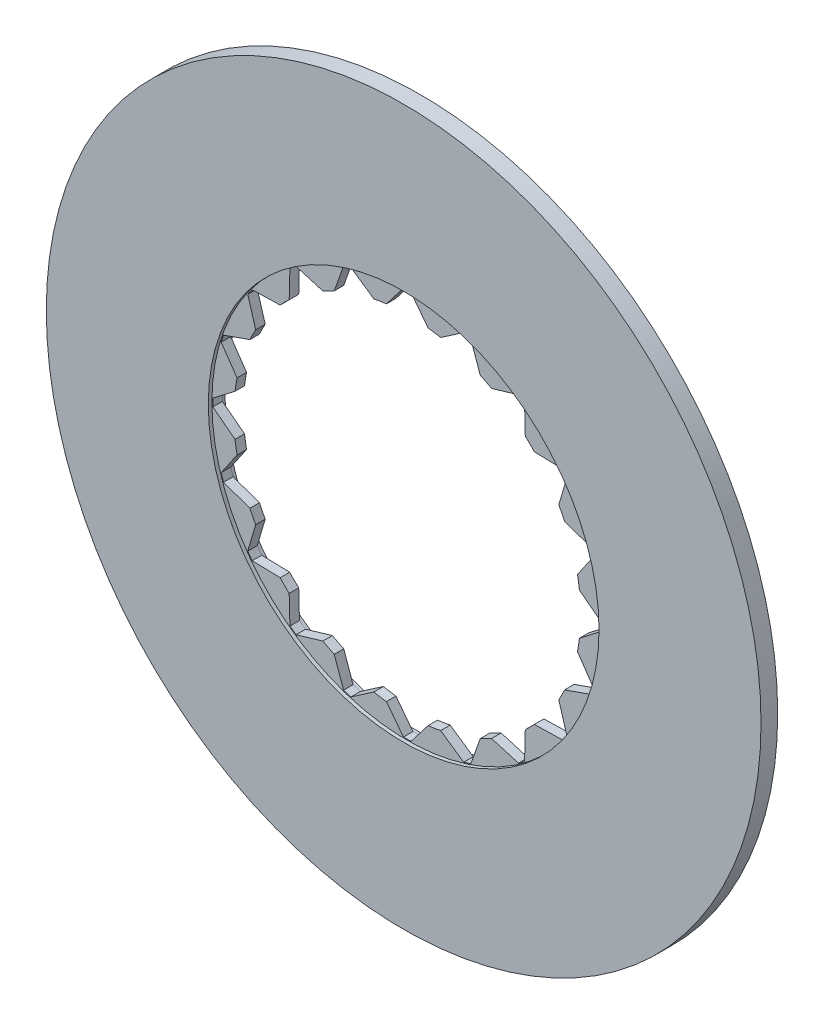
ISO-10303-21;
HEADER;
FILE_DESCRIPTION(('STEP AP214'),'2;1');
FILE_NAME('part.step','',(''),(''),'','','');
FILE_SCHEMA(('AUTOMOTIVE_DESIGN { 1 0 10303 214 1 1 1 1 }'));
ENDSEC;
DATA;
#1=APPLICATION_CONTEXT('core data for automotive mechanical design processes');
#2=APPLICATION_PROTOCOL_DEFINITION('international standard','automotive_design',2000,#1);
#3=PRODUCT_CONTEXT('',#1,'mechanical');
#4=PRODUCT('Part','Part','',(#3));
#5=PRODUCT_RELATED_PRODUCT_CATEGORY('part','',(#4));
#6=PRODUCT_DEFINITION_FORMATION('','',#4);
#7=PRODUCT_DEFINITION_CONTEXT('part definition',#1,'design');
#8=PRODUCT_DEFINITION('design','',#6,#7);
#9=PRODUCT_DEFINITION_SHAPE('','',#8);
#10=(LENGTH_UNIT() NAMED_UNIT(*) SI_UNIT(.MILLI.,.METRE.));
#11=(NAMED_UNIT(*) PLANE_ANGLE_UNIT() SI_UNIT($,.RADIAN.));
#12=(NAMED_UNIT(*) SI_UNIT($,.STERADIAN.) SOLID_ANGLE_UNIT());
#13=UNCERTAINTY_MEASURE_WITH_UNIT(LENGTH_MEASURE(1.E-05),#10,'distance_accuracy_value','');
#14=(GEOMETRIC_REPRESENTATION_CONTEXT(3) GLOBAL_UNCERTAINTY_ASSIGNED_CONTEXT((#13)) GLOBAL_UNIT_ASSIGNED_CONTEXT((#10,
#11,#12)) REPRESENTATION_CONTEXT('',''));
#15=CARTESIAN_POINT('',(0.,0.,0.));
#16=DIRECTION('',(0.,0.,1.));
#17=DIRECTION('',(1.,0.,0.));
#18=AXIS2_PLACEMENT_3D('',#15,#16,#17);
#19=CARTESIAN_POINT('',(0.,0.,-9.4999999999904));
#20=DIRECTION('',(0.,0.,0.999999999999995));
#21=DIRECTION('',(1.,0.,0.));
#22=AXIS2_PLACEMENT_3D('',#19,#20,#21);
#23=CYLINDRICAL_SURFACE('',#22,18.2);
#24=CARTESIAN_POINT('',(0.,0.,-0.499999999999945));
#25=DIRECTION('',(0.,0.,0.999999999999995));
#26=DIRECTION('',(1.,0.,0.));
#27=AXIS2_PLACEMENT_3D('',#24,#25,#26);
#28=CIRCLE('',#27,18.2);
#29=CARTESIAN_POINT('',(3.50665779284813,17.8589851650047,-0.499999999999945));
#30=VERTEX_POINT('',#29);
#31=CARTESIAN_POINT('',(2.18370017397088,18.0685210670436,-0.499999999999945));
#32=VERTEX_POINT('',#31);
#33=EDGE_CURVE('E580',#30,#32,#28,.T.);
#34=ORIENTED_EDGE('',*,*,#33,.F.);
#35=DIRECTION('',(0.,0.,0.999999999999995));
#36=VECTOR('',#35,1.);
#37=CARTESIAN_POINT('',(3.50665779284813,17.8589851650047,-9.49999999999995));
#38=LINE('',#37,#36);
#39=CARTESIAN_POINT('',(3.50665779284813,17.8589851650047,0.499999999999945));
#40=VERTEX_POINT('',#39);
#41=EDGE_CURVE('E771',#30,#40,#38,.T.);
#42=ORIENTED_EDGE('',*,*,#41,.T.);
#43=CARTESIAN_POINT('',(0.,0.,0.500000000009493));
#44=DIRECTION('',(0.,0.,0.999999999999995));
#45=DIRECTION('',(1.,0.,0.));
#46=AXIS2_PLACEMENT_3D('',#43,#44,#45);
#47=CIRCLE('',#46,18.2);
#48=CARTESIAN_POINT('',(2.18370017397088,18.0685210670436,0.499999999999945));
#49=VERTEX_POINT('',#48);
#50=EDGE_CURVE('E571',#40,#49,#47,.T.);
#51=ORIENTED_EDGE('',*,*,#50,.T.);
#52=DIRECTION('',(0.,0.,0.999999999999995));
#53=VECTOR('',#52,1.);
#54=CARTESIAN_POINT('',(2.18370017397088,18.0685210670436,-9.4999999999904));
#55=LINE('',#54,#53);
#56=EDGE_CURVE('E586',#49,#32,#55,.F.);
#57=ORIENTED_EDGE('',*,*,#56,.T.);
#58=EDGE_LOOP('',(#34,#42,#51,#57));
#59=FACE_BOUND('',#58,.T.);
#60=ADVANCED_FACE('F48',(#59),#23,.F.);
#61=CARTESIAN_POINT('',(8.85375966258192,15.9012873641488,0.499999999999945));
#62=VERTEX_POINT('',#61);
#63=CARTESIAN_POINT('',(7.6603023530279,16.5093842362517,0.499999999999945));
#64=VERTEX_POINT('',#63);
#65=EDGE_CURVE('E563',#62,#64,#47,.T.);
#66=ORIENTED_EDGE('',*,*,#65,.T.);
#67=DIRECTION('',(0.,0.,0.999999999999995));
#68=VECTOR('',#67,1.);
#69=CARTESIAN_POINT('',(7.6603023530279,16.5093842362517,-9.49999999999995));
#70=LINE('',#69,#68);
#71=CARTESIAN_POINT('',(7.6603023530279,16.5093842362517,-0.499999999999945));
#72=VERTEX_POINT('',#71);
#73=EDGE_CURVE('E545',#72,#64,#70,.T.);
#74=ORIENTED_EDGE('',*,*,#73,.F.);
#75=CARTESIAN_POINT('',(8.85375966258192,15.9012873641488,-0.499999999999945));
#76=VERTEX_POINT('',#75);
#77=EDGE_CURVE('E774',#76,#72,#28,.T.);
#78=ORIENTED_EDGE('',*,*,#77,.F.);
#79=DIRECTION('',(0.,0.,0.999999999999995));
#80=VECTOR('',#79,1.);
#81=CARTESIAN_POINT('',(8.85375966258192,15.9012873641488,-9.49999999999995));
#82=LINE('',#81,#80);
#83=EDGE_CURVE('E569',#76,#62,#82,.T.);
#84=ORIENTED_EDGE('',*,*,#83,.T.);
#85=EDGE_LOOP('',(#66,#74,#78,#84));
#86=FACE_BOUND('',#85,.T.);
#87=ADVANCED_FACE('F568',(#86),#23,.F.);
#88=CARTESIAN_POINT('',(13.3341938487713,12.3870607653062,0.499999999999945));
#89=VERTEX_POINT('',#88);
#90=CARTESIAN_POINT('',(12.3870607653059,13.3341938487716,0.499999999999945));
#91=VERTEX_POINT('',#90);
#92=EDGE_CURVE('E570',#89,#91,#47,.T.);
#93=ORIENTED_EDGE('',*,*,#92,.T.);
#94=DIRECTION('',(0.,0.,0.999999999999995));
#95=VECTOR('',#94,1.);
#96=CARTESIAN_POINT('',(12.3870607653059,13.3341938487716,-9.49999999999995));
#97=LINE('',#96,#95);
#98=CARTESIAN_POINT('',(12.3870607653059,13.3341938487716,-0.499999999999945));
#99=VERTEX_POINT('',#98);
#100=EDGE_CURVE('E1046',#99,#91,#97,.T.);
#101=ORIENTED_EDGE('',*,*,#100,.F.);
#102=CARTESIAN_POINT('',(13.3341938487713,12.3870607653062,-0.499999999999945));
#103=VERTEX_POINT('',#102);
#104=EDGE_CURVE('E775',#103,#99,#28,.T.);
#105=ORIENTED_EDGE('',*,*,#104,.F.);
#106=DIRECTION('',(0.,0.,0.999999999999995));
#107=VECTOR('',#106,1.);
#108=CARTESIAN_POINT('',(13.3341938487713,12.3870607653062,-9.49999999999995));
#109=LINE('',#108,#107);
#110=EDGE_CURVE('E1050',#103,#89,#109,.T.);
#111=ORIENTED_EDGE('',*,*,#110,.T.);
#112=EDGE_LOOP('',(#93,#101,#105,#111));
#113=FACE_BOUND('',#112,.T.);
#114=ADVANCED_FACE('F909',(#113),#23,.F.);
#115=CARTESIAN_POINT('',(16.5093842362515,7.66030235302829,0.499999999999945));
#116=VERTEX_POINT('',#115);
#117=CARTESIAN_POINT('',(15.9012873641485,8.85375966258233,0.499999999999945));
#118=VERTEX_POINT('',#117);
#119=EDGE_CURVE('E574',#116,#118,#47,.T.);
#120=ORIENTED_EDGE('',*,*,#119,.T.);
#121=DIRECTION('',(0.,0.,0.999999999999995));
#122=VECTOR('',#121,1.);
#123=CARTESIAN_POINT('',(15.9012873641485,8.85375966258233,-9.49999999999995));
#124=LINE('',#123,#122);
#125=CARTESIAN_POINT('',(15.9012873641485,8.85375966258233,-0.499999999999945));
#126=VERTEX_POINT('',#125);
#127=EDGE_CURVE('E1027',#126,#118,#124,.T.);
#128=ORIENTED_EDGE('',*,*,#127,.F.);
#129=CARTESIAN_POINT('',(16.5093842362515,7.66030235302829,-0.499999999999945));
#130=VERTEX_POINT('',#129);
#131=EDGE_CURVE('E777',#130,#126,#28,.T.);
#132=ORIENTED_EDGE('',*,*,#131,.F.);
#133=DIRECTION('',(0.,0.,0.999999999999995));
#134=VECTOR('',#133,1.);
#135=CARTESIAN_POINT('',(16.5093842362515,7.66030235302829,-9.49999999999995));
#136=LINE('',#135,#134);
#137=EDGE_CURVE('E1028',#130,#116,#136,.T.);
#138=ORIENTED_EDGE('',*,*,#137,.T.);
#139=EDGE_LOOP('',(#120,#128,#132,#138));
#140=FACE_BOUND('',#139,.T.);
#141=ADVANCED_FACE('F1026',(#140),#23,.F.);
#142=CARTESIAN_POINT('',(18.0685210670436,2.18370017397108,0.499999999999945));
#143=VERTEX_POINT('',#142);
#144=CARTESIAN_POINT('',(17.8589851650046,3.50665779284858,0.499999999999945));
#145=VERTEX_POINT('',#144);
#146=EDGE_CURVE('E1011',#143,#145,#47,.T.);
#147=ORIENTED_EDGE('',*,*,#146,.T.);
#148=DIRECTION('',(0.,0.,0.999999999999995));
#149=VECTOR('',#148,1.);
#150=CARTESIAN_POINT('',(17.8589851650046,3.50665779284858,-9.49999999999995));
#151=LINE('',#150,#149);
#152=CARTESIAN_POINT('',(17.8589851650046,3.50665779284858,-0.499999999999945));
#153=VERTEX_POINT('',#152);
#154=EDGE_CURVE('E1065',#153,#145,#151,.T.);
#155=ORIENTED_EDGE('',*,*,#154,.F.);
#156=CARTESIAN_POINT('',(18.0685210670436,2.18370017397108,-0.499999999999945));
#157=VERTEX_POINT('',#156);
#158=EDGE_CURVE('E780',#157,#153,#28,.T.);
#159=ORIENTED_EDGE('',*,*,#158,.F.);
#160=DIRECTION('',(0.,0.,0.999999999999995));
#161=VECTOR('',#160,1.);
#162=CARTESIAN_POINT('',(18.0685210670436,2.18370017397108,-9.49999999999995));
#163=LINE('',#162,#161);
#164=EDGE_CURVE('E1081',#157,#143,#163,.T.);
#165=ORIENTED_EDGE('',*,*,#164,.T.);
#166=EDGE_LOOP('',(#147,#155,#159,#165));
#167=FACE_BOUND('',#166,.T.);
#168=ADVANCED_FACE('F1558',(#167),#23,.F.);
#169=CARTESIAN_POINT('',(17.8589851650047,-3.5066577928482,0.499999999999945));
#170=VERTEX_POINT('',#169);
#171=CARTESIAN_POINT('',(18.0685210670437,-2.1837001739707,0.499999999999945));
#172=VERTEX_POINT('',#171);
#173=EDGE_CURVE('E1005',#170,#172,#47,.T.);
#174=ORIENTED_EDGE('',*,*,#173,.T.);
#175=DIRECTION('',(0.,0.,0.999999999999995));
#176=VECTOR('',#175,1.);
#177=CARTESIAN_POINT('',(18.0685210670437,-2.1837001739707,-9.49999999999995));
#178=LINE('',#177,#176);
#179=CARTESIAN_POINT('',(18.0685210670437,-2.1837001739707,-0.499999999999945));
#180=VERTEX_POINT('',#179);
#181=EDGE_CURVE('E1080',#180,#172,#178,.T.);
#182=ORIENTED_EDGE('',*,*,#181,.F.);
#183=CARTESIAN_POINT('',(17.8589851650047,-3.5066577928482,-0.499999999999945));
#184=VERTEX_POINT('',#183);
#185=EDGE_CURVE('E783',#184,#180,#28,.T.);
#186=ORIENTED_EDGE('',*,*,#185,.F.);
#187=DIRECTION('',(0.,0.,0.999999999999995));
#188=VECTOR('',#187,1.);
#189=CARTESIAN_POINT('',(17.8589851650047,-3.5066577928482,-9.49999999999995));
#190=LINE('',#189,#188);
#191=EDGE_CURVE('E1097',#184,#170,#190,.T.);
#192=ORIENTED_EDGE('',*,*,#191,.T.);
#193=EDGE_LOOP('',(#174,#182,#186,#192));
#194=FACE_BOUND('',#193,.T.);
#195=ADVANCED_FACE('F1562',(#194),#23,.F.);
#196=CARTESIAN_POINT('',(15.9012873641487,-8.85375966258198,0.499999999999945));
#197=VERTEX_POINT('',#196);
#198=CARTESIAN_POINT('',(16.5093842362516,-7.66030235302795,0.499999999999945));
#199=VERTEX_POINT('',#198);
#200=EDGE_CURVE('E999',#197,#199,#47,.T.);
#201=ORIENTED_EDGE('',*,*,#200,.T.);
#202=DIRECTION('',(0.,0.,0.999999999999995));
#203=VECTOR('',#202,1.);
#204=CARTESIAN_POINT('',(16.5093842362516,-7.66030235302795,-9.49999999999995));
#205=LINE('',#204,#203);
#206=CARTESIAN_POINT('',(16.5093842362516,-7.66030235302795,-0.499999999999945));
#207=VERTEX_POINT('',#206);
#208=EDGE_CURVE('E1096',#207,#199,#205,.T.);
#209=ORIENTED_EDGE('',*,*,#208,.F.);
#210=CARTESIAN_POINT('',(15.9012873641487,-8.85375966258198,-0.499999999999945));
#211=VERTEX_POINT('',#210);
#212=EDGE_CURVE('E786',#211,#207,#28,.T.);
#213=ORIENTED_EDGE('',*,*,#212,.F.);
#214=DIRECTION('',(0.,0.,0.999999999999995));
#215=VECTOR('',#214,1.);
#216=CARTESIAN_POINT('',(15.9012873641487,-8.85375966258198,-9.49999999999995));
#217=LINE('',#216,#215);
#218=EDGE_CURVE('E1113',#211,#197,#217,.T.);
#219=ORIENTED_EDGE('',*,*,#218,.T.);
#220=EDGE_LOOP('',(#201,#209,#213,#219));
#221=FACE_BOUND('',#220,.T.);
#222=ADVANCED_FACE('F1566',(#221),#23,.F.);
#223=CARTESIAN_POINT('',(12.3870607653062,-13.3341938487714,0.499999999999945));
#224=VERTEX_POINT('',#223);
#225=CARTESIAN_POINT('',(13.3341938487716,-12.387060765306,0.499999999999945));
#226=VERTEX_POINT('',#225);
#227=EDGE_CURVE('E993',#224,#226,#47,.T.);
#228=ORIENTED_EDGE('',*,*,#227,.T.);
#229=DIRECTION('',(0.,0.,0.999999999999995));
#230=VECTOR('',#229,1.);
#231=CARTESIAN_POINT('',(13.3341938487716,-12.387060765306,-9.49999999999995));
#232=LINE('',#231,#230);
#233=CARTESIAN_POINT('',(13.3341938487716,-12.387060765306,-0.499999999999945));
#234=VERTEX_POINT('',#233);
#235=EDGE_CURVE('E1112',#234,#226,#232,.T.);
#236=ORIENTED_EDGE('',*,*,#235,.F.);
#237=CARTESIAN_POINT('',(12.3870607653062,-13.3341938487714,-0.499999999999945));
#238=VERTEX_POINT('',#237);
#239=EDGE_CURVE('E789',#238,#234,#28,.T.);
#240=ORIENTED_EDGE('',*,*,#239,.F.);
#241=DIRECTION('',(0.,0.,0.999999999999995));
#242=VECTOR('',#241,1.);
#243=CARTESIAN_POINT('',(12.3870607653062,-13.3341938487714,-9.49999999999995));
#244=LINE('',#243,#242);
#245=EDGE_CURVE('E1129',#238,#224,#244,.T.);
#246=ORIENTED_EDGE('',*,*,#245,.T.);
#247=EDGE_LOOP('',(#228,#236,#240,#246));
#248=FACE_BOUND('',#247,.T.);
#249=ADVANCED_FACE('F1570',(#248),#23,.F.);
#250=CARTESIAN_POINT('',(7.66030235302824,-16.5093842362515,0.499999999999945));
#251=VERTEX_POINT('',#250);
#252=CARTESIAN_POINT('',(8.85375966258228,-15.9012873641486,0.499999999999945));
#253=VERTEX_POINT('',#252);
#254=EDGE_CURVE('E987',#251,#253,#47,.T.);
#255=ORIENTED_EDGE('',*,*,#254,.T.);
#256=DIRECTION('',(0.,0.,0.999999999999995));
#257=VECTOR('',#256,1.);
#258=CARTESIAN_POINT('',(8.85375966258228,-15.9012873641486,-9.49999999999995));
#259=LINE('',#258,#257);
#260=CARTESIAN_POINT('',(8.85375966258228,-15.9012873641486,-0.499999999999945));
#261=VERTEX_POINT('',#260);
#262=EDGE_CURVE('E1128',#261,#253,#259,.T.);
#263=ORIENTED_EDGE('',*,*,#262,.F.);
#264=CARTESIAN_POINT('',(7.66030235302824,-16.5093842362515,-0.499999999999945));
#265=VERTEX_POINT('',#264);
#266=EDGE_CURVE('E792',#265,#261,#28,.T.);
#267=ORIENTED_EDGE('',*,*,#266,.F.);
#268=DIRECTION('',(0.,0.,0.999999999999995));
#269=VECTOR('',#268,1.);
#270=CARTESIAN_POINT('',(7.66030235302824,-16.5093842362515,-9.49999999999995));
#271=LINE('',#270,#269);
#272=EDGE_CURVE('E1145',#265,#251,#271,.T.);
#273=ORIENTED_EDGE('',*,*,#272,.T.);
#274=EDGE_LOOP('',(#255,#263,#267,#273));
#275=FACE_BOUND('',#274,.T.);
#276=ADVANCED_FACE('F1574',(#275),#23,.F.);
#277=CARTESIAN_POINT('',(2.18370017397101,-18.0685210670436,0.499999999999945));
#278=VERTEX_POINT('',#277);
#279=CARTESIAN_POINT('',(3.50665779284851,-17.8589851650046,0.499999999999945));
#280=VERTEX_POINT('',#279);
#281=EDGE_CURVE('E981',#278,#280,#47,.T.);
#282=ORIENTED_EDGE('',*,*,#281,.T.);
#283=DIRECTION('',(0.,0.,0.999999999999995));
#284=VECTOR('',#283,1.);
#285=CARTESIAN_POINT('',(3.50665779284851,-17.8589851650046,-9.49999999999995));
#286=LINE('',#285,#284);
#287=CARTESIAN_POINT('',(3.50665779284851,-17.8589851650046,-0.499999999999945));
#288=VERTEX_POINT('',#287);
#289=EDGE_CURVE('E1144',#288,#280,#286,.T.);
#290=ORIENTED_EDGE('',*,*,#289,.F.);
#291=CARTESIAN_POINT('',(2.18370017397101,-18.0685210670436,-0.499999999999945));
#292=VERTEX_POINT('',#291);
#293=EDGE_CURVE('E795',#292,#288,#28,.T.);
#294=ORIENTED_EDGE('',*,*,#293,.F.);
#295=DIRECTION('',(0.,0.,0.999999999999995));
#296=VECTOR('',#295,1.);
#297=CARTESIAN_POINT('',(2.18370017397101,-18.0685210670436,-9.49999999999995));
#298=LINE('',#297,#296);
#299=EDGE_CURVE('E1161',#292,#278,#298,.T.);
#300=ORIENTED_EDGE('',*,*,#299,.T.);
#301=EDGE_LOOP('',(#282,#290,#294,#300));
#302=FACE_BOUND('',#301,.T.);
#303=ADVANCED_FACE('F1578',(#302),#23,.F.);
#304=CARTESIAN_POINT('',(-3.50665779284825,-17.8589851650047,0.499999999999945));
#305=VERTEX_POINT('',#304);
#306=CARTESIAN_POINT('',(-2.18370017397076,-18.0685210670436,0.499999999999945));
#307=VERTEX_POINT('',#306);
#308=EDGE_CURVE('E975',#305,#307,#47,.T.);
#309=ORIENTED_EDGE('',*,*,#308,.T.);
#310=DIRECTION('',(0.,0.,0.999999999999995));
#311=VECTOR('',#310,1.);
#312=CARTESIAN_POINT('',(-2.18370017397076,-18.0685210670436,-9.49999999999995));
#313=LINE('',#312,#311);
#314=CARTESIAN_POINT('',(-2.18370017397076,-18.0685210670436,-0.499999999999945));
#315=VERTEX_POINT('',#314);
#316=EDGE_CURVE('E1160',#315,#307,#313,.T.);
#317=ORIENTED_EDGE('',*,*,#316,.F.);
#318=CARTESIAN_POINT('',(-3.50665779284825,-17.8589851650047,-0.499999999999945));
#319=VERTEX_POINT('',#318);
#320=EDGE_CURVE('E798',#319,#315,#28,.T.);
#321=ORIENTED_EDGE('',*,*,#320,.F.);
#322=DIRECTION('',(0.,0.,0.999999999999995));
#323=VECTOR('',#322,1.);
#324=CARTESIAN_POINT('',(-3.50665779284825,-17.8589851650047,-9.49999999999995));
#325=LINE('',#324,#323);
#326=EDGE_CURVE('E1177',#319,#305,#325,.T.);
#327=ORIENTED_EDGE('',*,*,#326,.T.);
#328=EDGE_LOOP('',(#309,#317,#321,#327));
#329=FACE_BOUND('',#328,.T.);
#330=ADVANCED_FACE('F1582',(#329),#23,.F.);
#331=CARTESIAN_POINT('',(-8.85375966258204,-15.9012873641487,0.499999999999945));
#332=VERTEX_POINT('',#331);
#333=CARTESIAN_POINT('',(-7.660302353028,-16.5093842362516,0.499999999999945));
#334=VERTEX_POINT('',#333);
#335=EDGE_CURVE('E969',#332,#334,#47,.T.);
#336=ORIENTED_EDGE('',*,*,#335,.T.);
#337=DIRECTION('',(0.,0.,0.999999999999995));
#338=VECTOR('',#337,1.);
#339=CARTESIAN_POINT('',(-7.660302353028,-16.5093842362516,-9.49999999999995));
#340=LINE('',#339,#338);
#341=CARTESIAN_POINT('',(-7.660302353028,-16.5093842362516,-0.499999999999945));
#342=VERTEX_POINT('',#341);
#343=EDGE_CURVE('E1176',#342,#334,#340,.T.);
#344=ORIENTED_EDGE('',*,*,#343,.F.);
#345=CARTESIAN_POINT('',(-8.85375966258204,-15.9012873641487,-0.499999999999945));
#346=VERTEX_POINT('',#345);
#347=EDGE_CURVE('E801',#346,#342,#28,.T.);
#348=ORIENTED_EDGE('',*,*,#347,.F.);
#349=DIRECTION('',(0.,0.,0.999999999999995));
#350=VECTOR('',#349,1.);
#351=CARTESIAN_POINT('',(-8.85375966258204,-15.9012873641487,-9.49999999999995));
#352=LINE('',#351,#350);
#353=EDGE_CURVE('E1193',#346,#332,#352,.T.);
#354=ORIENTED_EDGE('',*,*,#353,.T.);
#355=EDGE_LOOP('',(#336,#344,#348,#354));
#356=FACE_BOUND('',#355,.T.);
#357=ADVANCED_FACE('F1586',(#356),#23,.F.);
#358=CARTESIAN_POINT('',(-13.3341938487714,-12.3870607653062,0.499999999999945));
#359=VERTEX_POINT('',#358);
#360=CARTESIAN_POINT('',(-12.387060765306,-13.3341938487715,0.499999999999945));
#361=VERTEX_POINT('',#360);
#362=EDGE_CURVE('E963',#359,#361,#47,.T.);
#363=ORIENTED_EDGE('',*,*,#362,.T.);
#364=DIRECTION('',(0.,0.,0.999999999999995));
#365=VECTOR('',#364,1.);
#366=CARTESIAN_POINT('',(-12.387060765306,-13.3341938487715,-9.49999999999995));
#367=LINE('',#366,#365);
#368=CARTESIAN_POINT('',(-12.387060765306,-13.3341938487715,-0.499999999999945));
#369=VERTEX_POINT('',#368);
#370=EDGE_CURVE('E1192',#369,#361,#367,.T.);
#371=ORIENTED_EDGE('',*,*,#370,.F.);
#372=CARTESIAN_POINT('',(-13.3341938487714,-12.3870607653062,-0.499999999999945));
#373=VERTEX_POINT('',#372);
#374=EDGE_CURVE('E804',#373,#369,#28,.T.);
#375=ORIENTED_EDGE('',*,*,#374,.F.);
#376=DIRECTION('',(0.,0.,0.999999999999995));
#377=VECTOR('',#376,1.);
#378=CARTESIAN_POINT('',(-13.3341938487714,-12.3870607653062,-9.49999999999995));
#379=LINE('',#378,#377);
#380=EDGE_CURVE('E1209',#373,#359,#379,.T.);
#381=ORIENTED_EDGE('',*,*,#380,.T.);
#382=EDGE_LOOP('',(#363,#371,#375,#381));
#383=FACE_BOUND('',#382,.T.);
#384=ADVANCED_FACE('F1590',(#383),#23,.F.);
#385=CARTESIAN_POINT('',(-16.5093842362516,-7.66030235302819,0.499999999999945));
#386=VERTEX_POINT('',#385);
#387=CARTESIAN_POINT('',(-15.9012873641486,-8.85375966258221,0.499999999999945));
#388=VERTEX_POINT('',#387);
#389=EDGE_CURVE('E957',#386,#388,#47,.T.);
#390=ORIENTED_EDGE('',*,*,#389,.T.);
#391=DIRECTION('',(0.,0.,0.999999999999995));
#392=VECTOR('',#391,1.);
#393=CARTESIAN_POINT('',(-15.9012873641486,-8.85375966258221,-9.49999999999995));
#394=LINE('',#393,#392);
#395=CARTESIAN_POINT('',(-15.9012873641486,-8.85375966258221,-0.499999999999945));
#396=VERTEX_POINT('',#395);
#397=EDGE_CURVE('E1208',#396,#388,#394,.T.);
#398=ORIENTED_EDGE('',*,*,#397,.F.);
#399=CARTESIAN_POINT('',(-16.5093842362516,-7.66030235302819,-0.499999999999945));
#400=VERTEX_POINT('',#399);
#401=EDGE_CURVE('E807',#400,#396,#28,.T.);
#402=ORIENTED_EDGE('',*,*,#401,.F.);
#403=DIRECTION('',(0.,0.,0.999999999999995));
#404=VECTOR('',#403,1.);
#405=CARTESIAN_POINT('',(-16.5093842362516,-7.66030235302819,-9.49999999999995));
#406=LINE('',#405,#404);
#407=EDGE_CURVE('E1225',#400,#386,#406,.T.);
#408=ORIENTED_EDGE('',*,*,#407,.T.);
#409=EDGE_LOOP('',(#390,#398,#402,#408));
#410=FACE_BOUND('',#409,.T.);
#411=ADVANCED_FACE('F1594',(#410),#23,.F.);
#412=CARTESIAN_POINT('',(-18.0685210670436,-2.18370017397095,0.499999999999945));
#413=VERTEX_POINT('',#412);
#414=CARTESIAN_POINT('',(-17.8589851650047,-3.50665779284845,0.499999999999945));
#415=VERTEX_POINT('',#414);
#416=EDGE_CURVE('E951',#413,#415,#47,.T.);
#417=ORIENTED_EDGE('',*,*,#416,.T.);
#418=DIRECTION('',(0.,0.,0.999999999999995));
#419=VECTOR('',#418,1.);
#420=CARTESIAN_POINT('',(-17.8589851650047,-3.50665779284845,-9.49999999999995));
#421=LINE('',#420,#419);
#422=CARTESIAN_POINT('',(-17.8589851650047,-3.50665779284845,-0.499999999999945));
#423=VERTEX_POINT('',#422);
#424=EDGE_CURVE('E1224',#423,#415,#421,.T.);
#425=ORIENTED_EDGE('',*,*,#424,.F.);
#426=CARTESIAN_POINT('',(-18.0685210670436,-2.18370017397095,-0.499999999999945));
#427=VERTEX_POINT('',#426);
#428=EDGE_CURVE('E810',#427,#423,#28,.T.);
#429=ORIENTED_EDGE('',*,*,#428,.F.);
#430=DIRECTION('',(0.,0.,0.999999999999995));
#431=VECTOR('',#430,1.);
#432=CARTESIAN_POINT('',(-18.0685210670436,-2.18370017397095,-9.49999999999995));
#433=LINE('',#432,#431);
#434=EDGE_CURVE('E1241',#427,#413,#433,.T.);
#435=ORIENTED_EDGE('',*,*,#434,.T.);
#436=EDGE_LOOP('',(#417,#425,#429,#435));
#437=FACE_BOUND('',#436,.T.);
#438=ADVANCED_FACE('F1598',(#437),#23,.F.);
#439=CARTESIAN_POINT('',(-17.8589851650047,3.50665779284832,0.499999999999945));
#440=VERTEX_POINT('',#439);
#441=CARTESIAN_POINT('',(-18.0685210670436,2.18370017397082,0.499999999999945));
#442=VERTEX_POINT('',#441);
#443=EDGE_CURVE('E946',#440,#442,#47,.T.);
#444=ORIENTED_EDGE('',*,*,#443,.T.);
#445=DIRECTION('',(0.,0.,0.999999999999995));
#446=VECTOR('',#445,1.);
#447=CARTESIAN_POINT('',(-18.0685210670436,2.18370017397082,-9.49999999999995));
#448=LINE('',#447,#446);
#449=CARTESIAN_POINT('',(-18.0685210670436,2.18370017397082,-0.499999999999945));
#450=VERTEX_POINT('',#449);
#451=EDGE_CURVE('E1240',#450,#442,#448,.T.);
#452=ORIENTED_EDGE('',*,*,#451,.F.);
#453=CARTESIAN_POINT('',(-17.8589851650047,3.50665779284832,-0.499999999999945));
#454=VERTEX_POINT('',#453);
#455=EDGE_CURVE('E813',#454,#450,#28,.T.);
#456=ORIENTED_EDGE('',*,*,#455,.F.);
#457=DIRECTION('',(0.,0.,0.999999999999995));
#458=VECTOR('',#457,1.);
#459=CARTESIAN_POINT('',(-17.8589851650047,3.50665779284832,-9.49999999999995));
#460=LINE('',#459,#458);
#461=EDGE_CURVE('E1257',#454,#440,#460,.T.);
#462=ORIENTED_EDGE('',*,*,#461,.T.);
#463=EDGE_LOOP('',(#444,#452,#456,#462));
#464=FACE_BOUND('',#463,.T.);
#465=ADVANCED_FACE('F934',(#464),#23,.F.);
#466=CARTESIAN_POINT('',(-15.9012873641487,8.85375966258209,0.499999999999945));
#467=VERTEX_POINT('',#466);
#468=CARTESIAN_POINT('',(-16.5093842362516,7.66030235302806,0.499999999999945));
#469=VERTEX_POINT('',#468);
#470=EDGE_CURVE('E944',#467,#469,#47,.T.);
#471=ORIENTED_EDGE('',*,*,#470,.T.);
#472=DIRECTION('',(0.,0.,0.999999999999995));
#473=VECTOR('',#472,1.);
#474=CARTESIAN_POINT('',(-16.5093842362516,7.66030235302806,-9.49999999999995));
#475=LINE('',#474,#473);
#476=CARTESIAN_POINT('',(-16.5093842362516,7.66030235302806,-0.499999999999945));
#477=VERTEX_POINT('',#476);
#478=EDGE_CURVE('E1256',#477,#469,#475,.T.);
#479=ORIENTED_EDGE('',*,*,#478,.F.);
#480=CARTESIAN_POINT('',(-15.9012873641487,8.85375966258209,-0.499999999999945));
#481=VERTEX_POINT('',#480);
#482=EDGE_CURVE('E816',#481,#477,#28,.T.);
#483=ORIENTED_EDGE('',*,*,#482,.F.);
#484=DIRECTION('',(0.,0.,0.999999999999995));
#485=VECTOR('',#484,1.);
#486=CARTESIAN_POINT('',(-15.9012873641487,8.85375966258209,-9.49999999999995));
#487=LINE('',#486,#485);
#488=EDGE_CURVE('E1272',#481,#467,#487,.T.);
#489=ORIENTED_EDGE('',*,*,#488,.T.);
#490=EDGE_LOOP('',(#471,#479,#483,#489));
#491=FACE_BOUND('',#490,.T.);
#492=ADVANCED_FACE('F929',(#491),#23,.F.);
#493=CARTESIAN_POINT('',(-12.3870607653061,13.3341938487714,0.499999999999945));
#494=VERTEX_POINT('',#493);
#495=CARTESIAN_POINT('',(-13.3341938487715,12.387060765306,0.499999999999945));
#496=VERTEX_POINT('',#495);
#497=EDGE_CURVE('E940',#494,#496,#47,.T.);
#498=ORIENTED_EDGE('',*,*,#497,.T.);
#499=DIRECTION('',(0.,0.,0.999999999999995));
#500=VECTOR('',#499,1.);
#501=CARTESIAN_POINT('',(-13.3341938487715,12.387060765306,-9.49999999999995));
#502=LINE('',#501,#500);
#503=CARTESIAN_POINT('',(-13.3341938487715,12.387060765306,-0.499999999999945));
#504=VERTEX_POINT('',#503);
#505=EDGE_CURVE('E941',#504,#496,#502,.T.);
#506=ORIENTED_EDGE('',*,*,#505,.F.);
#507=CARTESIAN_POINT('',(-12.3870607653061,13.3341938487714,-0.499999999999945));
#508=VERTEX_POINT('',#507);
#509=EDGE_CURVE('E819',#508,#504,#28,.T.);
#510=ORIENTED_EDGE('',*,*,#509,.F.);
#511=DIRECTION('',(0.,0.,0.999999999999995));
#512=VECTOR('',#511,1.);
#513=CARTESIAN_POINT('',(-12.3870607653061,13.3341938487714,-9.49999999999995));
#514=LINE('',#513,#512);
#515=EDGE_CURVE('E849',#508,#494,#514,.T.);
#516=ORIENTED_EDGE('',*,*,#515,.T.);
#517=EDGE_LOOP('',(#498,#506,#510,#516));
#518=FACE_BOUND('',#517,.T.);
#519=ADVANCED_FACE('F923',(#518),#23,.F.);
#520=CARTESIAN_POINT('',(-7.66030235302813,16.5093842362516,0.499999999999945));
#521=VERTEX_POINT('',#520);
#522=CARTESIAN_POINT('',(-8.85375966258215,15.9012873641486,0.499999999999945));
#523=VERTEX_POINT('',#522);
#524=EDGE_CURVE('E581',#521,#523,#47,.T.);
#525=ORIENTED_EDGE('',*,*,#524,.T.);
#526=DIRECTION('',(0.,0.,0.999999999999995));
#527=VECTOR('',#526,1.);
#528=CARTESIAN_POINT('',(-8.85375966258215,15.9012873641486,-9.49999999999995));
#529=LINE('',#528,#527);
#530=CARTESIAN_POINT('',(-8.85375966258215,15.9012873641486,-0.499999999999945));
#531=VERTEX_POINT('',#530);
#532=EDGE_CURVE('E832',#531,#523,#529,.T.);
#533=ORIENTED_EDGE('',*,*,#532,.F.);
#534=CARTESIAN_POINT('',(-7.66030235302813,16.5093842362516,-0.499999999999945));
#535=VERTEX_POINT('',#534);
#536=EDGE_CURVE('E587',#535,#531,#28,.T.);
#537=ORIENTED_EDGE('',*,*,#536,.F.);
#538=DIRECTION('',(0.,0.,0.999999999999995));
#539=VECTOR('',#538,1.);
#540=CARTESIAN_POINT('',(-7.66030235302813,16.5093842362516,-9.4999999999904));
#541=LINE('',#540,#539);
#542=EDGE_CURVE('E599',#535,#521,#541,.T.);
#543=ORIENTED_EDGE('',*,*,#542,.T.);
#544=EDGE_LOOP('',(#525,#533,#537,#543));
#545=FACE_BOUND('',#544,.T.);
#546=ADVANCED_FACE('F830',(#545),#23,.F.);
#547=CARTESIAN_POINT('',(0.,0.,0.499999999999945));
#548=DIRECTION('',(0.,0.,0.999999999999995));
#549=DIRECTION('',(1.,0.,0.));
#550=AXIS2_PLACEMENT_3D('',#547,#548,#549);
#551=PLANE('',#550);
#552=CARTESIAN_POINT('',(0.,0.,0.499999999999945));
#553=DIRECTION('',(0.,0.,0.999999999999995));
#554=DIRECTION('',(1.,0.,0.));
#555=AXIS2_PLACEMENT_3D('',#552,#553,#554);
#556=CIRCLE('',#555,20.5);
#557=CARTESIAN_POINT('',(-20.5,0.,0.499999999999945));
#558=VERTEX_POINT('',#557);
#559=EDGE_CURVE('E13',#558,#558,#556,.F.);
#560=ORIENTED_EDGE('',*,*,#559,.F.);
#561=EDGE_LOOP('',(#560));
#562=FACE_BOUND('',#561,.T.);
#563=DIRECTION('',(-0.824126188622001,-0.566406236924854,0.));
#564=VECTOR('',#563,1.);
#565=CARTESIAN_POINT('',(5.92454419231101,19.5207524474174,0.499999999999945));
#566=LINE('',#565,#564);
#567=CARTESIAN_POINT('',(5.92454419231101,19.5207524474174,0.499999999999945));
#568=VERTEX_POINT('',#567);
#569=EDGE_CURVE('E556',#568,#40,#566,.T.);
#570=ORIENTED_EDGE('',*,*,#569,.F.);
#571=CARTESIAN_POINT('',(0.,0.,0.499999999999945));
#572=DIRECTION('',(0.,0.,0.999999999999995));
#573=DIRECTION('',(0.951056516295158,-0.309016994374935,0.));
#574=AXIS2_PLACEMENT_3D('',#571,#572,#573);
#575=CIRCLE('',#574,20.4);
#576=CARTESIAN_POINT('',(6.68095346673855,19.2749801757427,0.499999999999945));
#577=VERTEX_POINT('',#576);
#578=EDGE_CURVE('E565',#577,#568,#575,.T.);
#579=ORIENTED_EDGE('',*,*,#578,.F.);
#580=DIRECTION('',(-0.333806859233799,0.942641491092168,0.));
#581=VECTOR('',#580,1.);
#582=CARTESIAN_POINT('',(6.68095346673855,19.2749801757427,0.499999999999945));
#583=LINE('',#582,#581);
#584=EDGE_CURVE('E548',#64,#577,#583,.T.);
#585=ORIENTED_EDGE('',*,*,#584,.F.);
#586=ORIENTED_EDGE('',*,*,#65,.F.);
#587=DIRECTION('',(-0.958819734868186,-0.284015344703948,0.));
#588=VECTOR('',#587,1.);
#589=CARTESIAN_POINT('',(11.6668206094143,16.7345539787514,0.499999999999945));
#590=LINE('',#589,#588);
#591=CARTESIAN_POINT('',(11.6668206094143,16.7345539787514,0.499999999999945));
#592=VERTEX_POINT('',#591);
#593=EDGE_CURVE('E1545',#592,#62,#590,.T.);
#594=ORIENTED_EDGE('',*,*,#593,.F.);
#595=CARTESIAN_POINT('',(0.,0.,0.499999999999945));
#596=DIRECTION('',(0.,0.,0.999999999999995));
#597=DIRECTION('',(0.809016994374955,-0.587785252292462,0.));
#598=AXIS2_PLACEMENT_3D('',#595,#596,#597);
#599=CIRCLE('',#598,20.4);
#600=CARTESIAN_POINT('',(12.3102607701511,16.2670673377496,0.499999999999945));
#601=VERTEX_POINT('',#600);
#602=EDGE_CURVE('E1542',#601,#592,#599,.T.);
#603=ORIENTED_EDGE('',*,*,#602,.F.);
#604=DIRECTION('',(-0.0261769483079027,0.999657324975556,0.));
#605=VECTOR('',#604,1.);
#606=CARTESIAN_POINT('',(12.3102607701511,16.2670673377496,0.499999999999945));
#607=LINE('',#606,#605);
#608=EDGE_CURVE('E1537',#91,#601,#607,.T.);
#609=ORIENTED_EDGE('',*,*,#608,.F.);
#610=ORIENTED_EDGE('',*,*,#92,.F.);
#611=DIRECTION('',(-0.999657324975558,0.0261769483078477,0.));
#612=VECTOR('',#611,1.);
#613=CARTESIAN_POINT('',(16.2670673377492,12.3102607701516,0.499999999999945));
#614=LINE('',#613,#612);
#615=CARTESIAN_POINT('',(16.2670673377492,12.3102607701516,0.499999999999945));
#616=VERTEX_POINT('',#615);
#617=EDGE_CURVE('E1041',#616,#89,#614,.T.);
#618=ORIENTED_EDGE('',*,*,#617,.F.);
#619=CARTESIAN_POINT('',(0.,0.,0.499999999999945));
#620=DIRECTION('',(0.,0.,0.999999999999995));
#621=DIRECTION('',(0.587785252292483,-0.80901699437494,0.));
#622=AXIS2_PLACEMENT_3D('',#619,#620,#621);
#623=CIRCLE('',#622,20.4);
#624=CARTESIAN_POINT('',(16.734553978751,11.6668206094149,0.499999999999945));
#625=VERTEX_POINT('',#624);
#626=EDGE_CURVE('E1038',#625,#616,#623,.T.);
#627=ORIENTED_EDGE('',*,*,#626,.F.);
#628=DIRECTION('',(0.284015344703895,0.958819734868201,0.));
#629=VECTOR('',#628,1.);
#630=CARTESIAN_POINT('',(16.734553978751,11.6668206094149,0.499999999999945));
#631=LINE('',#630,#629);
#632=EDGE_CURVE('E1035',#118,#625,#631,.T.);
#633=ORIENTED_EDGE('',*,*,#632,.F.);
#634=ORIENTED_EDGE('',*,*,#119,.F.);
#635=DIRECTION('',(-0.942641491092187,0.333806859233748,0.));
#636=VECTOR('',#635,1.);
#637=CARTESIAN_POINT('',(19.2749801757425,6.68095346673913,0.499999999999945));
#638=LINE('',#637,#636);
#639=CARTESIAN_POINT('',(19.2749801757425,6.68095346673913,0.499999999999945));
#640=VERTEX_POINT('',#639);
#641=EDGE_CURVE('E1032',#640,#116,#638,.T.);
#642=ORIENTED_EDGE('',*,*,#641,.F.);
#643=CARTESIAN_POINT('',(0.,0.,0.499999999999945));
#644=DIRECTION('',(0.,0.,0.999999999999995));
#645=DIRECTION('',(0.309016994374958,-0.95105651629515,0.));
#646=AXIS2_PLACEMENT_3D('',#643,#644,#645);
#647=CIRCLE('',#646,20.4);
#648=CARTESIAN_POINT('',(19.5207524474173,5.92454419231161,0.499999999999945));
#649=VERTEX_POINT('',#648);
#650=EDGE_CURVE('E1061',#649,#640,#647,.T.);
#651=ORIENTED_EDGE('',*,*,#650,.F.);
#652=DIRECTION('',(0.566406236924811,0.824126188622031,0.));
#653=VECTOR('',#652,1.);
#654=CARTESIAN_POINT('',(19.5207524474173,5.92454419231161,0.499999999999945));
#655=LINE('',#654,#653);
#656=EDGE_CURVE('E1053',#145,#649,#655,.T.);
#657=ORIENTED_EDGE('',*,*,#656,.F.);
#658=ORIENTED_EDGE('',*,*,#146,.F.);
#659=DIRECTION('',(-0.793353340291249,0.608761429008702,0.));
#660=VECTOR('',#659,1.);
#661=CARTESIAN_POINT('',(20.3961236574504,0.397667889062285,0.499999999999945));
#662=LINE('',#661,#660);
#663=CARTESIAN_POINT('',(20.3961236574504,0.397667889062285,0.499999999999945));
#664=VERTEX_POINT('',#663);
#665=EDGE_CURVE('E1078',#664,#143,#662,.T.);
#666=ORIENTED_EDGE('',*,*,#665,.F.);
#667=CARTESIAN_POINT('',(0.,0.,0.499999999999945));
#668=DIRECTION('',(0.,0.,0.999999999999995));
#669=DIRECTION('',(0.,-1.,0.));
#670=AXIS2_PLACEMENT_3D('',#667,#668,#669);
#671=CIRCLE('',#670,20.4);
#672=CARTESIAN_POINT('',(20.3961236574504,-0.397667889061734,0.499999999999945));
#673=VERTEX_POINT('',#672);
#674=EDGE_CURVE('E1075',#673,#664,#671,.T.);
#675=ORIENTED_EDGE('',*,*,#674,.F.);
#676=DIRECTION('',(0.793353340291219,0.608761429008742,0.));
#677=VECTOR('',#676,1.);
#678=CARTESIAN_POINT('',(20.3961236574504,-0.397667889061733,0.499999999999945));
#679=LINE('',#678,#677);
#680=EDGE_CURVE('E1067',#172,#673,#679,.T.);
#681=ORIENTED_EDGE('',*,*,#680,.F.);
#682=ORIENTED_EDGE('',*,*,#173,.F.);
#683=DIRECTION('',(-0.566406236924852,0.824126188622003,0.));
#684=VECTOR('',#683,1.);
#685=CARTESIAN_POINT('',(19.5207524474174,-5.92454419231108,0.499999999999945));
#686=LINE('',#685,#684);
#687=CARTESIAN_POINT('',(19.5207524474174,-5.92454419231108,0.499999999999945));
#688=VERTEX_POINT('',#687);
#689=EDGE_CURVE('E1094',#688,#170,#686,.T.);
#690=ORIENTED_EDGE('',*,*,#689,.F.);
#691=CARTESIAN_POINT('',(0.,0.,0.499999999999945));
#692=DIRECTION('',(0.,0.,0.999999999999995));
#693=DIRECTION('',(-0.309016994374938,-0.951056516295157,0.));
#694=AXIS2_PLACEMENT_3D('',#691,#692,#693);
#695=CIRCLE('',#694,20.4);
#696=CARTESIAN_POINT('',(19.2749801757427,-6.68095346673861,0.499999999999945));
#697=VERTEX_POINT('',#696);
#698=EDGE_CURVE('E1091',#697,#688,#695,.T.);
#699=ORIENTED_EDGE('',*,*,#698,.F.);
#700=DIRECTION('',(0.94264149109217,0.333806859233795,0.));
#701=VECTOR('',#700,1.);
#702=CARTESIAN_POINT('',(19.2749801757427,-6.68095346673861,0.499999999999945));
#703=LINE('',#702,#701);
#704=EDGE_CURVE('E1083',#199,#697,#703,.T.);
#705=ORIENTED_EDGE('',*,*,#704,.F.);
#706=ORIENTED_EDGE('',*,*,#200,.F.);
#707=DIRECTION('',(-0.284015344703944,0.958819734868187,0.));
#708=VECTOR('',#707,1.);
#709=CARTESIAN_POINT('',(16.7345539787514,-11.6668206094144,0.499999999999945));
#710=LINE('',#709,#708);
#711=CARTESIAN_POINT('',(16.7345539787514,-11.6668206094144,0.499999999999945));
#712=VERTEX_POINT('',#711);
#713=EDGE_CURVE('E1110',#712,#197,#710,.T.);
#714=ORIENTED_EDGE('',*,*,#713,.F.);
#715=CARTESIAN_POINT('',(0.,0.,0.499999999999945));
#716=DIRECTION('',(0.,0.,0.999999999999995));
#717=DIRECTION('',(-0.587785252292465,-0.809016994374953,0.));
#718=AXIS2_PLACEMENT_3D('',#715,#716,#717);
#719=CIRCLE('',#718,20.4);
#720=CARTESIAN_POINT('',(16.2670673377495,-12.3102607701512,0.499999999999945));
#721=VERTEX_POINT('',#720);
#722=EDGE_CURVE('E1107',#721,#712,#719,.T.);
#723=ORIENTED_EDGE('',*,*,#722,.F.);
#724=DIRECTION('',(0.999657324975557,0.0261769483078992,0.));
#725=VECTOR('',#724,1.);
#726=CARTESIAN_POINT('',(16.2670673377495,-12.3102607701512,0.499999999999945));
#727=LINE('',#726,#725);
#728=EDGE_CURVE('E1099',#226,#721,#727,.T.);
#729=ORIENTED_EDGE('',*,*,#728,.F.);
#730=ORIENTED_EDGE('',*,*,#227,.F.);
#731=DIRECTION('',(0.0261769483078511,0.999657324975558,0.));
#732=VECTOR('',#731,1.);
#733=CARTESIAN_POINT('',(12.3102607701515,-16.2670673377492,0.499999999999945));
#734=LINE('',#733,#732);
#735=CARTESIAN_POINT('',(12.3102607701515,-16.2670673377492,0.499999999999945));
#736=VERTEX_POINT('',#735);
#737=EDGE_CURVE('E1126',#736,#224,#734,.T.);
#738=ORIENTED_EDGE('',*,*,#737,.F.);
#739=CARTESIAN_POINT('',(0.,0.,0.499999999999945));
#740=DIRECTION('',(0.,0.,0.999999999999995));
#741=DIRECTION('',(-0.809016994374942,-0.58778525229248,0.));
#742=AXIS2_PLACEMENT_3D('',#739,#740,#741);
#743=CIRCLE('',#742,20.4);
#744=CARTESIAN_POINT('',(11.6668206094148,-16.7345539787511,0.499999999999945));
#745=VERTEX_POINT('',#744);
#746=EDGE_CURVE('E1123',#745,#736,#743,.T.);
#747=ORIENTED_EDGE('',*,*,#746,.F.);
#748=DIRECTION('',(0.9588197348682,-0.284015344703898,0.));
#749=VECTOR('',#748,1.);
#750=CARTESIAN_POINT('',(11.6668206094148,-16.7345539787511,0.499999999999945));
#751=LINE('',#750,#749);
#752=EDGE_CURVE('E1115',#253,#745,#751,.T.);
#753=ORIENTED_EDGE('',*,*,#752,.F.);
#754=ORIENTED_EDGE('',*,*,#254,.F.);
#755=DIRECTION('',(0.333806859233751,0.942641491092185,0.));
#756=VECTOR('',#755,1.);
#757=CARTESIAN_POINT('',(6.68095346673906,-19.2749801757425,0.499999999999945));
#758=LINE('',#757,#756);
#759=CARTESIAN_POINT('',(6.68095346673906,-19.2749801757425,0.499999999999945));
#760=VERTEX_POINT('',#759);
#761=EDGE_CURVE('E1142',#760,#251,#758,.T.);
#762=ORIENTED_EDGE('',*,*,#761,.F.);
#763=CARTESIAN_POINT('',(0.,0.,0.499999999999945));
#764=DIRECTION('',(0.,0.,0.999999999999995));
#765=DIRECTION('',(-0.951056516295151,-0.309016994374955,0.));
#766=AXIS2_PLACEMENT_3D('',#763,#764,#765);
#767=CIRCLE('',#766,20.4);
#768=CARTESIAN_POINT('',(5.92454419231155,-19.5207524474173,0.499999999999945));
#769=VERTEX_POINT('',#768);
#770=EDGE_CURVE('E1139',#769,#760,#767,.T.);
#771=ORIENTED_EDGE('',*,*,#770,.F.);
#772=DIRECTION('',(0.824126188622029,-0.566406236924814,0.));
#773=VECTOR('',#772,1.);
#774=CARTESIAN_POINT('',(5.92454419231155,-19.5207524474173,0.499999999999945));
#775=LINE('',#774,#773);
#776=EDGE_CURVE('E1131',#280,#769,#775,.T.);
#777=ORIENTED_EDGE('',*,*,#776,.F.);
#778=ORIENTED_EDGE('',*,*,#281,.F.);
#779=DIRECTION('',(0.608761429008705,0.793353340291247,0.));
#780=VECTOR('',#779,1.);
#781=CARTESIAN_POINT('',(0.397667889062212,-20.3961236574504,0.499999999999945));
#782=LINE('',#781,#780);
#783=CARTESIAN_POINT('',(0.397667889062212,-20.3961236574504,0.499999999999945));
#784=VERTEX_POINT('',#783);
#785=EDGE_CURVE('E1158',#784,#278,#782,.T.);
#786=ORIENTED_EDGE('',*,*,#785,.F.);
#787=CARTESIAN_POINT('',(0.,0.,0.499999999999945));
#788=DIRECTION('',(0.,0.,0.999999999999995));
#789=DIRECTION('',(-1.,0.,0.));
#790=AXIS2_PLACEMENT_3D('',#787,#788,#789);
#791=CIRCLE('',#790,20.4);
#792=CARTESIAN_POINT('',(-0.397667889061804,-20.3961236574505,0.499999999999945));
#793=VERTEX_POINT('',#792);
#794=EDGE_CURVE('E1155',#793,#784,#791,.T.);
#795=ORIENTED_EDGE('',*,*,#794,.F.);
#796=DIRECTION('',(0.608761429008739,-0.793353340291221,0.));
#797=VECTOR('',#796,1.);
#798=CARTESIAN_POINT('',(-0.397667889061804,-20.3961236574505,0.499999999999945));
#799=LINE('',#798,#797);
#800=EDGE_CURVE('E1147',#307,#793,#799,.T.);
#801=ORIENTED_EDGE('',*,*,#800,.F.);
#802=ORIENTED_EDGE('',*,*,#308,.F.);
#803=DIRECTION('',(0.824126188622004,0.566406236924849,0.));
#804=VECTOR('',#803,1.);
#805=CARTESIAN_POINT('',(-5.92454419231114,-19.5207524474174,0.499999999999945));
#806=LINE('',#805,#804);
#807=CARTESIAN_POINT('',(-5.92454419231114,-19.5207524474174,0.499999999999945));
#808=VERTEX_POINT('',#807);
#809=EDGE_CURVE('E1174',#808,#305,#806,.T.);
#810=ORIENTED_EDGE('',*,*,#809,.F.);
#811=CARTESIAN_POINT('',(0.,0.,0.499999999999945));
#812=DIRECTION('',(0.,0.,0.999999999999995));
#813=DIRECTION('',(-0.951056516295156,0.309016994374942,0.));
#814=AXIS2_PLACEMENT_3D('',#811,#812,#813);
#815=CIRCLE('',#814,20.4);
#816=CARTESIAN_POINT('',(-6.68095346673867,-19.2749801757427,0.499999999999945));
#817=VERTEX_POINT('',#816);
#818=EDGE_CURVE('E1171',#817,#808,#815,.T.);
#819=ORIENTED_EDGE('',*,*,#818,.F.);
#820=DIRECTION('',(0.333806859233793,-0.942641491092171,0.));
#821=VECTOR('',#820,1.);
#822=CARTESIAN_POINT('',(-6.68095346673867,-19.2749801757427,0.499999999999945));
#823=LINE('',#822,#821);
#824=EDGE_CURVE('E1163',#334,#817,#823,.T.);
#825=ORIENTED_EDGE('',*,*,#824,.F.);
#826=ORIENTED_EDGE('',*,*,#335,.F.);
#827=DIRECTION('',(0.958819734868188,0.284015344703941,0.));
#828=VECTOR('',#827,1.);
#829=CARTESIAN_POINT('',(-11.6668206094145,-16.7345539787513,0.499999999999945));
#830=LINE('',#829,#828);
#831=CARTESIAN_POINT('',(-11.6668206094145,-16.7345539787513,0.499999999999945));
#832=VERTEX_POINT('',#831);
#833=EDGE_CURVE('E1190',#832,#332,#830,.T.);
#834=ORIENTED_EDGE('',*,*,#833,.F.);
#835=CARTESIAN_POINT('',(0.,0.,0.499999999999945));
#836=DIRECTION('',(0.,0.,0.999999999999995));
#837=DIRECTION('',(-0.809016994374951,0.587785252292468,0.));
#838=AXIS2_PLACEMENT_3D('',#835,#836,#837);
#839=CIRCLE('',#838,20.4);
#840=CARTESIAN_POINT('',(-12.3102607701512,-16.2670673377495,0.499999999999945));
#841=VERTEX_POINT('',#840);
#842=EDGE_CURVE('E1187',#841,#832,#839,.T.);
#843=ORIENTED_EDGE('',*,*,#842,.F.);
#844=DIRECTION('',(0.0261769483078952,-0.999657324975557,0.));
#845=VECTOR('',#844,1.);
#846=CARTESIAN_POINT('',(-12.3102607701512,-16.2670673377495,0.499999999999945));
#847=LINE('',#846,#845);
#848=EDGE_CURVE('E1179',#361,#841,#847,.T.);
#849=ORIENTED_EDGE('',*,*,#848,.F.);
#850=ORIENTED_EDGE('',*,*,#362,.F.);
#851=DIRECTION('',(0.999657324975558,-0.0261769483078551,0.));
#852=VECTOR('',#851,1.);
#853=CARTESIAN_POINT('',(-16.2670673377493,-12.3102607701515,0.499999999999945));
#854=LINE('',#853,#852);
#855=CARTESIAN_POINT('',(-16.2670673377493,-12.3102607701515,0.499999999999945));
#856=VERTEX_POINT('',#855);
#857=EDGE_CURVE('E1206',#856,#359,#854,.T.);
#858=ORIENTED_EDGE('',*,*,#857,.F.);
#859=CARTESIAN_POINT('',(0.,0.,0.499999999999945));
#860=DIRECTION('',(0.,0.,0.999999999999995));
#861=DIRECTION('',(-0.587785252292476,0.809016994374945,0.));
#862=AXIS2_PLACEMENT_3D('',#859,#860,#861);
#863=CIRCLE('',#862,20.4);
#864=CARTESIAN_POINT('',(-16.7345539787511,-11.6668206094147,0.499999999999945));
#865=VERTEX_POINT('',#864);
#866=EDGE_CURVE('E1203',#865,#856,#863,.T.);
#867=ORIENTED_EDGE('',*,*,#866,.F.);
#868=DIRECTION('',(-0.284015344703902,-0.958819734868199,0.));
#869=VECTOR('',#868,1.);
#870=CARTESIAN_POINT('',(-16.7345539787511,-11.6668206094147,0.499999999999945));
#871=LINE('',#870,#869);
#872=EDGE_CURVE('E1195',#388,#865,#871,.T.);
#873=ORIENTED_EDGE('',*,*,#872,.F.);
#874=ORIENTED_EDGE('',*,*,#389,.F.);
#875=DIRECTION('',(0.942641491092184,-0.333806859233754,0.));
#876=VECTOR('',#875,1.);
#877=CARTESIAN_POINT('',(-19.2749801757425,-6.68095346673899,0.499999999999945));
#878=LINE('',#877,#876);
#879=CARTESIAN_POINT('',(-19.2749801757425,-6.68095346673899,0.499999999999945));
#880=VERTEX_POINT('',#879);
#881=EDGE_CURVE('E1222',#880,#386,#878,.T.);
#882=ORIENTED_EDGE('',*,*,#881,.F.);
#883=CARTESIAN_POINT('',(0.,0.,0.499999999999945));
#884=DIRECTION('',(0.,0.,0.999999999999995));
#885=DIRECTION('',(-0.309016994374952,0.951056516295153,0.));
#886=AXIS2_PLACEMENT_3D('',#883,#884,#885);
#887=CIRCLE('',#886,20.4);
#888=CARTESIAN_POINT('',(-19.5207524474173,-5.92454419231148,0.499999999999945));
#889=VERTEX_POINT('',#888);
#890=EDGE_CURVE('E1219',#889,#880,#887,.T.);
#891=ORIENTED_EDGE('',*,*,#890,.F.);
#892=DIRECTION('',(-0.566406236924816,-0.824126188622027,0.));
#893=VECTOR('',#892,1.);
#894=CARTESIAN_POINT('',(-19.5207524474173,-5.92454419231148,0.499999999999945));
#895=LINE('',#894,#893);
#896=EDGE_CURVE('E1211',#415,#889,#895,.T.);
#897=ORIENTED_EDGE('',*,*,#896,.F.);
#898=ORIENTED_EDGE('',*,*,#416,.F.);
#899=DIRECTION('',(0.793353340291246,-0.608761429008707,0.));
#900=VECTOR('',#899,1.);
#901=CARTESIAN_POINT('',(-20.3961236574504,-0.397667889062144,0.499999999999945));
#902=LINE('',#901,#900);
#903=CARTESIAN_POINT('',(-20.3961236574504,-0.397667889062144,0.499999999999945));
#904=VERTEX_POINT('',#903);
#905=EDGE_CURVE('E1238',#904,#413,#902,.T.);
#906=ORIENTED_EDGE('',*,*,#905,.F.);
#907=CARTESIAN_POINT('',(0.,0.,0.499999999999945));
#908=DIRECTION('',(0.,0.,0.999999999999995));
#909=DIRECTION('',(0.,1.,0.));
#910=AXIS2_PLACEMENT_3D('',#907,#908,#909);
#911=CIRCLE('',#910,20.4);
#912=CARTESIAN_POINT('',(-20.3961236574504,0.397667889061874,0.499999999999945));
#913=VERTEX_POINT('',#912);
#914=EDGE_CURVE('E1235',#913,#904,#911,.T.);
#915=ORIENTED_EDGE('',*,*,#914,.F.);
#916=DIRECTION('',(-0.793353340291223,-0.608761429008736,0.));
#917=VECTOR('',#916,1.);
#918=CARTESIAN_POINT('',(-20.3961236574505,0.397667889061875,0.499999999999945));
#919=LINE('',#918,#917);
#920=EDGE_CURVE('E1227',#442,#913,#919,.T.);
#921=ORIENTED_EDGE('',*,*,#920,.F.);
#922=ORIENTED_EDGE('',*,*,#443,.F.);
#923=DIRECTION('',(0.566406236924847,-0.824126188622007,0.));
#924=VECTOR('',#923,1.);
#925=CARTESIAN_POINT('',(-19.5207524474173,5.92454419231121,0.499999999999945));
#926=LINE('',#925,#924);
#927=CARTESIAN_POINT('',(-19.5207524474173,5.92454419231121,0.499999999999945));
#928=VERTEX_POINT('',#927);
#929=EDGE_CURVE('E1254',#928,#440,#926,.T.);
#930=ORIENTED_EDGE('',*,*,#929,.F.);
#931=CARTESIAN_POINT('',(0.,0.,0.499999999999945));
#932=DIRECTION('',(0.,0.,0.999999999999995));
#933=DIRECTION('',(0.309016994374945,0.951056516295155,0.));
#934=AXIS2_PLACEMENT_3D('',#931,#932,#933);
#935=CIRCLE('',#934,20.4);
#936=CARTESIAN_POINT('',(-19.2749801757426,6.68095346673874,0.499999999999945));
#937=VERTEX_POINT('',#936);
#938=EDGE_CURVE('E1251',#937,#928,#935,.T.);
#939=ORIENTED_EDGE('',*,*,#938,.F.);
#940=DIRECTION('',(-0.942641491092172,-0.333806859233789,0.));
#941=VECTOR('',#940,1.);
#942=CARTESIAN_POINT('',(-19.2749801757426,6.68095346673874,0.499999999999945));
#943=LINE('',#942,#941);
#944=EDGE_CURVE('E1243',#469,#937,#943,.T.);
#945=ORIENTED_EDGE('',*,*,#944,.F.);
#946=ORIENTED_EDGE('',*,*,#470,.F.);
#947=DIRECTION('',(0.284015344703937,-0.958819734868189,0.));
#948=VECTOR('',#947,1.);
#949=CARTESIAN_POINT('',(-16.7345539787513,11.6668206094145,0.499999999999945));
#950=LINE('',#949,#948);
#951=CARTESIAN_POINT('',(-16.7345539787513,11.6668206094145,0.499999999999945));
#952=VERTEX_POINT('',#951);
#953=EDGE_CURVE('E1270',#952,#467,#950,.T.);
#954=ORIENTED_EDGE('',*,*,#953,.F.);
#955=CARTESIAN_POINT('',(0.,0.,0.499999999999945));
#956=DIRECTION('',(0.,0.,0.999999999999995));
#957=DIRECTION('',(0.587785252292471,0.809016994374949,0.));
#958=AXIS2_PLACEMENT_3D('',#955,#956,#957);
#959=CIRCLE('',#958,20.4);
#960=CARTESIAN_POINT('',(-16.2670673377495,12.3102607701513,0.499999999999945));
#961=VERTEX_POINT('',#960);
#962=EDGE_CURVE('E1267',#961,#952,#959,.T.);
#963=ORIENTED_EDGE('',*,*,#962,.F.);
#964=DIRECTION('',(-0.999657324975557,-0.0261769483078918,0.));
#965=VECTOR('',#964,1.);
#966=CARTESIAN_POINT('',(-16.2670673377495,12.3102607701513,0.499999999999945));
#967=LINE('',#966,#965);
#968=EDGE_CURVE('E1259',#496,#961,#967,.T.);
#969=ORIENTED_EDGE('',*,*,#968,.F.);
#970=ORIENTED_EDGE('',*,*,#497,.F.);
#971=DIRECTION('',(-0.0261769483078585,-0.999657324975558,0.));
#972=VECTOR('',#971,1.);
#973=CARTESIAN_POINT('',(-12.3102607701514,16.2670673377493,0.499999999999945));
#974=LINE('',#973,#972);
#975=CARTESIAN_POINT('',(-12.3102607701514,16.2670673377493,0.499999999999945));
#976=VERTEX_POINT('',#975);
#977=EDGE_CURVE('E837',#976,#494,#974,.T.);
#978=ORIENTED_EDGE('',*,*,#977,.F.);
#979=CARTESIAN_POINT('',(0.,0.,0.499999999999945));
#980=DIRECTION('',(0.,0.,0.999999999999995));
#981=DIRECTION('',(0.809016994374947,0.587785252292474,0.));
#982=AXIS2_PLACEMENT_3D('',#979,#980,#981);
#983=CIRCLE('',#982,20.4);
#984=CARTESIAN_POINT('',(-11.6668206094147,16.7345539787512,0.499999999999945));
#985=VERTEX_POINT('',#984);
#986=EDGE_CURVE('E841',#985,#976,#983,.T.);
#987=ORIENTED_EDGE('',*,*,#986,.F.);
#988=DIRECTION('',(-0.958819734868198,0.284015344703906,0.));
#989=VECTOR('',#988,1.);
#990=CARTESIAN_POINT('',(-11.6668206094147,16.7345539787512,0.499999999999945));
#991=LINE('',#990,#989);
#992=EDGE_CURVE('E1274',#523,#985,#991,.T.);
#993=ORIENTED_EDGE('',*,*,#992,.F.);
#994=ORIENTED_EDGE('',*,*,#524,.F.);
#995=DIRECTION('',(-0.333806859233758,-0.942641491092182,0.));
#996=VECTOR('',#995,1.);
#997=CARTESIAN_POINT('',(-6.68095346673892,19.2749801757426,0.499999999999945));
#998=LINE('',#997,#996);
#999=CARTESIAN_POINT('',(-6.68095346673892,19.2749801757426,0.499999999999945));
#1000=VERTEX_POINT('',#999);
#1001=EDGE_CURVE('E852',#1000,#521,#998,.T.);
#1002=ORIENTED_EDGE('',*,*,#1001,.F.);
#1003=CARTESIAN_POINT('',(0.,0.,0.499999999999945));
#1004=DIRECTION('',(0.,0.,0.999999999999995));
#1005=DIRECTION('',(0.951056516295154,0.309016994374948,0.));
#1006=AXIS2_PLACEMENT_3D('',#1003,#1004,#1005);
#1007=CIRCLE('',#1006,20.4);
#1008=CARTESIAN_POINT('',(-5.92454419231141,19.5207524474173,0.499999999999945));
#1009=VERTEX_POINT('',#1008);
#1010=EDGE_CURVE('E848',#1009,#1000,#1007,.T.);
#1011=ORIENTED_EDGE('',*,*,#1010,.F.);
#1012=DIRECTION('',(-0.824126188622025,0.566406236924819,0.));
#1013=VECTOR('',#1012,1.);
#1014=CARTESIAN_POINT('',(-5.92454419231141,19.5207524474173,0.499999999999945));
#1015=LINE('',#1014,#1013);
#1016=CARTESIAN_POINT('',(-3.50665779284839,17.8589851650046,0.499999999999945));
#1017=VERTEX_POINT('',#1016);
#1018=EDGE_CURVE('E845',#1017,#1009,#1015,.T.);
#1019=ORIENTED_EDGE('',*,*,#1018,.F.);
#1020=CARTESIAN_POINT('',(-2.18370017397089,18.0685210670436,0.499999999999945));
#1021=VERTEX_POINT('',#1020);
#1022=EDGE_CURVE('E576',#1021,#1017,#47,.T.);
#1023=ORIENTED_EDGE('',*,*,#1022,.F.);
#1024=DIRECTION('',(-0.60876142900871,-0.793353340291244,0.));
#1025=VECTOR('',#1024,1.);
#1026=CARTESIAN_POINT('',(-0.397667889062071,20.3961236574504,0.499999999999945));
#1027=LINE('',#1026,#1025);
#1028=CARTESIAN_POINT('',(-0.397667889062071,20.3961236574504,0.499999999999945));
#1029=VERTEX_POINT('',#1028);
#1030=EDGE_CURVE('E868',#1029,#1021,#1027,.T.);
#1031=ORIENTED_EDGE('',*,*,#1030,.F.);
#1032=CARTESIAN_POINT('',(0.,0.,0.499999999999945));
#1033=DIRECTION('',(0.,0.,0.999999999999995));
#1034=DIRECTION('',(1.,0.,0.));
#1035=AXIS2_PLACEMENT_3D('',#1032,#1033,#1034);
#1036=CIRCLE('',#1035,20.4);
#1037=CARTESIAN_POINT('',(0.397667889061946,20.3961236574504,0.499999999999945));
#1038=VERTEX_POINT('',#1037);
#1039=EDGE_CURVE('E865',#1038,#1029,#1036,.T.);
#1040=ORIENTED_EDGE('',*,*,#1039,.F.);
#1041=DIRECTION('',(-0.608761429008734,0.793353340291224,0.));
#1042=VECTOR('',#1041,1.);
#1043=CARTESIAN_POINT('',(0.397667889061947,20.3961236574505,0.499999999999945));
#1044=LINE('',#1043,#1042);
#1045=EDGE_CURVE('E862',#49,#1038,#1044,.T.);
#1046=ORIENTED_EDGE('',*,*,#1045,.F.);
#1047=ORIENTED_EDGE('',*,*,#50,.F.);
#1048=EDGE_LOOP('',(#570,#579,#585,#586,#594,#603,#609,#610,#618,#627,#633,#634,#642,#651,#657,
#658,#666,#675,#681,#682,#690,#699,#705,#706,#714,#723,#729,#730,#738,#747,#753,#754,#762,#771,
#777,#778,#786,#795,#801,#802,#810,#819,#825,#826,#834,#843,#849,#850,#858,#867,#873,#874,#882,
#891,#897,#898,#906,#915,#921,#922,#930,#939,#945,#946,#954,#963,#969,#970,#978,#987,#993,#994,
#1002,#1011,#1019,#1023,#1031,#1040,#1046,#1047));
#1049=FACE_BOUND('',#1048,.T.);
#1050=ADVANCED_FACE('F561',(#562,#1049),#551,.T.);
#1051=CARTESIAN_POINT('',(0.,0.,-0.499999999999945));
#1052=DIRECTION('',(0.,0.,0.999999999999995));
#1053=DIRECTION('',(1.,0.,0.));
#1054=AXIS2_PLACEMENT_3D('',#1051,#1052,#1053);
#1055=PLANE('',#1054);
#1056=CARTESIAN_POINT('',(0.,0.,-0.499999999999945));
#1057=DIRECTION('',(0.,0.,0.999999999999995));
#1058=DIRECTION('',(1.,0.,0.));
#1059=AXIS2_PLACEMENT_3D('',#1056,#1057,#1058);
#1060=CIRCLE('',#1059,20.5);
#1061=CARTESIAN_POINT('',(-20.5,0.,-0.499999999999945));
#1062=VERTEX_POINT('',#1061);
#1063=EDGE_CURVE('E52',#1062,#1062,#1060,.F.);
#1064=ORIENTED_EDGE('',*,*,#1063,.T.);
#1065=EDGE_LOOP('',(#1064));
#1066=FACE_BOUND('',#1065,.T.);
#1067=CARTESIAN_POINT('',(0.,0.,-0.499999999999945));
#1068=DIRECTION('',(0.,0.,0.999999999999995));
#1069=DIRECTION('',(1.,0.,0.));
#1070=AXIS2_PLACEMENT_3D('',#1067,#1068,#1069);
#1071=CIRCLE('',#1070,20.4);
#1072=CARTESIAN_POINT('',(6.68095346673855,19.2749801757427,-0.499999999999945));
#1073=VERTEX_POINT('',#1072);
#1074=CARTESIAN_POINT('',(5.92454419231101,19.5207524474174,-0.499999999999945));
#1075=VERTEX_POINT('',#1074);
#1076=EDGE_CURVE('E759',#1073,#1075,#1071,.T.);
#1077=ORIENTED_EDGE('',*,*,#1076,.T.);
#1078=DIRECTION('',(-0.824126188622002,-0.566406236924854,0.));
#1079=VECTOR('',#1078,1.);
#1080=CARTESIAN_POINT('',(-7.21140747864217,10.4926629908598,-0.499999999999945));
#1081=LINE('',#1080,#1079);
#1082=EDGE_CURVE('E57',#1075,#30,#1081,.T.);
#1083=ORIENTED_EDGE('',*,*,#1082,.T.);
#1084=ORIENTED_EDGE('',*,*,#33,.T.);
#1085=DIRECTION('',(-0.608761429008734,0.793353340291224,0.));
#1086=VECTOR('',#1085,1.);
#1087=CARTESIAN_POINT('',(10.1008672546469,7.7506680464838,-0.499999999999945));
#1088=LINE('',#1087,#1086);
#1089=CARTESIAN_POINT('',(0.397667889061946,20.3961236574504,-0.499999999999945));
#1090=VERTEX_POINT('',#1089);
#1091=EDGE_CURVE('E873',#32,#1090,#1088,.T.);
#1092=ORIENTED_EDGE('',*,*,#1091,.T.);
#1093=CARTESIAN_POINT('',(0.,0.,-0.499999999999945));
#1094=DIRECTION('',(0.,0.,0.999999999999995));
#1095=DIRECTION('',(1.,0.,0.));
#1096=AXIS2_PLACEMENT_3D('',#1093,#1094,#1095);
#1097=CIRCLE('',#1096,20.4);
#1098=CARTESIAN_POINT('',(-0.397667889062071,20.3961236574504,-0.499999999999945));
#1099=VERTEX_POINT('',#1098);
#1100=EDGE_CURVE('E593',#1090,#1099,#1097,.T.);
#1101=ORIENTED_EDGE('',*,*,#1100,.T.);
#1102=DIRECTION('',(-0.60876142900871,-0.793353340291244,0.));
#1103=VECTOR('',#1102,1.);
#1104=CARTESIAN_POINT('',(-10.1008672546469,7.75066804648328,-0.499999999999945));
#1105=LINE('',#1104,#1103);
#1106=CARTESIAN_POINT('',(-2.18370017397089,18.0685210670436,-0.499999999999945));
#1107=VERTEX_POINT('',#1106);
#1108=EDGE_CURVE('E575',#1099,#1107,#1105,.T.);
#1109=ORIENTED_EDGE('',*,*,#1108,.T.);
#1110=CARTESIAN_POINT('',(-3.50665779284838,17.8589851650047,-0.499999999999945));
#1111=VERTEX_POINT('',#1110);
#1112=EDGE_CURVE('E583',#1107,#1111,#28,.T.);
#1113=ORIENTED_EDGE('',*,*,#1112,.T.);
#1114=DIRECTION('',(-0.824126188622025,0.566406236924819,0.));
#1115=VECTOR('',#1114,1.);
#1116=CARTESIAN_POINT('',(7.21140747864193,10.4926629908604,-0.499999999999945));
#1117=LINE('',#1116,#1115);
#1118=CARTESIAN_POINT('',(-5.92454419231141,19.5207524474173,-0.499999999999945));
#1119=VERTEX_POINT('',#1118);
#1120=EDGE_CURVE('E857',#1111,#1119,#1117,.T.);
#1121=ORIENTED_EDGE('',*,*,#1120,.T.);
#1122=CARTESIAN_POINT('',(0.,0.,-0.499999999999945));
#1123=DIRECTION('',(0.,0.,0.999999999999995));
#1124=DIRECTION('',(1.,0.,0.));
#1125=AXIS2_PLACEMENT_3D('',#1122,#1123,#1124);
#1126=CIRCLE('',#1125,20.4);
#1127=CARTESIAN_POINT('',(-6.68095346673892,19.2749801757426,-0.499999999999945));
#1128=VERTEX_POINT('',#1127);
#1129=EDGE_CURVE('E602',#1119,#1128,#1126,.T.);
#1130=ORIENTED_EDGE('',*,*,#1129,.T.);
#1131=DIRECTION('',(-0.333806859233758,-0.942641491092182,0.));
#1132=VECTOR('',#1131,1.);
#1133=CARTESIAN_POINT('',(-12.0015837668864,4.24998371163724,-0.499999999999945));
#1134=LINE('',#1133,#1132);
#1135=EDGE_CURVE('E826',#1128,#535,#1134,.T.);
#1136=ORIENTED_EDGE('',*,*,#1135,.T.);
#1137=ORIENTED_EDGE('',*,*,#536,.T.);
#1138=DIRECTION('',(-0.958819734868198,0.284015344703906,0.));
#1139=VECTOR('',#1138,1.);
#1140=CARTESIAN_POINT('',(3.61604489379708,12.2075629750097,-0.499999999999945));
#1141=LINE('',#1140,#1139);
#1142=CARTESIAN_POINT('',(-11.6668206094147,16.7345539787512,-0.499999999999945));
#1143=VERTEX_POINT('',#1142);
#1144=EDGE_CURVE('E605',#531,#1143,#1141,.T.);
#1145=ORIENTED_EDGE('',*,*,#1144,.T.);
#1146=CARTESIAN_POINT('',(0.,0.,-0.499999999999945));
#1147=DIRECTION('',(0.,0.,0.999999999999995));
#1148=DIRECTION('',(1.,0.,0.));
#1149=AXIS2_PLACEMENT_3D('',#1146,#1147,#1148);
#1150=CIRCLE('',#1149,20.4);
#1151=CARTESIAN_POINT('',(-12.3102607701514,16.2670673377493,-0.499999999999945));
#1152=VERTEX_POINT('',#1151);
#1153=EDGE_CURVE('E608',#1143,#1152,#1150,.T.);
#1154=ORIENTED_EDGE('',*,*,#1153,.T.);
#1155=DIRECTION('',(-0.0261769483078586,-0.999657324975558,0.));
#1156=VECTOR('',#1155,1.);
#1157=CARTESIAN_POINT('',(-12.7275016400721,0.33328135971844,-0.499999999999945));
#1158=LINE('',#1157,#1156);
#1159=EDGE_CURVE('E611',#1152,#508,#1158,.T.);
#1160=ORIENTED_EDGE('',*,*,#1159,.T.);
#1161=ORIENTED_EDGE('',*,*,#509,.T.);
#1162=DIRECTION('',(-0.999657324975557,-0.0261769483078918,0.));
#1163=VECTOR('',#1162,1.);
#1164=CARTESIAN_POINT('',(-0.333281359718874,12.7275016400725,-0.499999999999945));
#1165=LINE('',#1164,#1163);
#1166=CARTESIAN_POINT('',(-16.2670673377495,12.3102607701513,-0.499999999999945));
#1167=VERTEX_POINT('',#1166);
#1168=EDGE_CURVE('E614',#504,#1167,#1165,.T.);
#1169=ORIENTED_EDGE('',*,*,#1168,.T.);
#1170=CARTESIAN_POINT('',(0.,0.,-0.499999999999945));
#1171=DIRECTION('',(0.,0.,0.999999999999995));
#1172=DIRECTION('',(1.,0.,0.));
#1173=AXIS2_PLACEMENT_3D('',#1170,#1171,#1172);
#1174=CIRCLE('',#1173,20.4);
#1175=CARTESIAN_POINT('',(-16.7345539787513,11.6668206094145,-0.499999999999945));
#1176=VERTEX_POINT('',#1175);
#1177=EDGE_CURVE('E617',#1167,#1176,#1174,.T.);
#1178=ORIENTED_EDGE('',*,*,#1177,.T.);
#1179=DIRECTION('',(0.284015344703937,-0.958819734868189,0.));
#1180=VECTOR('',#1179,1.);
#1181=CARTESIAN_POINT('',(-12.2075629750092,-3.61604489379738,-0.499999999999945));
#1182=LINE('',#1181,#1180);
#1183=EDGE_CURVE('E620',#1176,#481,#1182,.T.);
#1184=ORIENTED_EDGE('',*,*,#1183,.T.);
#1185=ORIENTED_EDGE('',*,*,#482,.T.);
#1186=DIRECTION('',(-0.942641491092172,-0.333806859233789,0.));
#1187=VECTOR('',#1186,1.);
#1188=CARTESIAN_POINT('',(-4.24998371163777,12.0015837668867,-0.499999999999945));
#1189=LINE('',#1188,#1187);
#1190=CARTESIAN_POINT('',(-19.2749801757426,6.68095346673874,-0.499999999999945));
#1191=VERTEX_POINT('',#1190);
#1192=EDGE_CURVE('E623',#477,#1191,#1189,.T.);
#1193=ORIENTED_EDGE('',*,*,#1192,.T.);
#1194=CARTESIAN_POINT('',(0.,0.,-0.499999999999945));
#1195=DIRECTION('',(0.,0.,0.999999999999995));
#1196=DIRECTION('',(1.,0.,0.));
#1197=AXIS2_PLACEMENT_3D('',#1194,#1195,#1196);
#1198=CIRCLE('',#1197,20.4);
#1199=CARTESIAN_POINT('',(-19.5207524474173,5.92454419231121,-0.499999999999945));
#1200=VERTEX_POINT('',#1199);
#1201=EDGE_CURVE('E626',#1191,#1200,#1198,.T.);
#1202=ORIENTED_EDGE('',*,*,#1201,.T.);
#1203=DIRECTION('',(0.566406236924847,-0.824126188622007,0.));
#1204=VECTOR('',#1203,1.);
#1205=CARTESIAN_POINT('',(-10.4926629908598,-7.21140747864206,-0.499999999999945));
#1206=LINE('',#1205,#1204);
#1207=EDGE_CURVE('E629',#1200,#454,#1206,.T.);
#1208=ORIENTED_EDGE('',*,*,#1207,.T.);
#1209=ORIENTED_EDGE('',*,*,#455,.T.);
#1210=DIRECTION('',(-0.793353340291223,-0.608761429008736,0.));
#1211=VECTOR('',#1210,1.);
#1212=CARTESIAN_POINT('',(-7.75066804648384,10.1008672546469,-0.499999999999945));
#1213=LINE('',#1212,#1211);
#1214=CARTESIAN_POINT('',(-20.3961236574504,0.397667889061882,-0.499999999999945));
#1215=VERTEX_POINT('',#1214);
#1216=EDGE_CURVE('E632',#450,#1215,#1213,.T.);
#1217=ORIENTED_EDGE('',*,*,#1216,.T.);
#1218=CARTESIAN_POINT('',(0.,0.,-0.499999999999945));
#1219=DIRECTION('',(0.,0.,0.999999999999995));
#1220=DIRECTION('',(1.,0.,0.));
#1221=AXIS2_PLACEMENT_3D('',#1218,#1219,#1220);
#1222=CIRCLE('',#1221,20.4);
#1223=CARTESIAN_POINT('',(-20.3961236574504,-0.397667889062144,-0.499999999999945));
#1224=VERTEX_POINT('',#1223);
#1225=EDGE_CURVE('E635',#1215,#1224,#1222,.T.);
#1226=ORIENTED_EDGE('',*,*,#1225,.T.);
#1227=DIRECTION('',(0.793353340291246,-0.608761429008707,0.));
#1228=VECTOR('',#1227,1.);
#1229=CARTESIAN_POINT('',(-7.75066804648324,-10.1008672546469,-0.499999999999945));
#1230=LINE('',#1229,#1228);
#1231=EDGE_CURVE('E638',#1224,#427,#1230,.T.);
#1232=ORIENTED_EDGE('',*,*,#1231,.T.);
#1233=ORIENTED_EDGE('',*,*,#428,.T.);
#1234=DIRECTION('',(-0.566406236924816,-0.824126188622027,0.));
#1235=VECTOR('',#1234,1.);
#1236=CARTESIAN_POINT('',(-10.4926629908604,7.2114074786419,-0.499999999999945));
#1237=LINE('',#1236,#1235);
#1238=CARTESIAN_POINT('',(-19.5207524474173,-5.92454419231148,-0.499999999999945));
#1239=VERTEX_POINT('',#1238);
#1240=EDGE_CURVE('E641',#423,#1239,#1237,.T.);
#1241=ORIENTED_EDGE('',*,*,#1240,.T.);
#1242=CARTESIAN_POINT('',(0.,0.,-0.499999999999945));
#1243=DIRECTION('',(0.,0.,0.999999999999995));
#1244=DIRECTION('',(1.,0.,0.));
#1245=AXIS2_PLACEMENT_3D('',#1242,#1243,#1244);
#1246=CIRCLE('',#1245,20.4);
#1247=CARTESIAN_POINT('',(-19.2749801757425,-6.68095346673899,-0.499999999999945));
#1248=VERTEX_POINT('',#1247);
#1249=EDGE_CURVE('E644',#1239,#1248,#1246,.T.);
#1250=ORIENTED_EDGE('',*,*,#1249,.T.);
#1251=DIRECTION('',(0.942641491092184,-0.333806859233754,0.));
#1252=VECTOR('',#1251,1.);
#1253=CARTESIAN_POINT('',(-4.24998371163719,-12.0015837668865,-0.499999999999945));
#1254=LINE('',#1253,#1252);
#1255=EDGE_CURVE('E647',#1248,#400,#1254,.T.);
#1256=ORIENTED_EDGE('',*,*,#1255,.T.);
#1257=ORIENTED_EDGE('',*,*,#401,.T.);
#1258=DIRECTION('',(-0.284015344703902,-0.958819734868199,0.));
#1259=VECTOR('',#1258,1.);
#1260=CARTESIAN_POINT('',(-12.2075629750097,3.61604489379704,-0.499999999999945));
#1261=LINE('',#1260,#1259);
#1262=CARTESIAN_POINT('',(-16.7345539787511,-11.6668206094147,-0.499999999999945));
#1263=VERTEX_POINT('',#1262);
#1264=EDGE_CURVE('E650',#396,#1263,#1261,.T.);
#1265=ORIENTED_EDGE('',*,*,#1264,.T.);
#1266=CARTESIAN_POINT('',(0.,0.,-0.499999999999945));
#1267=DIRECTION('',(0.,0.,0.999999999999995));
#1268=DIRECTION('',(1.,0.,0.));
#1269=AXIS2_PLACEMENT_3D('',#1266,#1267,#1268);
#1270=CIRCLE('',#1269,20.4);
#1271=CARTESIAN_POINT('',(-16.2670673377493,-12.3102607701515,-0.499999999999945));
#1272=VERTEX_POINT('',#1271);
#1273=EDGE_CURVE('E653',#1263,#1272,#1270,.T.);
#1274=ORIENTED_EDGE('',*,*,#1273,.T.);
#1275=DIRECTION('',(0.999657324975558,-0.0261769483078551,0.));
#1276=VECTOR('',#1275,1.);
#1277=CARTESIAN_POINT('',(-0.333281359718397,-12.7275016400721,-0.499999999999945));
#1278=LINE('',#1277,#1276);
#1279=EDGE_CURVE('E656',#1272,#373,#1278,.T.);
#1280=ORIENTED_EDGE('',*,*,#1279,.T.);
#1281=ORIENTED_EDGE('',*,*,#374,.T.);
#1282=DIRECTION('',(0.0261769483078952,-0.999657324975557,0.));
#1283=VECTOR('',#1282,1.);
#1284=CARTESIAN_POINT('',(-12.7275016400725,-0.333281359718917,-0.499999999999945));
#1285=LINE('',#1284,#1283);
#1286=CARTESIAN_POINT('',(-12.3102607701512,-16.2670673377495,-0.499999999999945));
#1287=VERTEX_POINT('',#1286);
#1288=EDGE_CURVE('E659',#369,#1287,#1285,.T.);
#1289=ORIENTED_EDGE('',*,*,#1288,.T.);
#1290=CARTESIAN_POINT('',(0.,0.,-0.499999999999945));
#1291=DIRECTION('',(0.,0.,0.999999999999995));
#1292=DIRECTION('',(1.,0.,0.));
#1293=AXIS2_PLACEMENT_3D('',#1290,#1291,#1292);
#1294=CIRCLE('',#1293,20.4);
#1295=CARTESIAN_POINT('',(-11.6668206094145,-16.7345539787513,-0.499999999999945));
#1296=VERTEX_POINT('',#1295);
#1297=EDGE_CURVE('E662',#1287,#1296,#1294,.T.);
#1298=ORIENTED_EDGE('',*,*,#1297,.T.);
#1299=DIRECTION('',(0.958819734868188,0.284015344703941,0.));
#1300=VECTOR('',#1299,1.);
#1301=CARTESIAN_POINT('',(3.61604489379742,-12.2075629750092,-0.499999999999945));
#1302=LINE('',#1301,#1300);
#1303=EDGE_CURVE('E665',#1296,#346,#1302,.T.);
#1304=ORIENTED_EDGE('',*,*,#1303,.T.);
#1305=ORIENTED_EDGE('',*,*,#347,.T.);
#1306=DIRECTION('',(0.333806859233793,-0.942641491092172,0.));
#1307=VECTOR('',#1306,1.);
#1308=CARTESIAN_POINT('',(-12.0015837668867,-4.24998371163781,-0.499999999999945));
#1309=LINE('',#1308,#1307);
#1310=CARTESIAN_POINT('',(-6.68095346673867,-19.2749801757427,-0.499999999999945));
#1311=VERTEX_POINT('',#1310);
#1312=EDGE_CURVE('E668',#342,#1311,#1309,.T.);
#1313=ORIENTED_EDGE('',*,*,#1312,.T.);
#1314=CARTESIAN_POINT('',(0.,0.,-0.499999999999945));
#1315=DIRECTION('',(0.,0.,0.999999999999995));
#1316=DIRECTION('',(1.,0.,0.));
#1317=AXIS2_PLACEMENT_3D('',#1314,#1315,#1316);
#1318=CIRCLE('',#1317,20.4);
#1319=CARTESIAN_POINT('',(-5.92454419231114,-19.5207524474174,-0.499999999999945));
#1320=VERTEX_POINT('',#1319);
#1321=EDGE_CURVE('E671',#1311,#1320,#1318,.T.);
#1322=ORIENTED_EDGE('',*,*,#1321,.T.);
#1323=DIRECTION('',(0.824126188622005,0.566406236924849,0.));
#1324=VECTOR('',#1323,1.);
#1325=CARTESIAN_POINT('',(7.2114074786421,-10.4926629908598,-0.499999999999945));
#1326=LINE('',#1325,#1324);
#1327=EDGE_CURVE('E674',#1320,#319,#1326,.T.);
#1328=ORIENTED_EDGE('',*,*,#1327,.T.);
#1329=ORIENTED_EDGE('',*,*,#320,.T.);
#1330=DIRECTION('',(0.608761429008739,-0.793353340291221,0.));
#1331=VECTOR('',#1330,1.);
#1332=CARTESIAN_POINT('',(-10.1008672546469,-7.75066804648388,-0.499999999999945));
#1333=LINE('',#1332,#1331);
#1334=CARTESIAN_POINT('',(-0.397667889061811,-20.3961236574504,-0.499999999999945));
#1335=VERTEX_POINT('',#1334);
#1336=EDGE_CURVE('E677',#315,#1335,#1333,.T.);
#1337=ORIENTED_EDGE('',*,*,#1336,.T.);
#1338=CARTESIAN_POINT('',(0.,0.,-0.499999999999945));
#1339=DIRECTION('',(0.,0.,0.999999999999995));
#1340=DIRECTION('',(1.,0.,0.));
#1341=AXIS2_PLACEMENT_3D('',#1338,#1339,#1340);
#1342=CIRCLE('',#1341,20.4);
#1343=CARTESIAN_POINT('',(0.397667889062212,-20.3961236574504,-0.499999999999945));
#1344=VERTEX_POINT('',#1343);
#1345=EDGE_CURVE('E680',#1335,#1344,#1342,.T.);
#1346=ORIENTED_EDGE('',*,*,#1345,.T.);
#1347=DIRECTION('',(0.608761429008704,0.793353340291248,0.));
#1348=VECTOR('',#1347,1.);
#1349=CARTESIAN_POINT('',(10.1008672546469,-7.75066804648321,-0.499999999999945));
#1350=LINE('',#1349,#1348);
#1351=EDGE_CURVE('E683',#1344,#292,#1350,.T.);
#1352=ORIENTED_EDGE('',*,*,#1351,.T.);
#1353=ORIENTED_EDGE('',*,*,#293,.T.);
#1354=DIRECTION('',(0.824126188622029,-0.566406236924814,0.));
#1355=VECTOR('',#1354,1.);
#1356=CARTESIAN_POINT('',(-7.21140747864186,-10.4926629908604,-0.499999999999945));
#1357=LINE('',#1356,#1355);
#1358=CARTESIAN_POINT('',(5.92454419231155,-19.5207524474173,-0.499999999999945));
#1359=VERTEX_POINT('',#1358);
#1360=EDGE_CURVE('E686',#288,#1359,#1357,.T.);
#1361=ORIENTED_EDGE('',*,*,#1360,.T.);
#1362=CARTESIAN_POINT('',(0.,0.,-0.499999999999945));
#1363=DIRECTION('',(0.,0.,0.999999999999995));
#1364=DIRECTION('',(1.,0.,0.));
#1365=AXIS2_PLACEMENT_3D('',#1362,#1363,#1364);
#1366=CIRCLE('',#1365,20.4);
#1367=CARTESIAN_POINT('',(6.68095346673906,-19.2749801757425,-0.499999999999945));
#1368=VERTEX_POINT('',#1367);
#1369=EDGE_CURVE('E689',#1359,#1368,#1366,.T.);
#1370=ORIENTED_EDGE('',*,*,#1369,.T.);
#1371=DIRECTION('',(0.333806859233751,0.942641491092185,0.));
#1372=VECTOR('',#1371,1.);
#1373=CARTESIAN_POINT('',(12.0015837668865,-4.24998371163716,-0.499999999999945));
#1374=LINE('',#1373,#1372);
#1375=EDGE_CURVE('E692',#1368,#265,#1374,.T.);
#1376=ORIENTED_EDGE('',*,*,#1375,.T.);
#1377=ORIENTED_EDGE('',*,*,#266,.T.);
#1378=DIRECTION('',(0.9588197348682,-0.284015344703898,0.));
#1379=VECTOR('',#1378,1.);
#1380=CARTESIAN_POINT('',(-3.61604489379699,-12.2075629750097,-0.499999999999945));
#1381=LINE('',#1380,#1379);
#1382=CARTESIAN_POINT('',(11.6668206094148,-16.7345539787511,-0.499999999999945));
#1383=VERTEX_POINT('',#1382);
#1384=EDGE_CURVE('E695',#261,#1383,#1381,.T.);
#1385=ORIENTED_EDGE('',*,*,#1384,.T.);
#1386=CARTESIAN_POINT('',(0.,0.,-0.499999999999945));
#1387=DIRECTION('',(0.,0.,0.999999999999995));
#1388=DIRECTION('',(1.,0.,0.));
#1389=AXIS2_PLACEMENT_3D('',#1386,#1387,#1388);
#1390=CIRCLE('',#1389,20.4);
#1391=CARTESIAN_POINT('',(12.3102607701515,-16.2670673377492,-0.499999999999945));
#1392=VERTEX_POINT('',#1391);
#1393=EDGE_CURVE('E698',#1383,#1392,#1390,.T.);
#1394=ORIENTED_EDGE('',*,*,#1393,.T.);
#1395=DIRECTION('',(0.0261769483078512,0.999657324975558,0.));
#1396=VECTOR('',#1395,1.);
#1397=CARTESIAN_POINT('',(12.7275016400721,-0.333281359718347,-0.499999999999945));
#1398=LINE('',#1397,#1396);
#1399=EDGE_CURVE('E701',#1392,#238,#1398,.T.);
#1400=ORIENTED_EDGE('',*,*,#1399,.T.);
#1401=ORIENTED_EDGE('',*,*,#239,.T.);
#1402=DIRECTION('',(0.999657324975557,0.0261769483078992,0.));
#1403=VECTOR('',#1402,1.);
#1404=CARTESIAN_POINT('',(0.333281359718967,-12.7275016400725,-0.499999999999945));
#1405=LINE('',#1404,#1403);
#1406=CARTESIAN_POINT('',(16.2670673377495,-12.3102607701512,-0.499999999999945));
#1407=VERTEX_POINT('',#1406);
#1408=EDGE_CURVE('E704',#234,#1407,#1405,.T.);
#1409=ORIENTED_EDGE('',*,*,#1408,.T.);
#1410=CARTESIAN_POINT('',(0.,0.,-0.499999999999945));
#1411=DIRECTION('',(0.,0.,0.999999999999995));
#1412=DIRECTION('',(1.,0.,0.));
#1413=AXIS2_PLACEMENT_3D('',#1410,#1411,#1412);
#1414=CIRCLE('',#1413,20.4);
#1415=CARTESIAN_POINT('',(16.7345539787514,-11.6668206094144,-0.499999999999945));
#1416=VERTEX_POINT('',#1415);
#1417=EDGE_CURVE('E707',#1407,#1416,#1414,.T.);
#1418=ORIENTED_EDGE('',*,*,#1417,.T.);
#1419=DIRECTION('',(-0.284015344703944,0.958819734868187,0.));
#1420=VECTOR('',#1419,1.);
#1421=CARTESIAN_POINT('',(12.2075629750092,3.61604489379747,-0.499999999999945));
#1422=LINE('',#1421,#1420);
#1423=EDGE_CURVE('E710',#1416,#211,#1422,.T.);
#1424=ORIENTED_EDGE('',*,*,#1423,.T.);
#1425=ORIENTED_EDGE('',*,*,#212,.T.);
#1426=DIRECTION('',(0.94264149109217,0.333806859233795,0.));
#1427=VECTOR('',#1426,1.);
#1428=CARTESIAN_POINT('',(4.24998371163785,-12.0015837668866,-0.499999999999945));
#1429=LINE('',#1428,#1427);
#1430=CARTESIAN_POINT('',(19.2749801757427,-6.68095346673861,-0.499999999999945));
#1431=VERTEX_POINT('',#1430);
#1432=EDGE_CURVE('E713',#207,#1431,#1429,.T.);
#1433=ORIENTED_EDGE('',*,*,#1432,.T.);
#1434=CARTESIAN_POINT('',(0.,0.,-0.499999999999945));
#1435=DIRECTION('',(0.,0.,0.999999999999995));
#1436=DIRECTION('',(1.,0.,0.));
#1437=AXIS2_PLACEMENT_3D('',#1434,#1435,#1436);
#1438=CIRCLE('',#1437,20.4);
#1439=CARTESIAN_POINT('',(19.5207524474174,-5.92454419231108,-0.499999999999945));
#1440=VERTEX_POINT('',#1439);
#1441=EDGE_CURVE('E716',#1431,#1440,#1438,.T.);
#1442=ORIENTED_EDGE('',*,*,#1441,.T.);
#1443=DIRECTION('',(-0.566406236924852,0.824126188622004,0.));
#1444=VECTOR('',#1443,1.);
#1445=CARTESIAN_POINT('',(10.4926629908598,7.21140747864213,-0.499999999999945));
#1446=LINE('',#1445,#1444);
#1447=EDGE_CURVE('E719',#1440,#184,#1446,.T.);
#1448=ORIENTED_EDGE('',*,*,#1447,.T.);
#1449=ORIENTED_EDGE('',*,*,#185,.T.);
#1450=DIRECTION('',(0.793353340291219,0.608761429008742,0.));
#1451=VECTOR('',#1450,1.);
#1452=CARTESIAN_POINT('',(7.75066804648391,-10.1008672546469,-0.499999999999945));
#1453=LINE('',#1452,#1451);
#1454=CARTESIAN_POINT('',(20.3961236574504,-0.397667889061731,-0.499999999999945));
#1455=VERTEX_POINT('',#1454);
#1456=EDGE_CURVE('E722',#180,#1455,#1453,.T.);
#1457=ORIENTED_EDGE('',*,*,#1456,.T.);
#1458=CARTESIAN_POINT('',(0.,0.,-0.499999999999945));
#1459=DIRECTION('',(0.,0.,0.999999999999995));
#1460=DIRECTION('',(1.,0.,0.));
#1461=AXIS2_PLACEMENT_3D('',#1458,#1459,#1460);
#1462=CIRCLE('',#1461,20.4);
#1463=CARTESIAN_POINT('',(20.3961236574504,0.397667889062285,-0.499999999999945));
#1464=VERTEX_POINT('',#1463);
#1465=EDGE_CURVE('E725',#1455,#1464,#1462,.T.);
#1466=ORIENTED_EDGE('',*,*,#1465,.T.);
#1467=DIRECTION('',(-0.79335334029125,0.608761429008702,0.));
#1468=VECTOR('',#1467,1.);
#1469=CARTESIAN_POINT('',(7.75066804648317,10.1008672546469,-0.499999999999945));
#1470=LINE('',#1469,#1468);
#1471=EDGE_CURVE('E728',#1464,#157,#1470,.T.);
#1472=ORIENTED_EDGE('',*,*,#1471,.T.);
#1473=ORIENTED_EDGE('',*,*,#158,.T.);
#1474=DIRECTION('',(0.566406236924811,0.824126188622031,0.));
#1475=VECTOR('',#1474,1.);
#1476=CARTESIAN_POINT('',(10.4926629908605,-7.21140747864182,-0.499999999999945));
#1477=LINE('',#1476,#1475);
#1478=CARTESIAN_POINT('',(19.5207524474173,5.92454419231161,-0.499999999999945));
#1479=VERTEX_POINT('',#1478);
#1480=EDGE_CURVE('E731',#153,#1479,#1477,.T.);
#1481=ORIENTED_EDGE('',*,*,#1480,.T.);
#1482=CARTESIAN_POINT('',(0.,0.,-0.499999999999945));
#1483=DIRECTION('',(0.,0.,0.999999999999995));
#1484=DIRECTION('',(1.,0.,0.));
#1485=AXIS2_PLACEMENT_3D('',#1482,#1483,#1484);
#1486=CIRCLE('',#1485,20.4);
#1487=CARTESIAN_POINT('',(19.2749801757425,6.68095346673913,-0.499999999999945));
#1488=VERTEX_POINT('',#1487);
#1489=EDGE_CURVE('E734',#1479,#1488,#1486,.T.);
#1490=ORIENTED_EDGE('',*,*,#1489,.T.);
#1491=DIRECTION('',(-0.942641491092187,0.333806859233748,0.));
#1492=VECTOR('',#1491,1.);
#1493=CARTESIAN_POINT('',(4.24998371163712,12.0015837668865,-0.499999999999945));
#1494=LINE('',#1493,#1492);
#1495=EDGE_CURVE('E737',#1488,#130,#1494,.T.);
#1496=ORIENTED_EDGE('',*,*,#1495,.T.);
#1497=ORIENTED_EDGE('',*,*,#131,.T.);
#1498=DIRECTION('',(0.284015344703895,0.958819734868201,0.));
#1499=VECTOR('',#1498,1.);
#1500=CARTESIAN_POINT('',(12.2075629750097,-3.61604489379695,-0.499999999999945));
#1501=LINE('',#1500,#1499);
#1502=CARTESIAN_POINT('',(16.734553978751,11.6668206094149,-0.499999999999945));
#1503=VERTEX_POINT('',#1502);
#1504=EDGE_CURVE('E740',#126,#1503,#1501,.T.);
#1505=ORIENTED_EDGE('',*,*,#1504,.T.);
#1506=CARTESIAN_POINT('',(0.,0.,-0.499999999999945));
#1507=DIRECTION('',(0.,0.,0.999999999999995));
#1508=DIRECTION('',(1.,0.,0.));
#1509=AXIS2_PLACEMENT_3D('',#1506,#1507,#1508);
#1510=CIRCLE('',#1509,20.4);
#1511=CARTESIAN_POINT('',(16.2670673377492,12.3102607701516,-0.499999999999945));
#1512=VERTEX_POINT('',#1511);
#1513=EDGE_CURVE('E743',#1503,#1512,#1510,.T.);
#1514=ORIENTED_EDGE('',*,*,#1513,.T.);
#1515=DIRECTION('',(-0.999657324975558,0.0261769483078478,0.));
#1516=VECTOR('',#1515,1.);
#1517=CARTESIAN_POINT('',(0.333281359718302,12.7275016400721,-0.499999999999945));
#1518=LINE('',#1517,#1516);
#1519=EDGE_CURVE('E746',#1512,#103,#1518,.T.);
#1520=ORIENTED_EDGE('',*,*,#1519,.T.);
#1521=ORIENTED_EDGE('',*,*,#104,.T.);
#1522=DIRECTION('',(-0.0261769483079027,0.999657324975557,0.));
#1523=VECTOR('',#1522,1.);
#1524=CARTESIAN_POINT('',(12.7275016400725,0.333281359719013,-0.499999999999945));
#1525=LINE('',#1524,#1523);
#1526=CARTESIAN_POINT('',(12.3102607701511,16.2670673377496,-0.499999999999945));
#1527=VERTEX_POINT('',#1526);
#1528=EDGE_CURVE('E749',#99,#1527,#1525,.T.);
#1529=ORIENTED_EDGE('',*,*,#1528,.T.);
#1530=CARTESIAN_POINT('',(0.,0.,-0.499999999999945));
#1531=DIRECTION('',(0.,0.,0.999999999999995));
#1532=DIRECTION('',(1.,0.,0.));
#1533=AXIS2_PLACEMENT_3D('',#1530,#1531,#1532);
#1534=CIRCLE('',#1533,20.4);
#1535=CARTESIAN_POINT('',(11.6668206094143,16.7345539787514,-0.499999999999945));
#1536=VERTEX_POINT('',#1535);
#1537=EDGE_CURVE('E752',#1527,#1536,#1534,.T.);
#1538=ORIENTED_EDGE('',*,*,#1537,.T.);
#1539=DIRECTION('',(-0.958819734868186,-0.284015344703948,0.));
#1540=VECTOR('',#1539,1.);
#1541=CARTESIAN_POINT('',(-3.61604489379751,12.2075629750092,-0.499999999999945));
#1542=LINE('',#1541,#1540);
#1543=EDGE_CURVE('E755',#1536,#76,#1542,.T.);
#1544=ORIENTED_EDGE('',*,*,#1543,.T.);
#1545=ORIENTED_EDGE('',*,*,#77,.T.);
#1546=DIRECTION('',(-0.333806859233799,0.942641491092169,0.));
#1547=VECTOR('',#1546,1.);
#1548=CARTESIAN_POINT('',(12.0015837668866,4.24998371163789,-0.499999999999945));
#1549=LINE('',#1548,#1547);
#1550=EDGE_CURVE('E551',#72,#1073,#1549,.T.);
#1551=ORIENTED_EDGE('',*,*,#1550,.T.);
#1552=EDGE_LOOP('',(#1077,#1083,#1084,#1092,#1101,#1109,#1113,#1121,#1130,#1136,#1137,#1145,
#1154,#1160,#1161,#1169,#1178,#1184,#1185,#1193,#1202,#1208,#1209,#1217,#1226,#1232,#1233,#1241,
#1250,#1256,#1257,#1265,#1274,#1280,#1281,#1289,#1298,#1304,#1305,#1313,#1322,#1328,#1329,#1337,
#1346,#1352,#1353,#1361,#1370,#1376,#1377,#1385,#1394,#1400,#1401,#1409,#1418,#1424,#1425,#1433,
#1442,#1448,#1449,#1457,#1466,#1472,#1473,#1481,#1490,#1496,#1497,#1505,#1514,#1520,#1521,#1529,
#1538,#1544,#1545,#1551));
#1553=FACE_BOUND('',#1552,.T.);
#1554=ADVANCED_FACE('F764',(#1066,#1553),#1055,.F.);
#1555=ORIENTED_EDGE('',*,*,#1022,.T.);
#1556=DIRECTION('',(0.,0.,0.999999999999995));
#1557=VECTOR('',#1556,1.);
#1558=CARTESIAN_POINT('',(-3.50665779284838,17.8589851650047,-9.4999999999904));
#1559=LINE('',#1558,#1557);
#1560=EDGE_CURVE('E596',#1017,#1111,#1559,.F.);
#1561=ORIENTED_EDGE('',*,*,#1560,.T.);
#1562=ORIENTED_EDGE('',*,*,#1112,.F.);
#1563=DIRECTION('',(0.,0.,0.999999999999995));
#1564=VECTOR('',#1563,1.);
#1565=CARTESIAN_POINT('',(-2.18370017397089,18.0685210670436,-9.4999999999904));
#1566=LINE('',#1565,#1564);
#1567=EDGE_CURVE('E590',#1107,#1021,#1566,.T.);
#1568=ORIENTED_EDGE('',*,*,#1567,.T.);
#1569=EDGE_LOOP('',(#1555,#1561,#1562,#1568));
#1570=FACE_BOUND('',#1569,.T.);
#1571=ADVANCED_FACE('F879',(#1570),#23,.F.);
#1572=CARTESIAN_POINT('',(0.,0.,-9.49999999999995));
#1573=DIRECTION('',(0.,0.,0.999999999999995));
#1574=DIRECTION('',(1.,0.,0.));
#1575=AXIS2_PLACEMENT_3D('',#1572,#1573,#1574);
#1576=CYLINDRICAL_SURFACE('',#1575,20.4);
#1577=DIRECTION('',(0.,0.,0.999999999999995));
#1578=VECTOR('',#1577,1.);
#1579=CARTESIAN_POINT('',(0.397667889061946,20.3961236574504,-9.49999999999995));
#1580=LINE('',#1579,#1578);
#1581=EDGE_CURVE('E870',#1090,#1038,#1580,.T.);
#1582=ORIENTED_EDGE('',*,*,#1581,.T.);
#1583=ORIENTED_EDGE('',*,*,#1039,.T.);
#1584=DIRECTION('',(0.,0.,0.999999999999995));
#1585=VECTOR('',#1584,1.);
#1586=CARTESIAN_POINT('',(-0.397667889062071,20.3961236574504,-9.49999999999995));
#1587=LINE('',#1586,#1585);
#1588=EDGE_CURVE('E871',#1099,#1029,#1587,.T.);
#1589=ORIENTED_EDGE('',*,*,#1588,.F.);
#1590=ORIENTED_EDGE('',*,*,#1100,.F.);
#1591=EDGE_LOOP('',(#1582,#1583,#1589,#1590));
#1592=FACE_BOUND('',#1591,.T.);
#1593=ADVANCED_FACE('F913',(#1592),#1576,.F.);
#1594=CARTESIAN_POINT('',(-0.397667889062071,20.3961236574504,-9.49999999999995));
#1595=DIRECTION('',(-0.793353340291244,0.60876142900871,0.));
#1596=DIRECTION('',(-0.60876142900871,-0.793353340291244,0.));
#1597=AXIS2_PLACEMENT_3D('',#1594,#1595,#1596);
#1598=PLANE('',#1597);
#1599=ORIENTED_EDGE('',*,*,#1588,.T.);
#1600=ORIENTED_EDGE('',*,*,#1030,.T.);
#1601=ORIENTED_EDGE('',*,*,#1567,.F.);
#1602=ORIENTED_EDGE('',*,*,#1108,.F.);
#1603=EDGE_LOOP('',(#1599,#1600,#1601,#1602));
#1604=FACE_BOUND('',#1603,.T.);
#1605=ADVANCED_FACE('F918',(#1604),#1598,.F.);
#1606=CARTESIAN_POINT('',(0.397667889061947,20.3961236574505,-9.49999999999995));
#1607=DIRECTION('',(0.793353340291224,0.608761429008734,0.));
#1608=DIRECTION('',(-0.608761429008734,0.793353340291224,0.));
#1609=AXIS2_PLACEMENT_3D('',#1606,#1607,#1608);
#1610=PLANE('',#1609);
#1611=ORIENTED_EDGE('',*,*,#56,.F.);
#1612=ORIENTED_EDGE('',*,*,#1045,.T.);
#1613=ORIENTED_EDGE('',*,*,#1581,.F.);
#1614=ORIENTED_EDGE('',*,*,#1091,.F.);
#1615=EDGE_LOOP('',(#1611,#1612,#1613,#1614));
#1616=FACE_BOUND('',#1615,.T.);
#1617=ADVANCED_FACE('F901',(#1616),#1610,.F.);
#1618=CARTESIAN_POINT('',(0.,0.,-9.49999999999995));
#1619=DIRECTION('',(0.,0.,0.999999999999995));
#1620=DIRECTION('',(1.,0.,0.));
#1621=AXIS2_PLACEMENT_3D('',#1618,#1619,#1620);
#1622=CYLINDRICAL_SURFACE('',#1621,20.4);
#1623=DIRECTION('',(0.,0.,0.999999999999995));
#1624=VECTOR('',#1623,1.);
#1625=CARTESIAN_POINT('',(-5.92454419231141,19.5207524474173,-9.49999999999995));
#1626=LINE('',#1625,#1624);
#1627=EDGE_CURVE('E854',#1119,#1009,#1626,.T.);
#1628=ORIENTED_EDGE('',*,*,#1627,.T.);
#1629=ORIENTED_EDGE('',*,*,#1010,.T.);
#1630=DIRECTION('',(0.,0.,0.999999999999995));
#1631=VECTOR('',#1630,1.);
#1632=CARTESIAN_POINT('',(-6.68095346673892,19.2749801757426,-9.49999999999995));
#1633=LINE('',#1632,#1631);
#1634=EDGE_CURVE('E855',#1128,#1000,#1633,.T.);
#1635=ORIENTED_EDGE('',*,*,#1634,.F.);
#1636=ORIENTED_EDGE('',*,*,#1129,.F.);
#1637=EDGE_LOOP('',(#1628,#1629,#1635,#1636));
#1638=FACE_BOUND('',#1637,.T.);
#1639=ADVANCED_FACE('F890',(#1638),#1622,.F.);
#1640=CARTESIAN_POINT('',(-6.68095346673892,19.2749801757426,-9.49999999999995));
#1641=DIRECTION('',(-0.942641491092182,0.333806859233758,0.));
#1642=DIRECTION('',(-0.333806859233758,-0.942641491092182,0.));
#1643=AXIS2_PLACEMENT_3D('',#1640,#1641,#1642);
#1644=PLANE('',#1643);
#1645=ORIENTED_EDGE('',*,*,#1634,.T.);
#1646=ORIENTED_EDGE('',*,*,#1001,.T.);
#1647=ORIENTED_EDGE('',*,*,#542,.F.);
#1648=ORIENTED_EDGE('',*,*,#1135,.F.);
#1649=EDGE_LOOP('',(#1645,#1646,#1647,#1648));
#1650=FACE_BOUND('',#1649,.T.);
#1651=ADVANCED_FACE('F892',(#1650),#1644,.F.);
#1652=CARTESIAN_POINT('',(-5.92454419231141,19.5207524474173,-9.49999999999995));
#1653=DIRECTION('',(0.566406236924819,0.824126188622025,0.));
#1654=DIRECTION('',(-0.824126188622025,0.566406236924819,0.));
#1655=AXIS2_PLACEMENT_3D('',#1652,#1653,#1654);
#1656=PLANE('',#1655);
#1657=ORIENTED_EDGE('',*,*,#1560,.F.);
#1658=ORIENTED_EDGE('',*,*,#1018,.T.);
#1659=ORIENTED_EDGE('',*,*,#1627,.F.);
#1660=ORIENTED_EDGE('',*,*,#1120,.F.);
#1661=EDGE_LOOP('',(#1657,#1658,#1659,#1660));
#1662=FACE_BOUND('',#1661,.T.);
#1663=ADVANCED_FACE('F883',(#1662),#1656,.F.);
#1664=CARTESIAN_POINT('',(-12.3102607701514,16.2670673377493,-9.49999999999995));
#1665=DIRECTION('',(-0.999657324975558,0.0261769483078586,0.));
#1666=DIRECTION('',(-0.0261769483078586,-0.999657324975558,0.));
#1667=AXIS2_PLACEMENT_3D('',#1664,#1665,#1666);
#1668=PLANE('',#1667);
#1669=DIRECTION('',(0.,0.,0.999999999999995));
#1670=VECTOR('',#1669,1.);
#1671=CARTESIAN_POINT('',(-12.3102607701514,16.2670673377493,-9.49999999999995));
#1672=LINE('',#1671,#1670);
#1673=EDGE_CURVE('E839',#1152,#976,#1672,.T.);
#1674=ORIENTED_EDGE('',*,*,#1673,.T.);
#1675=ORIENTED_EDGE('',*,*,#977,.T.);
#1676=ORIENTED_EDGE('',*,*,#515,.F.);
#1677=ORIENTED_EDGE('',*,*,#1159,.F.);
#1678=EDGE_LOOP('',(#1674,#1675,#1676,#1677));
#1679=FACE_BOUND('',#1678,.T.);
#1680=ADVANCED_FACE('F899',(#1679),#1668,.F.);
#1681=CARTESIAN_POINT('',(0.,0.,-9.49999999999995));
#1682=DIRECTION('',(0.,0.,0.999999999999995));
#1683=DIRECTION('',(1.,0.,0.));
#1684=AXIS2_PLACEMENT_3D('',#1681,#1682,#1683);
#1685=CYLINDRICAL_SURFACE('',#1684,20.4);
#1686=DIRECTION('',(0.,0.,0.999999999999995));
#1687=VECTOR('',#1686,1.);
#1688=CARTESIAN_POINT('',(-11.6668206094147,16.7345539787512,-9.49999999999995));
#1689=LINE('',#1688,#1687);
#1690=EDGE_CURVE('E836',#1143,#985,#1689,.T.);
#1691=ORIENTED_EDGE('',*,*,#1690,.T.);
#1692=ORIENTED_EDGE('',*,*,#986,.T.);
#1693=ORIENTED_EDGE('',*,*,#1673,.F.);
#1694=ORIENTED_EDGE('',*,*,#1153,.F.);
#1695=EDGE_LOOP('',(#1691,#1692,#1693,#1694));
#1696=FACE_BOUND('',#1695,.T.);
#1697=ADVANCED_FACE('F1288',(#1696),#1685,.F.);
#1698=CARTESIAN_POINT('',(-11.6668206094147,16.7345539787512,-9.49999999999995));
#1699=DIRECTION('',(0.284015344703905,0.958819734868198,0.));
#1700=DIRECTION('',(-0.958819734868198,0.284015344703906,0.));
#1701=AXIS2_PLACEMENT_3D('',#1698,#1699,#1700);
#1702=PLANE('',#1701);
#1703=ORIENTED_EDGE('',*,*,#532,.T.);
#1704=ORIENTED_EDGE('',*,*,#992,.T.);
#1705=ORIENTED_EDGE('',*,*,#1690,.F.);
#1706=ORIENTED_EDGE('',*,*,#1144,.F.);
#1707=EDGE_LOOP('',(#1703,#1704,#1705,#1706));
#1708=FACE_BOUND('',#1707,.T.);
#1709=ADVANCED_FACE('F1289',(#1708),#1702,.F.);
#1710=CARTESIAN_POINT('',(-16.7345539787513,11.6668206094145,-9.49999999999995));
#1711=DIRECTION('',(-0.958819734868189,-0.284015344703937,0.));
#1712=DIRECTION('',(0.284015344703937,-0.958819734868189,0.));
#1713=AXIS2_PLACEMENT_3D('',#1710,#1711,#1712);
#1714=PLANE('',#1713);
#1715=DIRECTION('',(0.,0.,0.999999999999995));
#1716=VECTOR('',#1715,1.);
#1717=CARTESIAN_POINT('',(-16.7345539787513,11.6668206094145,-9.49999999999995));
#1718=LINE('',#1717,#1716);
#1719=EDGE_CURVE('E1275',#1176,#952,#1718,.T.);
#1720=ORIENTED_EDGE('',*,*,#1719,.T.);
#1721=ORIENTED_EDGE('',*,*,#953,.T.);
#1722=ORIENTED_EDGE('',*,*,#488,.F.);
#1723=ORIENTED_EDGE('',*,*,#1183,.F.);
#1724=EDGE_LOOP('',(#1720,#1721,#1722,#1723));
#1725=FACE_BOUND('',#1724,.T.);
#1726=ADVANCED_FACE('F1291',(#1725),#1714,.F.);
#1727=CARTESIAN_POINT('',(0.,0.,-9.49999999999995));
#1728=DIRECTION('',(0.,0.,0.999999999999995));
#1729=DIRECTION('',(1.,0.,0.));
#1730=AXIS2_PLACEMENT_3D('',#1727,#1728,#1729);
#1731=CYLINDRICAL_SURFACE('',#1730,20.4);
#1732=DIRECTION('',(0.,0.,0.999999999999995));
#1733=VECTOR('',#1732,1.);
#1734=CARTESIAN_POINT('',(-16.2670673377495,12.3102607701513,-9.49999999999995));
#1735=LINE('',#1734,#1733);
#1736=EDGE_CURVE('E1277',#1167,#961,#1735,.T.);
#1737=ORIENTED_EDGE('',*,*,#1736,.T.);
#1738=ORIENTED_EDGE('',*,*,#962,.T.);
#1739=ORIENTED_EDGE('',*,*,#1719,.F.);
#1740=ORIENTED_EDGE('',*,*,#1177,.F.);
#1741=EDGE_LOOP('',(#1737,#1738,#1739,#1740));
#1742=FACE_BOUND('',#1741,.T.);
#1743=ADVANCED_FACE('F1296',(#1742),#1731,.F.);
#1744=CARTESIAN_POINT('',(-16.2670673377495,12.3102607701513,-9.49999999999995));
#1745=DIRECTION('',(-0.0261769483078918,0.999657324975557,0.));
#1746=DIRECTION('',(-0.999657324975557,-0.0261769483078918,0.));
#1747=AXIS2_PLACEMENT_3D('',#1744,#1745,#1746);
#1748=PLANE('',#1747);
#1749=ORIENTED_EDGE('',*,*,#505,.T.);
#1750=ORIENTED_EDGE('',*,*,#968,.T.);
#1751=ORIENTED_EDGE('',*,*,#1736,.F.);
#1752=ORIENTED_EDGE('',*,*,#1168,.F.);
#1753=EDGE_LOOP('',(#1749,#1750,#1751,#1752));
#1754=FACE_BOUND('',#1753,.T.);
#1755=ADVANCED_FACE('F1303',(#1754),#1748,.F.);
#1756=CARTESIAN_POINT('',(-19.5207524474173,5.92454419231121,-9.49999999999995));
#1757=DIRECTION('',(-0.824126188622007,-0.566406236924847,0.));
#1758=DIRECTION('',(0.566406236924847,-0.824126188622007,0.));
#1759=AXIS2_PLACEMENT_3D('',#1756,#1757,#1758);
#1760=PLANE('',#1759);
#1761=DIRECTION('',(0.,0.,0.999999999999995));
#1762=VECTOR('',#1761,1.);
#1763=CARTESIAN_POINT('',(-19.5207524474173,5.92454419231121,-9.49999999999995));
#1764=LINE('',#1763,#1762);
#1765=EDGE_CURVE('E1260',#1200,#928,#1764,.T.);
#1766=ORIENTED_EDGE('',*,*,#1765,.T.);
#1767=ORIENTED_EDGE('',*,*,#929,.T.);
#1768=ORIENTED_EDGE('',*,*,#461,.F.);
#1769=ORIENTED_EDGE('',*,*,#1207,.F.);
#1770=EDGE_LOOP('',(#1766,#1767,#1768,#1769));
#1771=FACE_BOUND('',#1770,.T.);
#1772=ADVANCED_FACE('F1306',(#1771),#1760,.F.);
#1773=CARTESIAN_POINT('',(0.,0.,-9.49999999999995));
#1774=DIRECTION('',(0.,0.,0.999999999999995));
#1775=DIRECTION('',(1.,0.,0.));
#1776=AXIS2_PLACEMENT_3D('',#1773,#1774,#1775);
#1777=CYLINDRICAL_SURFACE('',#1776,20.4);
#1778=DIRECTION('',(0.,0.,0.999999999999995));
#1779=VECTOR('',#1778,1.);
#1780=CARTESIAN_POINT('',(-19.2749801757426,6.68095346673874,-9.49999999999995));
#1781=LINE('',#1780,#1779);
#1782=EDGE_CURVE('E1262',#1191,#937,#1781,.T.);
#1783=ORIENTED_EDGE('',*,*,#1782,.T.);
#1784=ORIENTED_EDGE('',*,*,#938,.T.);
#1785=ORIENTED_EDGE('',*,*,#1765,.F.);
#1786=ORIENTED_EDGE('',*,*,#1201,.F.);
#1787=EDGE_LOOP('',(#1783,#1784,#1785,#1786));
#1788=FACE_BOUND('',#1787,.T.);
#1789=ADVANCED_FACE('F1315',(#1788),#1777,.F.);
#1790=CARTESIAN_POINT('',(-19.2749801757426,6.68095346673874,-9.49999999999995));
#1791=DIRECTION('',(-0.333806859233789,0.942641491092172,0.));
#1792=DIRECTION('',(-0.942641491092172,-0.333806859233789,0.));
#1793=AXIS2_PLACEMENT_3D('',#1790,#1791,#1792);
#1794=PLANE('',#1793);
#1795=ORIENTED_EDGE('',*,*,#478,.T.);
#1796=ORIENTED_EDGE('',*,*,#944,.T.);
#1797=ORIENTED_EDGE('',*,*,#1782,.F.);
#1798=ORIENTED_EDGE('',*,*,#1192,.F.);
#1799=EDGE_LOOP('',(#1795,#1796,#1797,#1798));
#1800=FACE_BOUND('',#1799,.T.);
#1801=ADVANCED_FACE('F1311',(#1800),#1794,.F.);
#1802=CARTESIAN_POINT('',(-20.3961236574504,-0.397667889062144,-9.49999999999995));
#1803=DIRECTION('',(-0.608761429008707,-0.793353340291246,0.));
#1804=DIRECTION('',(0.793353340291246,-0.608761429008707,0.));
#1805=AXIS2_PLACEMENT_3D('',#1802,#1803,#1804);
#1806=PLANE('',#1805);
#1807=DIRECTION('',(0.,0.,0.999999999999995));
#1808=VECTOR('',#1807,1.);
#1809=CARTESIAN_POINT('',(-20.3961236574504,-0.397667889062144,-9.49999999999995));
#1810=LINE('',#1809,#1808);
#1811=EDGE_CURVE('E1244',#1224,#904,#1810,.T.);
#1812=ORIENTED_EDGE('',*,*,#1811,.T.);
#1813=ORIENTED_EDGE('',*,*,#905,.T.);
#1814=ORIENTED_EDGE('',*,*,#434,.F.);
#1815=ORIENTED_EDGE('',*,*,#1231,.F.);
#1816=EDGE_LOOP('',(#1812,#1813,#1814,#1815));
#1817=FACE_BOUND('',#1816,.T.);
#1818=ADVANCED_FACE('F1314',(#1817),#1806,.F.);
#1819=CARTESIAN_POINT('',(0.,0.,-9.49999999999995));
#1820=DIRECTION('',(0.,0.,0.999999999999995));
#1821=DIRECTION('',(1.,0.,0.));
#1822=AXIS2_PLACEMENT_3D('',#1819,#1820,#1821);
#1823=CYLINDRICAL_SURFACE('',#1822,20.4);
#1824=DIRECTION('',(0.,0.,0.999999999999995));
#1825=VECTOR('',#1824,1.);
#1826=CARTESIAN_POINT('',(-20.3961236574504,0.397667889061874,-9.49999999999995));
#1827=LINE('',#1826,#1825);
#1828=EDGE_CURVE('E1246',#1215,#913,#1827,.T.);
#1829=ORIENTED_EDGE('',*,*,#1828,.T.);
#1830=ORIENTED_EDGE('',*,*,#914,.T.);
#1831=ORIENTED_EDGE('',*,*,#1811,.F.);
#1832=ORIENTED_EDGE('',*,*,#1225,.F.);
#1833=EDGE_LOOP('',(#1829,#1830,#1831,#1832));
#1834=FACE_BOUND('',#1833,.T.);
#1835=ADVANCED_FACE('F1327',(#1834),#1823,.F.);
#1836=CARTESIAN_POINT('',(-20.3961236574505,0.397667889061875,-9.49999999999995));
#1837=DIRECTION('',(-0.608761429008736,0.793353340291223,0.));
#1838=DIRECTION('',(-0.793353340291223,-0.608761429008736,0.));
#1839=AXIS2_PLACEMENT_3D('',#1836,#1837,#1838);
#1840=PLANE('',#1839);
#1841=ORIENTED_EDGE('',*,*,#451,.T.);
#1842=ORIENTED_EDGE('',*,*,#920,.T.);
#1843=ORIENTED_EDGE('',*,*,#1828,.F.);
#1844=ORIENTED_EDGE('',*,*,#1216,.F.);
#1845=EDGE_LOOP('',(#1841,#1842,#1843,#1844));
#1846=FACE_BOUND('',#1845,.T.);
#1847=ADVANCED_FACE('F1323',(#1846),#1840,.F.);
#1848=CARTESIAN_POINT('',(-19.2749801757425,-6.68095346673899,-9.49999999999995));
#1849=DIRECTION('',(-0.333806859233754,-0.942641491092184,0.));
#1850=DIRECTION('',(0.942641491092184,-0.333806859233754,0.));
#1851=AXIS2_PLACEMENT_3D('',#1848,#1849,#1850);
#1852=PLANE('',#1851);
#1853=DIRECTION('',(0.,0.,0.999999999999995));
#1854=VECTOR('',#1853,1.);
#1855=CARTESIAN_POINT('',(-19.2749801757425,-6.68095346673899,-9.49999999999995));
#1856=LINE('',#1855,#1854);
#1857=EDGE_CURVE('E1228',#1248,#880,#1856,.T.);
#1858=ORIENTED_EDGE('',*,*,#1857,.T.);
#1859=ORIENTED_EDGE('',*,*,#881,.T.);
#1860=ORIENTED_EDGE('',*,*,#407,.F.);
#1861=ORIENTED_EDGE('',*,*,#1255,.F.);
#1862=EDGE_LOOP('',(#1858,#1859,#1860,#1861));
#1863=FACE_BOUND('',#1862,.T.);
#1864=ADVANCED_FACE('F1326',(#1863),#1852,.F.);
#1865=CARTESIAN_POINT('',(0.,0.,-9.49999999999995));
#1866=DIRECTION('',(0.,0.,0.999999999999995));
#1867=DIRECTION('',(1.,0.,0.));
#1868=AXIS2_PLACEMENT_3D('',#1865,#1866,#1867);
#1869=CYLINDRICAL_SURFACE('',#1868,20.4);
#1870=DIRECTION('',(0.,0.,0.999999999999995));
#1871=VECTOR('',#1870,1.);
#1872=CARTESIAN_POINT('',(-19.5207524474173,-5.92454419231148,-9.49999999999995));
#1873=LINE('',#1872,#1871);
#1874=EDGE_CURVE('E1230',#1239,#889,#1873,.T.);
#1875=ORIENTED_EDGE('',*,*,#1874,.T.);
#1876=ORIENTED_EDGE('',*,*,#890,.T.);
#1877=ORIENTED_EDGE('',*,*,#1857,.F.);
#1878=ORIENTED_EDGE('',*,*,#1249,.F.);
#1879=EDGE_LOOP('',(#1875,#1876,#1877,#1878));
#1880=FACE_BOUND('',#1879,.T.);
#1881=ADVANCED_FACE('F1339',(#1880),#1869,.F.);
#1882=CARTESIAN_POINT('',(-19.5207524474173,-5.92454419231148,-9.49999999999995));
#1883=DIRECTION('',(-0.824126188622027,0.566406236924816,0.));
#1884=DIRECTION('',(-0.566406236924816,-0.824126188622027,0.));
#1885=AXIS2_PLACEMENT_3D('',#1882,#1883,#1884);
#1886=PLANE('',#1885);
#1887=ORIENTED_EDGE('',*,*,#424,.T.);
#1888=ORIENTED_EDGE('',*,*,#896,.T.);
#1889=ORIENTED_EDGE('',*,*,#1874,.F.);
#1890=ORIENTED_EDGE('',*,*,#1240,.F.);
#1891=EDGE_LOOP('',(#1887,#1888,#1889,#1890));
#1892=FACE_BOUND('',#1891,.T.);
#1893=ADVANCED_FACE('F1335',(#1892),#1886,.F.);
#1894=CARTESIAN_POINT('',(-16.2670673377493,-12.3102607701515,-9.49999999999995));
#1895=DIRECTION('',(-0.0261769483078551,-0.999657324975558,0.));
#1896=DIRECTION('',(0.999657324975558,-0.0261769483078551,0.));
#1897=AXIS2_PLACEMENT_3D('',#1894,#1895,#1896);
#1898=PLANE('',#1897);
#1899=DIRECTION('',(0.,0.,0.999999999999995));
#1900=VECTOR('',#1899,1.);
#1901=CARTESIAN_POINT('',(-16.2670673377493,-12.3102607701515,-9.49999999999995));
#1902=LINE('',#1901,#1900);
#1903=EDGE_CURVE('E1212',#1272,#856,#1902,.T.);
#1904=ORIENTED_EDGE('',*,*,#1903,.T.);
#1905=ORIENTED_EDGE('',*,*,#857,.T.);
#1906=ORIENTED_EDGE('',*,*,#380,.F.);
#1907=ORIENTED_EDGE('',*,*,#1279,.F.);
#1908=EDGE_LOOP('',(#1904,#1905,#1906,#1907));
#1909=FACE_BOUND('',#1908,.T.);
#1910=ADVANCED_FACE('F1338',(#1909),#1898,.F.);
#1911=CARTESIAN_POINT('',(0.,0.,-9.49999999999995));
#1912=DIRECTION('',(0.,0.,0.999999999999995));
#1913=DIRECTION('',(1.,0.,0.));
#1914=AXIS2_PLACEMENT_3D('',#1911,#1912,#1913);
#1915=CYLINDRICAL_SURFACE('',#1914,20.4);
#1916=DIRECTION('',(0.,0.,0.999999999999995));
#1917=VECTOR('',#1916,1.);
#1918=CARTESIAN_POINT('',(-16.7345539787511,-11.6668206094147,-9.49999999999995));
#1919=LINE('',#1918,#1917);
#1920=EDGE_CURVE('E1214',#1263,#865,#1919,.T.);
#1921=ORIENTED_EDGE('',*,*,#1920,.T.);
#1922=ORIENTED_EDGE('',*,*,#866,.T.);
#1923=ORIENTED_EDGE('',*,*,#1903,.F.);
#1924=ORIENTED_EDGE('',*,*,#1273,.F.);
#1925=EDGE_LOOP('',(#1921,#1922,#1923,#1924));
#1926=FACE_BOUND('',#1925,.T.);
#1927=ADVANCED_FACE('F1351',(#1926),#1915,.F.);
#1928=CARTESIAN_POINT('',(-16.7345539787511,-11.6668206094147,-9.49999999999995));
#1929=DIRECTION('',(-0.958819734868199,0.284015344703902,0.));
#1930=DIRECTION('',(-0.284015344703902,-0.958819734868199,0.));
#1931=AXIS2_PLACEMENT_3D('',#1928,#1929,#1930);
#1932=PLANE('',#1931);
#1933=ORIENTED_EDGE('',*,*,#397,.T.);
#1934=ORIENTED_EDGE('',*,*,#872,.T.);
#1935=ORIENTED_EDGE('',*,*,#1920,.F.);
#1936=ORIENTED_EDGE('',*,*,#1264,.F.);
#1937=EDGE_LOOP('',(#1933,#1934,#1935,#1936));
#1938=FACE_BOUND('',#1937,.T.);
#1939=ADVANCED_FACE('F1347',(#1938),#1932,.F.);
#1940=CARTESIAN_POINT('',(-11.6668206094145,-16.7345539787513,-9.49999999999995));
#1941=DIRECTION('',(0.284015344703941,-0.958819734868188,0.));
#1942=DIRECTION('',(0.958819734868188,0.284015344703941,0.));
#1943=AXIS2_PLACEMENT_3D('',#1940,#1941,#1942);
#1944=PLANE('',#1943);
#1945=DIRECTION('',(0.,0.,0.999999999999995));
#1946=VECTOR('',#1945,1.);
#1947=CARTESIAN_POINT('',(-11.6668206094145,-16.7345539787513,-9.49999999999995));
#1948=LINE('',#1947,#1946);
#1949=EDGE_CURVE('E1196',#1296,#832,#1948,.T.);
#1950=ORIENTED_EDGE('',*,*,#1949,.T.);
#1951=ORIENTED_EDGE('',*,*,#833,.T.);
#1952=ORIENTED_EDGE('',*,*,#353,.F.);
#1953=ORIENTED_EDGE('',*,*,#1303,.F.);
#1954=EDGE_LOOP('',(#1950,#1951,#1952,#1953));
#1955=FACE_BOUND('',#1954,.T.);
#1956=ADVANCED_FACE('F1350',(#1955),#1944,.F.);
#1957=CARTESIAN_POINT('',(0.,0.,-9.49999999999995));
#1958=DIRECTION('',(0.,0.,0.999999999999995));
#1959=DIRECTION('',(1.,0.,0.));
#1960=AXIS2_PLACEMENT_3D('',#1957,#1958,#1959);
#1961=CYLINDRICAL_SURFACE('',#1960,20.4);
#1962=DIRECTION('',(0.,0.,0.999999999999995));
#1963=VECTOR('',#1962,1.);
#1964=CARTESIAN_POINT('',(-12.3102607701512,-16.2670673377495,-9.49999999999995));
#1965=LINE('',#1964,#1963);
#1966=EDGE_CURVE('E1198',#1287,#841,#1965,.T.);
#1967=ORIENTED_EDGE('',*,*,#1966,.T.);
#1968=ORIENTED_EDGE('',*,*,#842,.T.);
#1969=ORIENTED_EDGE('',*,*,#1949,.F.);
#1970=ORIENTED_EDGE('',*,*,#1297,.F.);
#1971=EDGE_LOOP('',(#1967,#1968,#1969,#1970));
#1972=FACE_BOUND('',#1971,.T.);
#1973=ADVANCED_FACE('F1363',(#1972),#1961,.F.);
#1974=CARTESIAN_POINT('',(-12.3102607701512,-16.2670673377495,-9.49999999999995));
#1975=DIRECTION('',(-0.999657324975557,-0.0261769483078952,0.));
#1976=DIRECTION('',(0.0261769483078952,-0.999657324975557,0.));
#1977=AXIS2_PLACEMENT_3D('',#1974,#1975,#1976);
#1978=PLANE('',#1977);
#1979=ORIENTED_EDGE('',*,*,#370,.T.);
#1980=ORIENTED_EDGE('',*,*,#848,.T.);
#1981=ORIENTED_EDGE('',*,*,#1966,.F.);
#1982=ORIENTED_EDGE('',*,*,#1288,.F.);
#1983=EDGE_LOOP('',(#1979,#1980,#1981,#1982));
#1984=FACE_BOUND('',#1983,.T.);
#1985=ADVANCED_FACE('F1359',(#1984),#1978,.F.);
#1986=CARTESIAN_POINT('',(-5.92454419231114,-19.5207524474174,-9.49999999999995));
#1987=DIRECTION('',(0.566406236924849,-0.824126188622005,0.));
#1988=DIRECTION('',(0.824126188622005,0.566406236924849,0.));
#1989=AXIS2_PLACEMENT_3D('',#1986,#1987,#1988);
#1990=PLANE('',#1989);
#1991=DIRECTION('',(0.,0.,0.999999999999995));
#1992=VECTOR('',#1991,1.);
#1993=CARTESIAN_POINT('',(-5.92454419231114,-19.5207524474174,-9.49999999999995));
#1994=LINE('',#1993,#1992);
#1995=EDGE_CURVE('E1180',#1320,#808,#1994,.T.);
#1996=ORIENTED_EDGE('',*,*,#1995,.T.);
#1997=ORIENTED_EDGE('',*,*,#809,.T.);
#1998=ORIENTED_EDGE('',*,*,#326,.F.);
#1999=ORIENTED_EDGE('',*,*,#1327,.F.);
#2000=EDGE_LOOP('',(#1996,#1997,#1998,#1999));
#2001=FACE_BOUND('',#2000,.T.);
#2002=ADVANCED_FACE('F1362',(#2001),#1990,.F.);
#2003=CARTESIAN_POINT('',(0.,0.,-9.49999999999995));
#2004=DIRECTION('',(0.,0.,0.999999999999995));
#2005=DIRECTION('',(1.,0.,0.));
#2006=AXIS2_PLACEMENT_3D('',#2003,#2004,#2005);
#2007=CYLINDRICAL_SURFACE('',#2006,20.4);
#2008=DIRECTION('',(0.,0.,0.999999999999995));
#2009=VECTOR('',#2008,1.);
#2010=CARTESIAN_POINT('',(-6.68095346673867,-19.2749801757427,-9.49999999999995));
#2011=LINE('',#2010,#2009);
#2012=EDGE_CURVE('E1182',#1311,#817,#2011,.T.);
#2013=ORIENTED_EDGE('',*,*,#2012,.T.);
#2014=ORIENTED_EDGE('',*,*,#818,.T.);
#2015=ORIENTED_EDGE('',*,*,#1995,.F.);
#2016=ORIENTED_EDGE('',*,*,#1321,.F.);
#2017=EDGE_LOOP('',(#2013,#2014,#2015,#2016));
#2018=FACE_BOUND('',#2017,.T.);
#2019=ADVANCED_FACE('F1375',(#2018),#2007,.F.);
#2020=CARTESIAN_POINT('',(-6.68095346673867,-19.2749801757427,-9.49999999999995));
#2021=DIRECTION('',(-0.942641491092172,-0.333806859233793,0.));
#2022=DIRECTION('',(0.333806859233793,-0.942641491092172,0.));
#2023=AXIS2_PLACEMENT_3D('',#2020,#2021,#2022);
#2024=PLANE('',#2023);
#2025=ORIENTED_EDGE('',*,*,#343,.T.);
#2026=ORIENTED_EDGE('',*,*,#824,.T.);
#2027=ORIENTED_EDGE('',*,*,#2012,.F.);
#2028=ORIENTED_EDGE('',*,*,#1312,.F.);
#2029=EDGE_LOOP('',(#2025,#2026,#2027,#2028));
#2030=FACE_BOUND('',#2029,.T.);
#2031=ADVANCED_FACE('F1371',(#2030),#2024,.F.);
#2032=CARTESIAN_POINT('',(0.397667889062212,-20.3961236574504,-9.49999999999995));
#2033=DIRECTION('',(0.793353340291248,-0.608761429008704,0.));
#2034=DIRECTION('',(0.608761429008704,0.793353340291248,0.));
#2035=AXIS2_PLACEMENT_3D('',#2032,#2033,#2034);
#2036=PLANE('',#2035);
#2037=DIRECTION('',(0.,0.,0.999999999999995));
#2038=VECTOR('',#2037,1.);
#2039=CARTESIAN_POINT('',(0.397667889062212,-20.3961236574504,-9.49999999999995));
#2040=LINE('',#2039,#2038);
#2041=EDGE_CURVE('E1164',#1344,#784,#2040,.T.);
#2042=ORIENTED_EDGE('',*,*,#2041,.T.);
#2043=ORIENTED_EDGE('',*,*,#785,.T.);
#2044=ORIENTED_EDGE('',*,*,#299,.F.);
#2045=ORIENTED_EDGE('',*,*,#1351,.F.);
#2046=EDGE_LOOP('',(#2042,#2043,#2044,#2045));
#2047=FACE_BOUND('',#2046,.T.);
#2048=ADVANCED_FACE('F1374',(#2047),#2036,.F.);
#2049=CARTESIAN_POINT('',(0.,0.,-9.49999999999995));
#2050=DIRECTION('',(0.,0.,0.999999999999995));
#2051=DIRECTION('',(1.,0.,0.));
#2052=AXIS2_PLACEMENT_3D('',#2049,#2050,#2051);
#2053=CYLINDRICAL_SURFACE('',#2052,20.4);
#2054=DIRECTION('',(0.,0.,0.999999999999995));
#2055=VECTOR('',#2054,1.);
#2056=CARTESIAN_POINT('',(-0.397667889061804,-20.3961236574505,-9.49999999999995));
#2057=LINE('',#2056,#2055);
#2058=EDGE_CURVE('E1166',#1335,#793,#2057,.T.);
#2059=ORIENTED_EDGE('',*,*,#2058,.T.);
#2060=ORIENTED_EDGE('',*,*,#794,.T.);
#2061=ORIENTED_EDGE('',*,*,#2041,.F.);
#2062=ORIENTED_EDGE('',*,*,#1345,.F.);
#2063=EDGE_LOOP('',(#2059,#2060,#2061,#2062));
#2064=FACE_BOUND('',#2063,.T.);
#2065=ADVANCED_FACE('F1387',(#2064),#2053,.F.);
#2066=CARTESIAN_POINT('',(-0.397667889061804,-20.3961236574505,-9.49999999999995));
#2067=DIRECTION('',(-0.793353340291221,-0.608761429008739,0.));
#2068=DIRECTION('',(0.608761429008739,-0.793353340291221,0.));
#2069=AXIS2_PLACEMENT_3D('',#2066,#2067,#2068);
#2070=PLANE('',#2069);
#2071=ORIENTED_EDGE('',*,*,#316,.T.);
#2072=ORIENTED_EDGE('',*,*,#800,.T.);
#2073=ORIENTED_EDGE('',*,*,#2058,.F.);
#2074=ORIENTED_EDGE('',*,*,#1336,.F.);
#2075=EDGE_LOOP('',(#2071,#2072,#2073,#2074));
#2076=FACE_BOUND('',#2075,.T.);
#2077=ADVANCED_FACE('F1383',(#2076),#2070,.F.);
#2078=CARTESIAN_POINT('',(6.68095346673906,-19.2749801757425,-9.49999999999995));
#2079=DIRECTION('',(0.942641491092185,-0.333806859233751,0.));
#2080=DIRECTION('',(0.333806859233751,0.942641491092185,0.));
#2081=AXIS2_PLACEMENT_3D('',#2078,#2079,#2080);
#2082=PLANE('',#2081);
#2083=DIRECTION('',(0.,0.,0.999999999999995));
#2084=VECTOR('',#2083,1.);
#2085=CARTESIAN_POINT('',(6.68095346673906,-19.2749801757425,-9.49999999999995));
#2086=LINE('',#2085,#2084);
#2087=EDGE_CURVE('E1148',#1368,#760,#2086,.T.);
#2088=ORIENTED_EDGE('',*,*,#2087,.T.);
#2089=ORIENTED_EDGE('',*,*,#761,.T.);
#2090=ORIENTED_EDGE('',*,*,#272,.F.);
#2091=ORIENTED_EDGE('',*,*,#1375,.F.);
#2092=EDGE_LOOP('',(#2088,#2089,#2090,#2091));
#2093=FACE_BOUND('',#2092,.T.);
#2094=ADVANCED_FACE('F1386',(#2093),#2082,.F.);
#2095=CARTESIAN_POINT('',(0.,0.,-9.49999999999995));
#2096=DIRECTION('',(0.,0.,0.999999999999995));
#2097=DIRECTION('',(1.,0.,0.));
#2098=AXIS2_PLACEMENT_3D('',#2095,#2096,#2097);
#2099=CYLINDRICAL_SURFACE('',#2098,20.4);
#2100=DIRECTION('',(0.,0.,0.999999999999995));
#2101=VECTOR('',#2100,1.);
#2102=CARTESIAN_POINT('',(5.92454419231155,-19.5207524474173,-9.49999999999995));
#2103=LINE('',#2102,#2101);
#2104=EDGE_CURVE('E1150',#1359,#769,#2103,.T.);
#2105=ORIENTED_EDGE('',*,*,#2104,.T.);
#2106=ORIENTED_EDGE('',*,*,#770,.T.);
#2107=ORIENTED_EDGE('',*,*,#2087,.F.);
#2108=ORIENTED_EDGE('',*,*,#1369,.F.);
#2109=EDGE_LOOP('',(#2105,#2106,#2107,#2108));
#2110=FACE_BOUND('',#2109,.T.);
#2111=ADVANCED_FACE('F1399',(#2110),#2099,.F.);
#2112=CARTESIAN_POINT('',(5.92454419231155,-19.5207524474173,-9.49999999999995));
#2113=DIRECTION('',(-0.566406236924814,-0.824126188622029,0.));
#2114=DIRECTION('',(0.824126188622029,-0.566406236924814,0.));
#2115=AXIS2_PLACEMENT_3D('',#2112,#2113,#2114);
#2116=PLANE('',#2115);
#2117=ORIENTED_EDGE('',*,*,#289,.T.);
#2118=ORIENTED_EDGE('',*,*,#776,.T.);
#2119=ORIENTED_EDGE('',*,*,#2104,.F.);
#2120=ORIENTED_EDGE('',*,*,#1360,.F.);
#2121=EDGE_LOOP('',(#2117,#2118,#2119,#2120));
#2122=FACE_BOUND('',#2121,.T.);
#2123=ADVANCED_FACE('F1395',(#2122),#2116,.F.);
#2124=CARTESIAN_POINT('',(12.3102607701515,-16.2670673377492,-9.49999999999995));
#2125=DIRECTION('',(0.999657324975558,-0.0261769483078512,0.));
#2126=DIRECTION('',(0.0261769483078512,0.999657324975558,0.));
#2127=AXIS2_PLACEMENT_3D('',#2124,#2125,#2126);
#2128=PLANE('',#2127);
#2129=DIRECTION('',(0.,0.,0.999999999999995));
#2130=VECTOR('',#2129,1.);
#2131=CARTESIAN_POINT('',(12.3102607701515,-16.2670673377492,-9.49999999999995));
#2132=LINE('',#2131,#2130);
#2133=EDGE_CURVE('E1132',#1392,#736,#2132,.T.);
#2134=ORIENTED_EDGE('',*,*,#2133,.T.);
#2135=ORIENTED_EDGE('',*,*,#737,.T.);
#2136=ORIENTED_EDGE('',*,*,#245,.F.);
#2137=ORIENTED_EDGE('',*,*,#1399,.F.);
#2138=EDGE_LOOP('',(#2134,#2135,#2136,#2137));
#2139=FACE_BOUND('',#2138,.T.);
#2140=ADVANCED_FACE('F1398',(#2139),#2128,.F.);
#2141=CARTESIAN_POINT('',(0.,0.,-9.49999999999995));
#2142=DIRECTION('',(0.,0.,0.999999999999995));
#2143=DIRECTION('',(1.,0.,0.));
#2144=AXIS2_PLACEMENT_3D('',#2141,#2142,#2143);
#2145=CYLINDRICAL_SURFACE('',#2144,20.4);
#2146=DIRECTION('',(0.,0.,0.999999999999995));
#2147=VECTOR('',#2146,1.);
#2148=CARTESIAN_POINT('',(11.6668206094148,-16.7345539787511,-9.49999999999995));
#2149=LINE('',#2148,#2147);
#2150=EDGE_CURVE('E1134',#1383,#745,#2149,.T.);
#2151=ORIENTED_EDGE('',*,*,#2150,.T.);
#2152=ORIENTED_EDGE('',*,*,#746,.T.);
#2153=ORIENTED_EDGE('',*,*,#2133,.F.);
#2154=ORIENTED_EDGE('',*,*,#1393,.F.);
#2155=EDGE_LOOP('',(#2151,#2152,#2153,#2154));
#2156=FACE_BOUND('',#2155,.T.);
#2157=ADVANCED_FACE('F1411',(#2156),#2145,.F.);
#2158=CARTESIAN_POINT('',(11.6668206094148,-16.7345539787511,-9.49999999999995));
#2159=DIRECTION('',(-0.284015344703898,-0.9588197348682,0.));
#2160=DIRECTION('',(0.9588197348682,-0.284015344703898,0.));
#2161=AXIS2_PLACEMENT_3D('',#2158,#2159,#2160);
#2162=PLANE('',#2161);
#2163=ORIENTED_EDGE('',*,*,#262,.T.);
#2164=ORIENTED_EDGE('',*,*,#752,.T.);
#2165=ORIENTED_EDGE('',*,*,#2150,.F.);
#2166=ORIENTED_EDGE('',*,*,#1384,.F.);
#2167=EDGE_LOOP('',(#2163,#2164,#2165,#2166));
#2168=FACE_BOUND('',#2167,.T.);
#2169=ADVANCED_FACE('F1407',(#2168),#2162,.F.);
#2170=CARTESIAN_POINT('',(16.7345539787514,-11.6668206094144,-9.49999999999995));
#2171=DIRECTION('',(0.958819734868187,0.284015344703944,0.));
#2172=DIRECTION('',(-0.284015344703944,0.958819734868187,0.));
#2173=AXIS2_PLACEMENT_3D('',#2170,#2171,#2172);
#2174=PLANE('',#2173);
#2175=DIRECTION('',(0.,0.,0.999999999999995));
#2176=VECTOR('',#2175,1.);
#2177=CARTESIAN_POINT('',(16.7345539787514,-11.6668206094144,-9.49999999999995));
#2178=LINE('',#2177,#2176);
#2179=EDGE_CURVE('E1116',#1416,#712,#2178,.T.);
#2180=ORIENTED_EDGE('',*,*,#2179,.T.);
#2181=ORIENTED_EDGE('',*,*,#713,.T.);
#2182=ORIENTED_EDGE('',*,*,#218,.F.);
#2183=ORIENTED_EDGE('',*,*,#1423,.F.);
#2184=EDGE_LOOP('',(#2180,#2181,#2182,#2183));
#2185=FACE_BOUND('',#2184,.T.);
#2186=ADVANCED_FACE('F1410',(#2185),#2174,.F.);
#2187=CARTESIAN_POINT('',(0.,0.,-9.49999999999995));
#2188=DIRECTION('',(0.,0.,0.999999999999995));
#2189=DIRECTION('',(1.,0.,0.));
#2190=AXIS2_PLACEMENT_3D('',#2187,#2188,#2189);
#2191=CYLINDRICAL_SURFACE('',#2190,20.4);
#2192=DIRECTION('',(0.,0.,0.999999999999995));
#2193=VECTOR('',#2192,1.);
#2194=CARTESIAN_POINT('',(16.2670673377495,-12.3102607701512,-9.49999999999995));
#2195=LINE('',#2194,#2193);
#2196=EDGE_CURVE('E1118',#1407,#721,#2195,.T.);
#2197=ORIENTED_EDGE('',*,*,#2196,.T.);
#2198=ORIENTED_EDGE('',*,*,#722,.T.);
#2199=ORIENTED_EDGE('',*,*,#2179,.F.);
#2200=ORIENTED_EDGE('',*,*,#1417,.F.);
#2201=EDGE_LOOP('',(#2197,#2198,#2199,#2200));
#2202=FACE_BOUND('',#2201,.T.);
#2203=ADVANCED_FACE('F1423',(#2202),#2191,.F.);
#2204=CARTESIAN_POINT('',(16.2670673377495,-12.3102607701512,-9.49999999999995));
#2205=DIRECTION('',(0.0261769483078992,-0.999657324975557,0.));
#2206=DIRECTION('',(0.999657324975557,0.0261769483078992,0.));
#2207=AXIS2_PLACEMENT_3D('',#2204,#2205,#2206);
#2208=PLANE('',#2207);
#2209=ORIENTED_EDGE('',*,*,#235,.T.);
#2210=ORIENTED_EDGE('',*,*,#728,.T.);
#2211=ORIENTED_EDGE('',*,*,#2196,.F.);
#2212=ORIENTED_EDGE('',*,*,#1408,.F.);
#2213=EDGE_LOOP('',(#2209,#2210,#2211,#2212));
#2214=FACE_BOUND('',#2213,.T.);
#2215=ADVANCED_FACE('F1419',(#2214),#2208,.F.);
#2216=CARTESIAN_POINT('',(19.5207524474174,-5.92454419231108,-9.49999999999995));
#2217=DIRECTION('',(0.824126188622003,0.566406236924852,0.));
#2218=DIRECTION('',(-0.566406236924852,0.824126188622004,0.));
#2219=AXIS2_PLACEMENT_3D('',#2216,#2217,#2218);
#2220=PLANE('',#2219);
#2221=DIRECTION('',(0.,0.,0.999999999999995));
#2222=VECTOR('',#2221,1.);
#2223=CARTESIAN_POINT('',(19.5207524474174,-5.92454419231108,-9.49999999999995));
#2224=LINE('',#2223,#2222);
#2225=EDGE_CURVE('E1100',#1440,#688,#2224,.T.);
#2226=ORIENTED_EDGE('',*,*,#2225,.T.);
#2227=ORIENTED_EDGE('',*,*,#689,.T.);
#2228=ORIENTED_EDGE('',*,*,#191,.F.);
#2229=ORIENTED_EDGE('',*,*,#1447,.F.);
#2230=EDGE_LOOP('',(#2226,#2227,#2228,#2229));
#2231=FACE_BOUND('',#2230,.T.);
#2232=ADVANCED_FACE('F1422',(#2231),#2220,.F.);
#2233=CARTESIAN_POINT('',(0.,0.,-9.49999999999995));
#2234=DIRECTION('',(0.,0.,0.999999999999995));
#2235=DIRECTION('',(1.,0.,0.));
#2236=AXIS2_PLACEMENT_3D('',#2233,#2234,#2235);
#2237=CYLINDRICAL_SURFACE('',#2236,20.4);
#2238=DIRECTION('',(0.,0.,0.999999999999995));
#2239=VECTOR('',#2238,1.);
#2240=CARTESIAN_POINT('',(19.2749801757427,-6.68095346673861,-9.49999999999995));
#2241=LINE('',#2240,#2239);
#2242=EDGE_CURVE('E1102',#1431,#697,#2241,.T.);
#2243=ORIENTED_EDGE('',*,*,#2242,.T.);
#2244=ORIENTED_EDGE('',*,*,#698,.T.);
#2245=ORIENTED_EDGE('',*,*,#2225,.F.);
#2246=ORIENTED_EDGE('',*,*,#1441,.F.);
#2247=EDGE_LOOP('',(#2243,#2244,#2245,#2246));
#2248=FACE_BOUND('',#2247,.T.);
#2249=ADVANCED_FACE('F1435',(#2248),#2237,.F.);
#2250=CARTESIAN_POINT('',(19.2749801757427,-6.68095346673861,-9.49999999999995));
#2251=DIRECTION('',(0.333806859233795,-0.94264149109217,0.));
#2252=DIRECTION('',(0.94264149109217,0.333806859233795,0.));
#2253=AXIS2_PLACEMENT_3D('',#2250,#2251,#2252);
#2254=PLANE('',#2253);
#2255=ORIENTED_EDGE('',*,*,#208,.T.);
#2256=ORIENTED_EDGE('',*,*,#704,.T.);
#2257=ORIENTED_EDGE('',*,*,#2242,.F.);
#2258=ORIENTED_EDGE('',*,*,#1432,.F.);
#2259=EDGE_LOOP('',(#2255,#2256,#2257,#2258));
#2260=FACE_BOUND('',#2259,.T.);
#2261=ADVANCED_FACE('F1431',(#2260),#2254,.F.);
#2262=CARTESIAN_POINT('',(20.3961236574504,0.397667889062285,-9.49999999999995));
#2263=DIRECTION('',(0.608761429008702,0.79335334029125,0.));
#2264=DIRECTION('',(-0.79335334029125,0.608761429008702,0.));
#2265=AXIS2_PLACEMENT_3D('',#2262,#2263,#2264);
#2266=PLANE('',#2265);
#2267=DIRECTION('',(0.,0.,0.999999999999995));
#2268=VECTOR('',#2267,1.);
#2269=CARTESIAN_POINT('',(20.3961236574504,0.397667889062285,-9.49999999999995));
#2270=LINE('',#2269,#2268);
#2271=EDGE_CURVE('E1084',#1464,#664,#2270,.T.);
#2272=ORIENTED_EDGE('',*,*,#2271,.T.);
#2273=ORIENTED_EDGE('',*,*,#665,.T.);
#2274=ORIENTED_EDGE('',*,*,#164,.F.);
#2275=ORIENTED_EDGE('',*,*,#1471,.F.);
#2276=EDGE_LOOP('',(#2272,#2273,#2274,#2275));
#2277=FACE_BOUND('',#2276,.T.);
#2278=ADVANCED_FACE('F1434',(#2277),#2266,.F.);
#2279=CARTESIAN_POINT('',(0.,0.,-9.49999999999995));
#2280=DIRECTION('',(0.,0.,0.999999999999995));
#2281=DIRECTION('',(1.,0.,0.));
#2282=AXIS2_PLACEMENT_3D('',#2279,#2280,#2281);
#2283=CYLINDRICAL_SURFACE('',#2282,20.4);
#2284=DIRECTION('',(0.,0.,0.999999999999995));
#2285=VECTOR('',#2284,1.);
#2286=CARTESIAN_POINT('',(20.3961236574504,-0.397667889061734,-9.49999999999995));
#2287=LINE('',#2286,#2285);
#2288=EDGE_CURVE('E1086',#1455,#673,#2287,.T.);
#2289=ORIENTED_EDGE('',*,*,#2288,.T.);
#2290=ORIENTED_EDGE('',*,*,#674,.T.);
#2291=ORIENTED_EDGE('',*,*,#2271,.F.);
#2292=ORIENTED_EDGE('',*,*,#1465,.F.);
#2293=EDGE_LOOP('',(#2289,#2290,#2291,#2292));
#2294=FACE_BOUND('',#2293,.T.);
#2295=ADVANCED_FACE('F1447',(#2294),#2283,.F.);
#2296=CARTESIAN_POINT('',(20.3961236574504,-0.397667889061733,-9.49999999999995));
#2297=DIRECTION('',(0.608761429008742,-0.793353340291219,0.));
#2298=DIRECTION('',(0.793353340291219,0.608761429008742,0.));
#2299=AXIS2_PLACEMENT_3D('',#2296,#2297,#2298);
#2300=PLANE('',#2299);
#2301=ORIENTED_EDGE('',*,*,#181,.T.);
#2302=ORIENTED_EDGE('',*,*,#680,.T.);
#2303=ORIENTED_EDGE('',*,*,#2288,.F.);
#2304=ORIENTED_EDGE('',*,*,#1456,.F.);
#2305=EDGE_LOOP('',(#2301,#2302,#2303,#2304));
#2306=FACE_BOUND('',#2305,.T.);
#2307=ADVANCED_FACE('F1443',(#2306),#2300,.F.);
#2308=CARTESIAN_POINT('',(19.2749801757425,6.68095346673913,-9.49999999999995));
#2309=DIRECTION('',(0.333806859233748,0.942641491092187,0.));
#2310=DIRECTION('',(-0.942641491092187,0.333806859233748,0.));
#2311=AXIS2_PLACEMENT_3D('',#2308,#2309,#2310);
#2312=PLANE('',#2311);
#2313=DIRECTION('',(0.,0.,0.999999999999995));
#2314=VECTOR('',#2313,1.);
#2315=CARTESIAN_POINT('',(19.2749801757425,6.68095346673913,-9.49999999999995));
#2316=LINE('',#2315,#2314);
#2317=EDGE_CURVE('E1068',#1488,#640,#2316,.T.);
#2318=ORIENTED_EDGE('',*,*,#2317,.T.);
#2319=ORIENTED_EDGE('',*,*,#641,.T.);
#2320=ORIENTED_EDGE('',*,*,#137,.F.);
#2321=ORIENTED_EDGE('',*,*,#1495,.F.);
#2322=EDGE_LOOP('',(#2318,#2319,#2320,#2321));
#2323=FACE_BOUND('',#2322,.T.);
#2324=ADVANCED_FACE('F1446',(#2323),#2312,.F.);
#2325=CARTESIAN_POINT('',(0.,0.,-9.49999999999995));
#2326=DIRECTION('',(0.,0.,0.999999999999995));
#2327=DIRECTION('',(1.,0.,0.));
#2328=AXIS2_PLACEMENT_3D('',#2325,#2326,#2327);
#2329=CYLINDRICAL_SURFACE('',#2328,20.4);
#2330=DIRECTION('',(0.,0.,0.999999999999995));
#2331=VECTOR('',#2330,1.);
#2332=CARTESIAN_POINT('',(19.5207524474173,5.92454419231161,-9.49999999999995));
#2333=LINE('',#2332,#2331);
#2334=EDGE_CURVE('E1070',#1479,#649,#2333,.T.);
#2335=ORIENTED_EDGE('',*,*,#2334,.T.);
#2336=ORIENTED_EDGE('',*,*,#650,.T.);
#2337=ORIENTED_EDGE('',*,*,#2317,.F.);
#2338=ORIENTED_EDGE('',*,*,#1489,.F.);
#2339=EDGE_LOOP('',(#2335,#2336,#2337,#2338));
#2340=FACE_BOUND('',#2339,.T.);
#2341=ADVANCED_FACE('F1459',(#2340),#2329,.F.);
#2342=CARTESIAN_POINT('',(19.5207524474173,5.92454419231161,-9.49999999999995));
#2343=DIRECTION('',(0.824126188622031,-0.566406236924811,0.));
#2344=DIRECTION('',(0.566406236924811,0.824126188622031,0.));
#2345=AXIS2_PLACEMENT_3D('',#2342,#2343,#2344);
#2346=PLANE('',#2345);
#2347=ORIENTED_EDGE('',*,*,#154,.T.);
#2348=ORIENTED_EDGE('',*,*,#656,.T.);
#2349=ORIENTED_EDGE('',*,*,#2334,.F.);
#2350=ORIENTED_EDGE('',*,*,#1480,.F.);
#2351=EDGE_LOOP('',(#2347,#2348,#2349,#2350));
#2352=FACE_BOUND('',#2351,.T.);
#2353=ADVANCED_FACE('F1455',(#2352),#2346,.F.);
#2354=CARTESIAN_POINT('',(16.2670673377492,12.3102607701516,-9.49999999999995));
#2355=DIRECTION('',(0.0261769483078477,0.999657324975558,0.));
#2356=DIRECTION('',(-0.999657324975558,0.0261769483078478,0.));
#2357=AXIS2_PLACEMENT_3D('',#2354,#2355,#2356);
#2358=PLANE('',#2357);
#2359=DIRECTION('',(0.,0.,0.999999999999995));
#2360=VECTOR('',#2359,1.);
#2361=CARTESIAN_POINT('',(16.2670673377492,12.3102607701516,-9.49999999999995));
#2362=LINE('',#2361,#2360);
#2363=EDGE_CURVE('E1054',#1512,#616,#2362,.T.);
#2364=ORIENTED_EDGE('',*,*,#2363,.T.);
#2365=ORIENTED_EDGE('',*,*,#617,.T.);
#2366=ORIENTED_EDGE('',*,*,#110,.F.);
#2367=ORIENTED_EDGE('',*,*,#1519,.F.);
#2368=EDGE_LOOP('',(#2364,#2365,#2366,#2367));
#2369=FACE_BOUND('',#2368,.T.);
#2370=ADVANCED_FACE('F1458',(#2369),#2358,.F.);
#2371=CARTESIAN_POINT('',(0.,0.,-9.49999999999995));
#2372=DIRECTION('',(0.,0.,0.999999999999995));
#2373=DIRECTION('',(1.,0.,0.));
#2374=AXIS2_PLACEMENT_3D('',#2371,#2372,#2373);
#2375=CYLINDRICAL_SURFACE('',#2374,20.4);
#2376=DIRECTION('',(0.,0.,0.999999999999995));
#2377=VECTOR('',#2376,1.);
#2378=CARTESIAN_POINT('',(16.734553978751,11.6668206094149,-9.49999999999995));
#2379=LINE('',#2378,#2377);
#2380=EDGE_CURVE('E1056',#1503,#625,#2379,.T.);
#2381=ORIENTED_EDGE('',*,*,#2380,.T.);
#2382=ORIENTED_EDGE('',*,*,#626,.T.);
#2383=ORIENTED_EDGE('',*,*,#2363,.F.);
#2384=ORIENTED_EDGE('',*,*,#1513,.F.);
#2385=EDGE_LOOP('',(#2381,#2382,#2383,#2384));
#2386=FACE_BOUND('',#2385,.T.);
#2387=ADVANCED_FACE('F1471',(#2386),#2375,.F.);
#2388=CARTESIAN_POINT('',(16.734553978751,11.6668206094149,-9.49999999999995));
#2389=DIRECTION('',(0.958819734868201,-0.284015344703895,0.));
#2390=DIRECTION('',(0.284015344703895,0.958819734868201,0.));
#2391=AXIS2_PLACEMENT_3D('',#2388,#2389,#2390);
#2392=PLANE('',#2391);
#2393=ORIENTED_EDGE('',*,*,#127,.T.);
#2394=ORIENTED_EDGE('',*,*,#632,.T.);
#2395=ORIENTED_EDGE('',*,*,#2380,.F.);
#2396=ORIENTED_EDGE('',*,*,#1504,.F.);
#2397=EDGE_LOOP('',(#2393,#2394,#2395,#2396));
#2398=FACE_BOUND('',#2397,.T.);
#2399=ADVANCED_FACE('F1467',(#2398),#2392,.F.);
#2400=CARTESIAN_POINT('',(11.6668206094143,16.7345539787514,-9.49999999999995));
#2401=DIRECTION('',(-0.284015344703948,0.958819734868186,0.));
#2402=DIRECTION('',(-0.958819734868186,-0.284015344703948,0.));
#2403=AXIS2_PLACEMENT_3D('',#2400,#2401,#2402);
#2404=PLANE('',#2403);
#2405=DIRECTION('',(0.,0.,0.999999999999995));
#2406=VECTOR('',#2405,1.);
#2407=CARTESIAN_POINT('',(11.6668206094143,16.7345539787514,-9.49999999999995));
#2408=LINE('',#2407,#2406);
#2409=EDGE_CURVE('E1043',#1536,#592,#2408,.T.);
#2410=ORIENTED_EDGE('',*,*,#2409,.T.);
#2411=ORIENTED_EDGE('',*,*,#593,.T.);
#2412=ORIENTED_EDGE('',*,*,#83,.F.);
#2413=ORIENTED_EDGE('',*,*,#1543,.F.);
#2414=EDGE_LOOP('',(#2410,#2411,#2412,#2413));
#2415=FACE_BOUND('',#2414,.T.);
#2416=ADVANCED_FACE('F1470',(#2415),#2404,.F.);
#2417=CARTESIAN_POINT('',(0.,0.,-9.49999999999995));
#2418=DIRECTION('',(0.,0.,0.999999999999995));
#2419=DIRECTION('',(1.,0.,0.));
#2420=AXIS2_PLACEMENT_3D('',#2417,#2418,#2419);
#2421=CYLINDRICAL_SURFACE('',#2420,20.4);
#2422=DIRECTION('',(0.,0.,0.999999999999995));
#2423=VECTOR('',#2422,1.);
#2424=CARTESIAN_POINT('',(12.3102607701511,16.2670673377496,-9.49999999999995));
#2425=LINE('',#2424,#2423);
#2426=EDGE_CURVE('E73',#1527,#601,#2425,.T.);
#2427=ORIENTED_EDGE('',*,*,#2426,.T.);
#2428=ORIENTED_EDGE('',*,*,#602,.T.);
#2429=ORIENTED_EDGE('',*,*,#2409,.F.);
#2430=ORIENTED_EDGE('',*,*,#1537,.F.);
#2431=EDGE_LOOP('',(#2427,#2428,#2429,#2430));
#2432=FACE_BOUND('',#2431,.T.);
#2433=ADVANCED_FACE('F1482',(#2432),#2421,.F.);
#2434=CARTESIAN_POINT('',(12.3102607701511,16.2670673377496,-9.49999999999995));
#2435=DIRECTION('',(0.999657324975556,0.0261769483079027,0.));
#2436=DIRECTION('',(-0.0261769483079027,0.999657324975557,0.));
#2437=AXIS2_PLACEMENT_3D('',#2434,#2435,#2436);
#2438=PLANE('',#2437);
#2439=ORIENTED_EDGE('',*,*,#100,.T.);
#2440=ORIENTED_EDGE('',*,*,#608,.T.);
#2441=ORIENTED_EDGE('',*,*,#2426,.F.);
#2442=ORIENTED_EDGE('',*,*,#1528,.F.);
#2443=EDGE_LOOP('',(#2439,#2440,#2441,#2442));
#2444=FACE_BOUND('',#2443,.T.);
#2445=ADVANCED_FACE('F1478',(#2444),#2438,.F.);
#2446=CARTESIAN_POINT('',(5.92454419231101,19.5207524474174,-9.49999999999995));
#2447=DIRECTION('',(-0.566406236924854,0.824126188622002,0.));
#2448=DIRECTION('',(-0.824126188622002,-0.566406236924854,0.));
#2449=AXIS2_PLACEMENT_3D('',#2446,#2447,#2448);
#2450=PLANE('',#2449);
#2451=DIRECTION('',(0.,0.,0.999999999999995));
#2452=VECTOR('',#2451,1.);
#2453=CARTESIAN_POINT('',(5.92454419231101,19.5207524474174,-9.49999999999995));
#2454=LINE('',#2453,#2452);
#2455=EDGE_CURVE('E1538',#1075,#568,#2454,.T.);
#2456=ORIENTED_EDGE('',*,*,#2455,.T.);
#2457=ORIENTED_EDGE('',*,*,#569,.T.);
#2458=ORIENTED_EDGE('',*,*,#41,.F.);
#2459=ORIENTED_EDGE('',*,*,#1082,.F.);
#2460=EDGE_LOOP('',(#2456,#2457,#2458,#2459));
#2461=FACE_BOUND('',#2460,.T.);
#2462=ADVANCED_FACE('F1481',(#2461),#2450,.F.);
#2463=CARTESIAN_POINT('',(0.,0.,-9.49999999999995));
#2464=DIRECTION('',(0.,0.,0.999999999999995));
#2465=DIRECTION('',(1.,0.,0.));
#2466=AXIS2_PLACEMENT_3D('',#2463,#2464,#2465);
#2467=CYLINDRICAL_SURFACE('',#2466,20.4);
#2468=DIRECTION('',(0.,0.,0.999999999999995));
#2469=VECTOR('',#2468,1.);
#2470=CARTESIAN_POINT('',(6.68095346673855,19.2749801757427,-9.49999999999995));
#2471=LINE('',#2470,#2469);
#2472=EDGE_CURVE('E65',#1073,#577,#2471,.T.);
#2473=ORIENTED_EDGE('',*,*,#2472,.T.);
#2474=ORIENTED_EDGE('',*,*,#578,.T.);
#2475=ORIENTED_EDGE('',*,*,#2455,.F.);
#2476=ORIENTED_EDGE('',*,*,#1076,.F.);
#2477=EDGE_LOOP('',(#2473,#2474,#2475,#2476));
#2478=FACE_BOUND('',#2477,.T.);
#2479=ADVANCED_FACE('F1492',(#2478),#2467,.F.);
#2480=CARTESIAN_POINT('',(6.68095346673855,19.2749801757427,-9.49999999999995));
#2481=DIRECTION('',(0.942641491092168,0.333806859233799,0.));
#2482=DIRECTION('',(-0.333806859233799,0.942641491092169,0.));
#2483=AXIS2_PLACEMENT_3D('',#2480,#2481,#2482);
#2484=PLANE('',#2483);
#2485=ORIENTED_EDGE('',*,*,#73,.T.);
#2486=ORIENTED_EDGE('',*,*,#584,.T.);
#2487=ORIENTED_EDGE('',*,*,#2472,.F.);
#2488=ORIENTED_EDGE('',*,*,#1550,.F.);
#2489=EDGE_LOOP('',(#2485,#2486,#2487,#2488));
#2490=FACE_BOUND('',#2489,.T.);
#2491=ADVANCED_FACE('F547',(#2490),#2484,.F.);
#2492=CARTESIAN_POINT('',(0.,0.,-0.874999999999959));
#2493=DIRECTION('',(0.,0.,0.999999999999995));
#2494=DIRECTION('',(1.,0.,0.));
#2495=AXIS2_PLACEMENT_3D('',#2492,#2493,#2494);
#2496=PLANE('',#2495);
#2497=CARTESIAN_POINT('',(0.,0.,-0.874999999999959));
#2498=DIRECTION('',(0.,0.,0.999999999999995));
#2499=DIRECTION('',(1.,0.,0.));
#2500=AXIS2_PLACEMENT_3D('',#2497,#2498,#2499);
#2501=CIRCLE('',#2500,37.5);
#2502=CARTESIAN_POINT('',(-37.5,0.,-0.874999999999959));
#2503=VERTEX_POINT('',#2502);
#2504=EDGE_CURVE('E1526',#2503,#2503,#2501,.T.);
#2505=ORIENTED_EDGE('',*,*,#2504,.F.);
#2506=EDGE_LOOP('',(#2505));
#2507=FACE_BOUND('',#2506,.T.);
#2508=CARTESIAN_POINT('',(0.,0.,-0.874999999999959));
#2509=DIRECTION('',(0.,0.,0.999999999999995));
#2510=DIRECTION('',(1.,0.,0.));
#2511=AXIS2_PLACEMENT_3D('',#2508,#2509,#2510);
#2512=CIRCLE('',#2511,20.5);
#2513=CARTESIAN_POINT('',(-20.5,0.,-0.874999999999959));
#2514=VERTEX_POINT('',#2513);
#2515=EDGE_CURVE('E1521',#2514,#2514,#2512,.T.);
#2516=ORIENTED_EDGE('',*,*,#2515,.T.);
#2517=EDGE_LOOP('',(#2516));
#2518=FACE_BOUND('',#2517,.T.);
#2519=ADVANCED_FACE('F1491',(#2507,#2518),#2496,.F.);
#2520=CARTESIAN_POINT('',(0.,0.,0.874999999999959));
#2521=DIRECTION('',(0.,0.,-0.999999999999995));
#2522=DIRECTION('',(-1.,0.,0.));
#2523=AXIS2_PLACEMENT_3D('',#2520,#2521,#2522);
#2524=CYLINDRICAL_SURFACE('',#2523,20.5);
#2525=CARTESIAN_POINT('',(-20.5,0.,-0.874999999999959));
#2526=CARTESIAN_POINT('',(-20.5,0.,-0.871093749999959));
#2527=CARTESIAN_POINT('',(-20.5,0.,-0.867187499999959));
#2528=CARTESIAN_POINT('',(-20.5,0.,-0.859374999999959));
#2529=CARTESIAN_POINT('',(-20.5,0.,-0.855468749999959));
#2530=CARTESIAN_POINT('',(-20.5,0.,-0.847656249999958));
#2531=CARTESIAN_POINT('',(-20.5,0.,-0.843749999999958));
#2532=CARTESIAN_POINT('',(-20.5,0.,-0.835937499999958));
#2533=CARTESIAN_POINT('',(-20.5,0.,-0.832031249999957));
#2534=CARTESIAN_POINT('',(-20.5,0.,-0.824218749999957));
#2535=CARTESIAN_POINT('',(-20.5,0.,-0.820312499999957));
#2536=CARTESIAN_POINT('',(-20.5,0.,-0.812499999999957));
#2537=CARTESIAN_POINT('',(-20.5,0.,-0.808593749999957));
#2538=CARTESIAN_POINT('',(-20.5,0.,-0.800781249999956));
#2539=CARTESIAN_POINT('',(-20.5,0.,-0.796874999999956));
#2540=CARTESIAN_POINT('',(-20.5,0.,-0.789062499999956));
#2541=CARTESIAN_POINT('',(-20.5,0.,-0.785156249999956));
#2542=CARTESIAN_POINT('',(-20.5,0.,-0.777343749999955));
#2543=CARTESIAN_POINT('',(-20.5,0.,-0.773437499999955));
#2544=CARTESIAN_POINT('',(-20.5,0.,-0.765624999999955));
#2545=CARTESIAN_POINT('',(-20.5,0.,-0.761718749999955));
#2546=CARTESIAN_POINT('',(-20.5,0.,-0.753906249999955));
#2547=CARTESIAN_POINT('',(-20.5,0.,-0.749999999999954));
#2548=CARTESIAN_POINT('',(-20.5,0.,-0.742187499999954));
#2549=CARTESIAN_POINT('',(-20.5,0.,-0.738281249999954));
#2550=CARTESIAN_POINT('',(-20.5,0.,-0.730468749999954));
#2551=CARTESIAN_POINT('',(-20.5,0.,-0.726562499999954));
#2552=CARTESIAN_POINT('',(-20.5,0.,-0.718749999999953));
#2553=CARTESIAN_POINT('',(-20.5,0.,-0.714843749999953));
#2554=CARTESIAN_POINT('',(-20.5,0.,-0.707031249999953));
#2555=CARTESIAN_POINT('',(-20.5,0.,-0.703124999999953));
#2556=CARTESIAN_POINT('',(-20.5,0.,-0.695312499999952));
#2557=CARTESIAN_POINT('',(-20.5,0.,-0.691406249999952));
#2558=CARTESIAN_POINT('',(-20.5,0.,-0.683593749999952));
#2559=CARTESIAN_POINT('',(-20.5,0.,-0.679687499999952));
#2560=CARTESIAN_POINT('',(-20.5,0.,-0.671874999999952));
#2561=CARTESIAN_POINT('',(-20.5,0.,-0.667968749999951));
#2562=CARTESIAN_POINT('',(-20.5,0.,-0.660156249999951));
#2563=CARTESIAN_POINT('',(-20.5,0.,-0.656249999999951));
#2564=CARTESIAN_POINT('',(-20.5,0.,-0.648437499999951));
#2565=CARTESIAN_POINT('',(-20.5,0.,-0.64453124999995));
#2566=CARTESIAN_POINT('',(-20.5,0.,-0.63671874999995));
#2567=CARTESIAN_POINT('',(-20.5,0.,-0.63281249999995));
#2568=CARTESIAN_POINT('',(-20.5,0.,-0.62499999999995));
#2569=CARTESIAN_POINT('',(-20.5,0.,-0.62109374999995));
#2570=CARTESIAN_POINT('',(-20.5,0.,-0.613281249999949));
#2571=CARTESIAN_POINT('',(-20.5,0.,-0.609374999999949));
#2572=CARTESIAN_POINT('',(-20.5,0.,-0.601562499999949));
#2573=CARTESIAN_POINT('',(-20.5,0.,-0.597656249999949));
#2574=CARTESIAN_POINT('',(-20.5,0.,-0.589843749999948));
#2575=CARTESIAN_POINT('',(-20.5,0.,-0.585937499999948));
#2576=CARTESIAN_POINT('',(-20.5,0.,-0.578124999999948));
#2577=CARTESIAN_POINT('',(-20.5,0.,-0.574218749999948));
#2578=CARTESIAN_POINT('',(-20.5,0.,-0.566406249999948));
#2579=CARTESIAN_POINT('',(-20.5,0.,-0.562499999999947));
#2580=CARTESIAN_POINT('',(-20.5,0.,-0.554687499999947));
#2581=CARTESIAN_POINT('',(-20.5,0.,-0.550781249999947));
#2582=CARTESIAN_POINT('',(-20.5,0.,-0.542968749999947));
#2583=CARTESIAN_POINT('',(-20.5,0.,-0.539062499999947));
#2584=CARTESIAN_POINT('',(-20.5,0.,-0.531249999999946));
#2585=CARTESIAN_POINT('',(-20.5,0.,-0.527343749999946));
#2586=CARTESIAN_POINT('',(-20.5,0.,-0.519531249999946));
#2587=CARTESIAN_POINT('',(-20.5,0.,-0.515624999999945));
#2588=CARTESIAN_POINT('',(-20.5,0.,-0.507812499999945));
#2589=CARTESIAN_POINT('',(-20.5,0.,-0.503906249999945));
#2590=CARTESIAN_POINT('',(-20.5,0.,-0.499999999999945));
#2591=B_SPLINE_CURVE_WITH_KNOTS('',3,(#2525,#2526,#2527,#2528,#2529,#2530,#2531,#2532,#2533,
#2534,#2535,#2536,#2537,#2538,#2539,#2540,#2541,#2542,#2543,#2544,#2545,#2546,#2547,#2548,#2549,
#2550,#2551,#2552,#2553,#2554,#2555,#2556,#2557,#2558,#2559,#2560,#2561,#2562,#2563,#2564,#2565,
#2566,#2567,#2568,#2569,#2570,#2571,#2572,#2573,#2574,#2575,#2576,#2577,#2578,#2579,#2580,#2581,
#2582,#2583,#2584,#2585,#2586,#2587,#2588,#2589,#2590),.UNSPECIFIED.,.F.,.F.,(4,2,2,2,2,2,2,2,2,
2,2,2,2,2,2,2,2,2,2,2,2,2,2,2,2,2,2,2,2,2,2,2,4),(0.,0.0117187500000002,0.0234375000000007,
0.0351562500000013,0.0468750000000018,0.058593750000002,0.0703125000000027,0.0820312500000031,
0.0937500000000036,0.105468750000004,0.117187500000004,0.128906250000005,0.140625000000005,
0.152343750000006,0.164062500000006,0.175781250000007,0.187500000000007,0.199218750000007,
0.210937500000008,0.222656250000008,0.234375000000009,0.246093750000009,0.25781250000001,
0.26953125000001,0.281250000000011,0.292968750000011,0.304687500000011,0.316406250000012,
0.328125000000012,0.339843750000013,0.351562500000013,0.363281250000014,0.375000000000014),.UNSPECIFIED.);
#2592=EDGE_CURVE('BSEAM1505',#2514,#1062,#2591,.T.);
#2593=ORIENTED_EDGE('',*,*,#2515,.F.);
#2594=ORIENTED_EDGE('',*,*,#1063,.F.);
#2595=ORIENTED_EDGE('',*,*,#2592,.T.);
#2596=ORIENTED_EDGE('',*,*,#2592,.F.);
#2597=EDGE_LOOP('',(#2593,#2595,#2594,#2596));
#2598=FACE_BOUND('',#2597,.T.);
#2599=ADVANCED_FACE('F1505',(#2598),#2524,.F.);
#2600=CARTESIAN_POINT('',(0.,0.,0.499999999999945));
#2601=DIRECTION('',(0.,0.,-0.999999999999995));
#2602=DIRECTION('',(-1.,0.,0.));
#2603=AXIS2_PLACEMENT_3D('',#2600,#2601,#2602);
#2604=CYLINDRICAL_SURFACE('',#2603,37.5);
#2605=CARTESIAN_POINT('',(0.,0.,0.874999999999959));
#2606=DIRECTION('',(0.,0.,0.999999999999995));
#2607=DIRECTION('',(1.,0.,0.));
#2608=AXIS2_PLACEMENT_3D('',#2605,#2606,#2607);
#2609=CIRCLE('',#2608,37.5);
#2610=CARTESIAN_POINT('',(-37.5,0.,0.874999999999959));
#2611=VERTEX_POINT('',#2610);
#2612=EDGE_CURVE('E1524',#2611,#2611,#2609,.T.);
#2613=CARTESIAN_POINT('',(-37.5,0.,-0.874999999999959));
#2614=CARTESIAN_POINT('',(-37.5,0.,-0.856770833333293));
#2615=CARTESIAN_POINT('',(-37.5,0.,-0.838541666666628));
#2616=CARTESIAN_POINT('',(-37.5,0.,-0.802083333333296));
#2617=CARTESIAN_POINT('',(-37.5,0.,-0.78385416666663));
#2618=CARTESIAN_POINT('',(-37.5,0.,-0.747395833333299));
#2619=CARTESIAN_POINT('',(-37.5,0.,-0.729166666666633));
#2620=CARTESIAN_POINT('',(-37.5,0.,-0.692708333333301));
#2621=CARTESIAN_POINT('',(-37.5,0.,-0.674479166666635));
#2622=CARTESIAN_POINT('',(-37.5,0.,-0.638020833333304));
#2623=CARTESIAN_POINT('',(-37.5,0.,-0.619791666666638));
#2624=CARTESIAN_POINT('',(-37.5,0.,-0.583333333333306));
#2625=CARTESIAN_POINT('',(-37.5,0.,-0.56510416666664));
#2626=CARTESIAN_POINT('',(-37.5,0.,-0.528645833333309));
#2627=CARTESIAN_POINT('',(-37.5,0.,-0.510416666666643));
#2628=CARTESIAN_POINT('',(-37.5,0.,-0.473958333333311));
#2629=CARTESIAN_POINT('',(-37.5,0.,-0.455729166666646));
#2630=CARTESIAN_POINT('',(-37.5,0.,-0.419270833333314));
#2631=CARTESIAN_POINT('',(-37.5,0.,-0.401041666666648));
#2632=CARTESIAN_POINT('',(-37.5,0.,-0.364583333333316));
#2633=CARTESIAN_POINT('',(-37.5,0.,-0.346354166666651));
#2634=CARTESIAN_POINT('',(-37.5,0.,-0.309895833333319));
#2635=CARTESIAN_POINT('',(-37.5,0.,-0.291666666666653));
#2636=CARTESIAN_POINT('',(-37.5,0.,-0.255208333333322));
#2637=CARTESIAN_POINT('',(-37.5,0.,-0.236979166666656));
#2638=CARTESIAN_POINT('',(-37.5,0.,-0.200520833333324));
#2639=CARTESIAN_POINT('',(-37.5,0.,-0.182291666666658));
#2640=CARTESIAN_POINT('',(-37.5,0.,-0.145833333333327));
#2641=CARTESIAN_POINT('',(-37.5,0.,-0.127604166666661));
#2642=CARTESIAN_POINT('',(-37.5,0.,-0.0911458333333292));
#2643=CARTESIAN_POINT('',(-37.5,0.,-0.0729166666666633));
#2644=CARTESIAN_POINT('',(-37.5,0.,-0.0364583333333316));
#2645=CARTESIAN_POINT('',(-37.5,0.,-0.0182291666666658));
#2646=CARTESIAN_POINT('',(-37.5,0.,0.0182291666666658));
#2647=CARTESIAN_POINT('',(-37.5,0.,0.0364583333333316));
#2648=CARTESIAN_POINT('',(-37.5,0.,0.0729166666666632));
#2649=CARTESIAN_POINT('',(-37.5,0.,0.091145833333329));
#2650=CARTESIAN_POINT('',(-37.5,0.,0.127604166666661));
#2651=CARTESIAN_POINT('',(-37.5,0.,0.145833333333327));
#2652=CARTESIAN_POINT('',(-37.5,0.,0.182291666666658));
#2653=CARTESIAN_POINT('',(-37.5,0.,0.200520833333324));
#2654=CARTESIAN_POINT('',(-37.5,0.,0.236979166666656));
#2655=CARTESIAN_POINT('',(-37.5,0.,0.255208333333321));
#2656=CARTESIAN_POINT('',(-37.5,0.,0.291666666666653));
#2657=CARTESIAN_POINT('',(-37.5,0.,0.309895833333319));
#2658=CARTESIAN_POINT('',(-37.5,0.,0.34635416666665));
#2659=CARTESIAN_POINT('',(-37.5,0.,0.364583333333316));
#2660=CARTESIAN_POINT('',(-37.5,0.,0.401041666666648));
#2661=CARTESIAN_POINT('',(-37.5,0.,0.419270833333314));
#2662=CARTESIAN_POINT('',(-37.5,0.,0.455729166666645));
#2663=CARTESIAN_POINT('',(-37.5,0.,0.473958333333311));
#2664=CARTESIAN_POINT('',(-37.5,0.,0.510416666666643));
#2665=CARTESIAN_POINT('',(-37.5,0.,0.528645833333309));
#2666=CARTESIAN_POINT('',(-37.5,0.,0.56510416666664));
#2667=CARTESIAN_POINT('',(-37.5,0.,0.583333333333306));
#2668=CARTESIAN_POINT('',(-37.5,0.,0.619791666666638));
#2669=CARTESIAN_POINT('',(-37.5,0.,0.638020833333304));
#2670=CARTESIAN_POINT('',(-37.5,0.,0.674479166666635));
#2671=CARTESIAN_POINT('',(-37.5,0.,0.692708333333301));
#2672=CARTESIAN_POINT('',(-37.5,0.,0.729166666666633));
#2673=CARTESIAN_POINT('',(-37.5,0.,0.747395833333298));
#2674=CARTESIAN_POINT('',(-37.5,0.,0.78385416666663));
#2675=CARTESIAN_POINT('',(-37.5,0.,0.802083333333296));
#2676=CARTESIAN_POINT('',(-37.5,0.,0.838541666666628));
#2677=CARTESIAN_POINT('',(-37.5,0.,0.856770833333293));
#2678=CARTESIAN_POINT('',(-37.5,0.,0.874999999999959));
#2679=B_SPLINE_CURVE_WITH_KNOTS('',3,(#2613,#2614,#2615,#2616,#2617,#2618,#2619,#2620,#2621,
#2622,#2623,#2624,#2625,#2626,#2627,#2628,#2629,#2630,#2631,#2632,#2633,#2634,#2635,#2636,#2637,
#2638,#2639,#2640,#2641,#2642,#2643,#2644,#2645,#2646,#2647,#2648,#2649,#2650,#2651,#2652,#2653,
#2654,#2655,#2656,#2657,#2658,#2659,#2660,#2661,#2662,#2663,#2664,#2665,#2666,#2667,#2668,#2669,
#2670,#2671,#2672,#2673,#2674,#2675,#2676,#2677,#2678),.UNSPECIFIED.,.F.,.F.,(4,2,2,2,2,2,2,2,2,
2,2,2,2,2,2,2,2,2,2,2,2,2,2,2,2,2,2,2,2,2,2,2,4),(0.,0.0546874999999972,0.109374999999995,
0.164062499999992,0.21874999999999,0.273437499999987,0.328124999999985,0.382812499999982,
0.437499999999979,0.492187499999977,0.546874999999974,0.601562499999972,0.656249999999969,
0.710937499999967,0.765624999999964,0.820312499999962,0.874999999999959,0.929687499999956,
0.984374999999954,1.03906249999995,1.09374999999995,1.14843749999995,1.20312499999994,
1.25781249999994,1.31249999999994,1.36718749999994,1.42187499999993,1.47656249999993,
1.53124999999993,1.58593749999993,1.64062499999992,1.69531249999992,1.74999999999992),.UNSPECIFIED.);
#2680=EDGE_CURVE('BSEAM50',#2503,#2611,#2679,.T.);
#2681=ORIENTED_EDGE('',*,*,#2504,.T.);
#2682=ORIENTED_EDGE('',*,*,#2612,.F.);
#2683=ORIENTED_EDGE('',*,*,#2680,.T.);
#2684=ORIENTED_EDGE('',*,*,#2680,.F.);
#2685=EDGE_LOOP('',(#2681,#2683,#2682,#2684));
#2686=FACE_BOUND('',#2685,.T.);
#2687=ADVANCED_FACE('F50',(#2686),#2604,.T.);
#2688=CARTESIAN_POINT('',(0.,0.,0.874999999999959));
#2689=DIRECTION('',(0.,0.,0.999999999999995));
#2690=DIRECTION('',(1.,0.,0.));
#2691=AXIS2_PLACEMENT_3D('',#2688,#2689,#2690);
#2692=PLANE('',#2691);
#2693=ORIENTED_EDGE('',*,*,#2612,.T.);
#2694=EDGE_LOOP('',(#2693));
#2695=FACE_BOUND('',#2694,.T.);
#2696=CARTESIAN_POINT('',(0.,0.,0.874999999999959));
#2697=DIRECTION('',(0.,0.,0.999999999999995));
#2698=DIRECTION('',(1.,0.,0.));
#2699=AXIS2_PLACEMENT_3D('',#2696,#2697,#2698);
#2700=CIRCLE('',#2699,20.5);
#2701=CARTESIAN_POINT('',(-20.5,0.,0.874999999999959));
#2702=VERTEX_POINT('',#2701);
#2703=EDGE_CURVE('E1530',#2702,#2702,#2700,.T.);
#2704=ORIENTED_EDGE('',*,*,#2703,.F.);
#2705=EDGE_LOOP('',(#2704));
#2706=FACE_BOUND('',#2705,.T.);
#2707=ADVANCED_FACE('F1498',(#2695,#2706),#2692,.T.);
#2708=CARTESIAN_POINT('',(-20.5,0.,0.499999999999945));
#2709=CARTESIAN_POINT('',(-20.5,0.,0.503906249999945));
#2710=CARTESIAN_POINT('',(-20.5,0.,0.507812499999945));
#2711=CARTESIAN_POINT('',(-20.5,0.,0.515624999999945));
#2712=CARTESIAN_POINT('',(-20.5,0.,0.519531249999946));
#2713=CARTESIAN_POINT('',(-20.5,0.,0.527343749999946));
#2714=CARTESIAN_POINT('',(-20.5,0.,0.531249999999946));
#2715=CARTESIAN_POINT('',(-20.5,0.,0.539062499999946));
#2716=CARTESIAN_POINT('',(-20.5,0.,0.542968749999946));
#2717=CARTESIAN_POINT('',(-20.5,0.,0.550781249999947));
#2718=CARTESIAN_POINT('',(-20.5,0.,0.554687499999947));
#2719=CARTESIAN_POINT('',(-20.5,0.,0.562499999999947));
#2720=CARTESIAN_POINT('',(-20.5,0.,0.566406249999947));
#2721=CARTESIAN_POINT('',(-20.5,0.,0.574218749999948));
#2722=CARTESIAN_POINT('',(-20.5,0.,0.578124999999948));
#2723=CARTESIAN_POINT('',(-20.5,0.,0.585937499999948));
#2724=CARTESIAN_POINT('',(-20.5,0.,0.589843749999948));
#2725=CARTESIAN_POINT('',(-20.5,0.,0.597656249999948));
#2726=CARTESIAN_POINT('',(-20.5,0.,0.601562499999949));
#2727=CARTESIAN_POINT('',(-20.5,0.,0.609374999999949));
#2728=CARTESIAN_POINT('',(-20.5,0.,0.613281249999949));
#2729=CARTESIAN_POINT('',(-20.5,0.,0.621093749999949));
#2730=CARTESIAN_POINT('',(-20.5,0.,0.62499999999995));
#2731=CARTESIAN_POINT('',(-20.5,0.,0.63281249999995));
#2732=CARTESIAN_POINT('',(-20.5,0.,0.63671874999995));
#2733=CARTESIAN_POINT('',(-20.5,0.,0.64453124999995));
#2734=CARTESIAN_POINT('',(-20.5,0.,0.64843749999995));
#2735=CARTESIAN_POINT('',(-20.5,0.,0.656249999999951));
#2736=CARTESIAN_POINT('',(-20.5,0.,0.660156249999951));
#2737=CARTESIAN_POINT('',(-20.5,0.,0.667968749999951));
#2738=CARTESIAN_POINT('',(-20.5,0.,0.671874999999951));
#2739=CARTESIAN_POINT('',(-20.5,0.,0.679687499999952));
#2740=CARTESIAN_POINT('',(-20.5,0.,0.683593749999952));
#2741=CARTESIAN_POINT('',(-20.5,0.,0.691406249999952));
#2742=CARTESIAN_POINT('',(-20.5,0.,0.695312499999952));
#2743=CARTESIAN_POINT('',(-20.5,0.,0.703124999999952));
#2744=CARTESIAN_POINT('',(-20.5,0.,0.707031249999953));
#2745=CARTESIAN_POINT('',(-20.5,0.,0.714843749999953));
#2746=CARTESIAN_POINT('',(-20.5,0.,0.718749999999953));
#2747=CARTESIAN_POINT('',(-20.5,0.,0.726562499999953));
#2748=CARTESIAN_POINT('',(-20.5,0.,0.730468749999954));
#2749=CARTESIAN_POINT('',(-20.5,0.,0.738281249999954));
#2750=CARTESIAN_POINT('',(-20.5,0.,0.742187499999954));
#2751=CARTESIAN_POINT('',(-20.5,0.,0.749999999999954));
#2752=CARTESIAN_POINT('',(-20.5,0.,0.753906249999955));
#2753=CARTESIAN_POINT('',(-20.5,0.,0.761718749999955));
#2754=CARTESIAN_POINT('',(-20.5,0.,0.765624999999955));
#2755=CARTESIAN_POINT('',(-20.5,0.,0.773437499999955));
#2756=CARTESIAN_POINT('',(-20.5,0.,0.777343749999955));
#2757=CARTESIAN_POINT('',(-20.5,0.,0.785156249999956));
#2758=CARTESIAN_POINT('',(-20.5,0.,0.789062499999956));
#2759=CARTESIAN_POINT('',(-20.5,0.,0.796874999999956));
#2760=CARTESIAN_POINT('',(-20.5,0.,0.800781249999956));
#2761=CARTESIAN_POINT('',(-20.5,0.,0.808593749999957));
#2762=CARTESIAN_POINT('',(-20.5,0.,0.812499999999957));
#2763=CARTESIAN_POINT('',(-20.5,0.,0.820312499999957));
#2764=CARTESIAN_POINT('',(-20.5,0.,0.824218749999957));
#2765=CARTESIAN_POINT('',(-20.5,0.,0.832031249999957));
#2766=CARTESIAN_POINT('',(-20.5,0.,0.835937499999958));
#2767=CARTESIAN_POINT('',(-20.5,0.,0.843749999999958));
#2768=CARTESIAN_POINT('',(-20.5,0.,0.847656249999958));
#2769=CARTESIAN_POINT('',(-20.5,0.,0.855468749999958));
#2770=CARTESIAN_POINT('',(-20.5,0.,0.859374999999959));
#2771=CARTESIAN_POINT('',(-20.5,0.,0.867187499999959));
#2772=CARTESIAN_POINT('',(-20.5,0.,0.871093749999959));
#2773=CARTESIAN_POINT('',(-20.5,0.,0.874999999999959));
#2774=B_SPLINE_CURVE_WITH_KNOTS('',3,(#2708,#2709,#2710,#2711,#2712,#2713,#2714,#2715,#2716,
#2717,#2718,#2719,#2720,#2721,#2722,#2723,#2724,#2725,#2726,#2727,#2728,#2729,#2730,#2731,#2732,
#2733,#2734,#2735,#2736,#2737,#2738,#2739,#2740,#2741,#2742,#2743,#2744,#2745,#2746,#2747,#2748,
#2749,#2750,#2751,#2752,#2753,#2754,#2755,#2756,#2757,#2758,#2759,#2760,#2761,#2762,#2763,#2764,
#2765,#2766,#2767,#2768,#2769,#2770,#2771,#2772,#2773),.UNSPECIFIED.,.F.,.F.,(4,2,2,2,2,2,2,2,2,
2,2,2,2,2,2,2,2,2,2,2,2,2,2,2,2,2,2,2,2,2,2,2,4),(0.,0.0117187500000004,0.0234375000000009,
0.0351562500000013,0.0468750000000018,0.0585937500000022,0.0703125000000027,0.0820312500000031,
0.0937500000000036,0.105468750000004,0.117187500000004,0.128906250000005,0.140625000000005,
0.152343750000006,0.164062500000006,0.175781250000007,0.187500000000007,0.199218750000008,
0.210937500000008,0.222656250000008,0.234375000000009,0.246093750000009,0.25781250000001,
0.26953125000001,0.281250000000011,0.292968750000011,0.304687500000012,0.316406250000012,
0.328125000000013,0.339843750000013,0.351562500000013,0.363281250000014,0.375000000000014),.UNSPECIFIED.);
#2775=EDGE_CURVE('BSEAM1501',#558,#2702,#2774,.T.);
#2776=ORIENTED_EDGE('',*,*,#559,.T.);
#2777=ORIENTED_EDGE('',*,*,#2703,.T.);
#2778=ORIENTED_EDGE('',*,*,#2775,.T.);
#2779=ORIENTED_EDGE('',*,*,#2775,.F.);
#2780=EDGE_LOOP('',(#2776,#2778,#2777,#2779));
#2781=FACE_BOUND('',#2780,.T.);
#2782=ADVANCED_FACE('F1501',(#2781),#2524,.F.);
#2783=CLOSED_SHELL('',(#60,#87,#114,#141,#168,#195,#222,#249,#276,#303,#330,#357,#384,#411,#438,
#465,#492,#519,#546,#1050,#1554,#1571,#1593,#1605,#1617,#1639,#1651,#1663,#1680,#1697,#1709,
#1726,#1743,#1755,#1772,#1789,#1801,#1818,#1835,#1847,#1864,#1881,#1893,#1910,#1927,#1939,#1956,
#1973,#1985,#2002,#2019,#2031,#2048,#2065,#2077,#2094,#2111,#2123,#2140,#2157,#2169,#2186,#2203,
#2215,#2232,#2249,#2261,#2278,#2295,#2307,#2324,#2341,#2353,#2370,#2387,#2399,#2416,#2433,#2445,
#2462,#2479,#2491,#2519,#2599,#2687,#2707,#2782));
#2784=MANIFOLD_SOLID_BREP('B2',#2783);
#2785=ADVANCED_BREP_SHAPE_REPRESENTATION('',(#18,#2784),#14);
#2786=SHAPE_DEFINITION_REPRESENTATION(#9,#2785);
ENDSEC;
END-ISO-10303-21;
